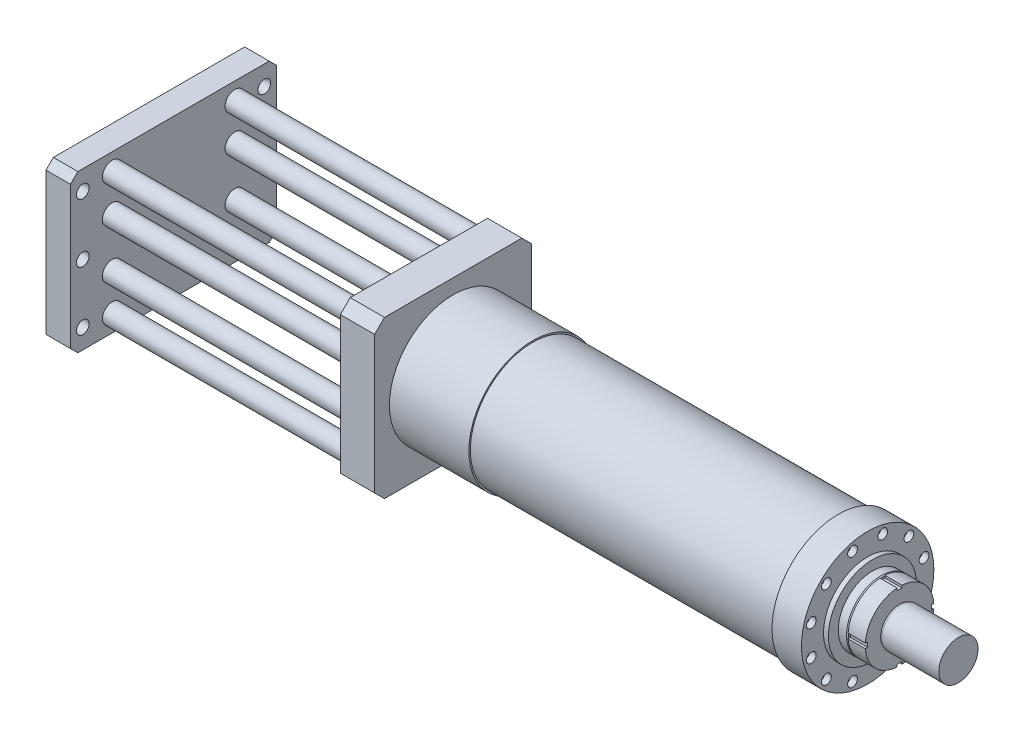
ISO-10303-21;
HEADER;
FILE_DESCRIPTION(('STEP AP214'),'2;1');
FILE_NAME('part.step','',(''),(''),'','','');
FILE_SCHEMA(('AUTOMOTIVE_DESIGN { 1 0 10303 214 1 1 1 1 }'));
ENDSEC;
DATA;
#1=APPLICATION_CONTEXT('core data for automotive mechanical design processes');
#2=APPLICATION_PROTOCOL_DEFINITION('international standard','automotive_design',2000,#1);
#3=PRODUCT_CONTEXT('',#1,'mechanical');
#4=PRODUCT('Part','Part','',(#3));
#5=PRODUCT_RELATED_PRODUCT_CATEGORY('part','',(#4));
#6=PRODUCT_DEFINITION_FORMATION('','',#4);
#7=PRODUCT_DEFINITION_CONTEXT('part definition',#1,'design');
#8=PRODUCT_DEFINITION('design','',#6,#7);
#9=PRODUCT_DEFINITION_SHAPE('','',#8);
#10=(LENGTH_UNIT() NAMED_UNIT(*) SI_UNIT(.MILLI.,.METRE.));
#11=(NAMED_UNIT(*) PLANE_ANGLE_UNIT() SI_UNIT($,.RADIAN.));
#12=(NAMED_UNIT(*) SI_UNIT($,.STERADIAN.) SOLID_ANGLE_UNIT());
#13=UNCERTAINTY_MEASURE_WITH_UNIT(LENGTH_MEASURE(1.E-05),#10,'distance_accuracy_value','');
#14=(GEOMETRIC_REPRESENTATION_CONTEXT(3) GLOBAL_UNCERTAINTY_ASSIGNED_CONTEXT((#13)) GLOBAL_UNIT_ASSIGNED_CONTEXT((#10,
#11,#12)) REPRESENTATION_CONTEXT('',''));
#15=CARTESIAN_POINT('',(0.,0.,0.));
#16=DIRECTION('',(0.,0.,1.));
#17=DIRECTION('',(1.,0.,0.));
#18=AXIS2_PLACEMENT_3D('',#15,#16,#17);
#19=CARTESIAN_POINT('',(-782.,0.,0.));
#20=DIRECTION('',(-1.,0.,0.));
#21=DIRECTION('',(0.,0.,1.));
#22=AXIS2_PLACEMENT_3D('',#19,#20,#21);
#23=PLANE('',#22);
#24=CARTESIAN_POINT('',(-782.,0.,185.));
#25=DIRECTION('',(-1.,0.,0.));
#26=DIRECTION('',(0.,0.,-1.));
#27=AXIS2_PLACEMENT_3D('',#24,#25,#26);
#28=CIRCLE('',#27,13.);
#29=CARTESIAN_POINT('',(-782.,0.,172.));
#30=VERTEX_POINT('',#29);
#31=EDGE_CURVE('E210',#30,#30,#28,.T.);
#32=ORIENTED_EDGE('',*,*,#31,.F.);
#33=EDGE_LOOP('',(#32));
#34=FACE_BOUND('',#33,.T.);
#35=CARTESIAN_POINT('',(-782.,-120.,-185.));
#36=DIRECTION('',(-1.,0.,0.));
#37=DIRECTION('',(0.,0.,1.));
#38=AXIS2_PLACEMENT_3D('',#35,#36,#37);
#39=CIRCLE('',#38,13.);
#40=CARTESIAN_POINT('',(-782.,-120.,-172.));
#41=VERTEX_POINT('',#40);
#42=EDGE_CURVE('E198',#41,#41,#39,.T.);
#43=ORIENTED_EDGE('',*,*,#42,.F.);
#44=EDGE_LOOP('',(#43));
#45=FACE_BOUND('',#44,.T.);
#46=CARTESIAN_POINT('',(-782.,120.,-185.));
#47=DIRECTION('',(-1.,0.,0.));
#48=DIRECTION('',(0.,0.,1.));
#49=AXIS2_PLACEMENT_3D('',#46,#47,#48);
#50=CIRCLE('',#49,13.);
#51=CARTESIAN_POINT('',(-782.,120.,-172.));
#52=VERTEX_POINT('',#51);
#53=EDGE_CURVE('E182',#52,#52,#50,.T.);
#54=ORIENTED_EDGE('',*,*,#53,.F.);
#55=EDGE_LOOP('',(#54));
#56=FACE_BOUND('',#55,.T.);
#57=DIRECTION('',(0.,-1.,0.));
#58=VECTOR('',#57,1.);
#59=CARTESIAN_POINT('',(-782.,160.,-210.));
#60=LINE('',#59,#58);
#61=CARTESIAN_POINT('',(-782.,145.,-210.));
#62=VERTEX_POINT('',#61);
#63=CARTESIAN_POINT('',(-782.,-145.,-210.));
#64=VERTEX_POINT('',#63);
#65=EDGE_CURVE('E186',#62,#64,#60,.T.);
#66=ORIENTED_EDGE('',*,*,#65,.T.);
#67=DIRECTION('',(0.,0.707106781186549,-0.707106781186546));
#68=VECTOR('',#67,1.);
#69=CARTESIAN_POINT('',(-782.,-177.5,-177.5));
#70=LINE('',#69,#68);
#71=CARTESIAN_POINT('',(-782.,-160.,-195.));
#72=VERTEX_POINT('',#71);
#73=EDGE_CURVE('E163',#64,#72,#70,.F.);
#74=ORIENTED_EDGE('',*,*,#73,.T.);
#75=DIRECTION('',(0.,0.,1.));
#76=VECTOR('',#75,1.);
#77=CARTESIAN_POINT('',(-782.,-160.,-210.));
#78=LINE('',#77,#76);
#79=CARTESIAN_POINT('',(-782.,-160.,195.));
#80=VERTEX_POINT('',#79);
#81=EDGE_CURVE('E134',#72,#80,#78,.T.);
#82=ORIENTED_EDGE('',*,*,#81,.T.);
#83=DIRECTION('',(0.,-0.707106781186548,-0.707106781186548));
#84=VECTOR('',#83,1.);
#85=CARTESIAN_POINT('',(-782.,-177.5,177.5));
#86=LINE('',#85,#84);
#87=CARTESIAN_POINT('',(-782.,-145.,210.));
#88=VERTEX_POINT('',#87);
#89=EDGE_CURVE('E159',#80,#88,#86,.F.);
#90=ORIENTED_EDGE('',*,*,#89,.T.);
#91=DIRECTION('',(0.,1.,0.));
#92=VECTOR('',#91,1.);
#93=CARTESIAN_POINT('',(-782.,160.,210.));
#94=LINE('',#93,#92);
#95=CARTESIAN_POINT('',(-782.,145.,210.));
#96=VERTEX_POINT('',#95);
#97=EDGE_CURVE('E142',#88,#96,#94,.T.);
#98=ORIENTED_EDGE('',*,*,#97,.T.);
#99=DIRECTION('',(0.,-0.707106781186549,0.707106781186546));
#100=VECTOR('',#99,1.);
#101=CARTESIAN_POINT('',(-782.,177.5,177.5));
#102=LINE('',#101,#100);
#103=CARTESIAN_POINT('',(-782.,160.,195.));
#104=VERTEX_POINT('',#103);
#105=EDGE_CURVE('E69',#96,#104,#102,.F.);
#106=ORIENTED_EDGE('',*,*,#105,.T.);
#107=DIRECTION('',(0.,0.,-1.));
#108=VECTOR('',#107,1.);
#109=CARTESIAN_POINT('',(-782.,160.,-210.));
#110=LINE('',#109,#108);
#111=CARTESIAN_POINT('',(-782.,160.,-195.));
#112=VERTEX_POINT('',#111);
#113=EDGE_CURVE('E145',#104,#112,#110,.T.);
#114=ORIENTED_EDGE('',*,*,#113,.T.);
#115=DIRECTION('',(0.,0.707106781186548,0.707106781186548));
#116=VECTOR('',#115,1.);
#117=CARTESIAN_POINT('',(-782.,177.5,-177.5));
#118=LINE('',#117,#116);
#119=EDGE_CURVE('E161',#112,#62,#118,.F.);
#120=ORIENTED_EDGE('',*,*,#119,.T.);
#121=EDGE_LOOP('',(#66,#74,#82,#90,#98,#106,#114,#120));
#122=FACE_BOUND('',#121,.T.);
#123=CARTESIAN_POINT('',(-782.,0.,-185.));
#124=DIRECTION('',(-1.,0.,0.));
#125=DIRECTION('',(0.,0.,1.));
#126=AXIS2_PLACEMENT_3D('',#123,#124,#125);
#127=CIRCLE('',#126,13.);
#128=CARTESIAN_POINT('',(-782.,0.,-172.));
#129=VERTEX_POINT('',#128);
#130=EDGE_CURVE('E192',#129,#129,#127,.T.);
#131=ORIENTED_EDGE('',*,*,#130,.F.);
#132=EDGE_LOOP('',(#131));
#133=FACE_BOUND('',#132,.T.);
#134=CARTESIAN_POINT('',(-782.,-120.,185.));
#135=DIRECTION('',(-1.,0.,0.));
#136=DIRECTION('',(0.,0.,-1.));
#137=AXIS2_PLACEMENT_3D('',#134,#135,#136);
#138=CIRCLE('',#137,13.);
#139=CARTESIAN_POINT('',(-782.,-120.,172.));
#140=VERTEX_POINT('',#139);
#141=EDGE_CURVE('E204',#140,#140,#138,.T.);
#142=ORIENTED_EDGE('',*,*,#141,.F.);
#143=EDGE_LOOP('',(#142));
#144=FACE_BOUND('',#143,.T.);
#145=CARTESIAN_POINT('',(-782.,120.,185.));
#146=DIRECTION('',(-1.,0.,0.));
#147=DIRECTION('',(0.,0.,-1.));
#148=AXIS2_PLACEMENT_3D('',#145,#146,#147);
#149=CIRCLE('',#148,13.);
#150=CARTESIAN_POINT('',(-782.,120.,172.));
#151=VERTEX_POINT('',#150);
#152=EDGE_CURVE('E216',#151,#151,#149,.T.);
#153=ORIENTED_EDGE('',*,*,#152,.F.);
#154=EDGE_LOOP('',(#153));
#155=FACE_BOUND('',#154,.T.);
#156=ADVANCED_FACE('F47',(#34,#45,#56,#122,#133,#144,#155),#23,.T.);
#157=CARTESIAN_POINT('',(-732.,0.,0.));
#158=DIRECTION('',(-1.,0.,0.));
#159=DIRECTION('',(0.,0.,1.));
#160=AXIS2_PLACEMENT_3D('',#157,#158,#159);
#161=PLANE('',#160);
#162=DIRECTION('',(0.,0.,1.));
#163=VECTOR('',#162,1.);
#164=CARTESIAN_POINT('',(-732.,-160.,-210.));
#165=LINE('',#164,#163);
#166=CARTESIAN_POINT('',(-732.,-160.,-195.));
#167=VERTEX_POINT('',#166);
#168=CARTESIAN_POINT('',(-732.,-160.,195.));
#169=VERTEX_POINT('',#168);
#170=EDGE_CURVE('E131',#167,#169,#165,.T.);
#171=ORIENTED_EDGE('',*,*,#170,.F.);
#172=DIRECTION('',(0.,-0.707106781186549,0.707106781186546));
#173=VECTOR('',#172,1.);
#174=CARTESIAN_POINT('',(-732.,-160.,-195.));
#175=LINE('',#174,#173);
#176=CARTESIAN_POINT('',(-732.,-145.,-210.));
#177=VERTEX_POINT('',#176);
#178=EDGE_CURVE('E114',#167,#177,#175,.F.);
#179=ORIENTED_EDGE('',*,*,#178,.T.);
#180=DIRECTION('',(0.,-1.,0.));
#181=VECTOR('',#180,1.);
#182=CARTESIAN_POINT('',(-732.,160.,-210.));
#183=LINE('',#182,#181);
#184=CARTESIAN_POINT('',(-732.,145.,-210.));
#185=VERTEX_POINT('',#184);
#186=EDGE_CURVE('E143',#185,#177,#183,.T.);
#187=ORIENTED_EDGE('',*,*,#186,.F.);
#188=DIRECTION('',(0.,-0.707106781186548,-0.707106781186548));
#189=VECTOR('',#188,1.);
#190=CARTESIAN_POINT('',(-732.,145.,-210.));
#191=LINE('',#190,#189);
#192=CARTESIAN_POINT('',(-732.,160.,-195.));
#193=VERTEX_POINT('',#192);
#194=EDGE_CURVE('E125',#185,#193,#191,.F.);
#195=ORIENTED_EDGE('',*,*,#194,.T.);
#196=DIRECTION('',(0.,0.,-1.));
#197=VECTOR('',#196,1.);
#198=CARTESIAN_POINT('',(-732.,160.,-210.));
#199=LINE('',#198,#197);
#200=CARTESIAN_POINT('',(-732.,160.,195.));
#201=VERTEX_POINT('',#200);
#202=EDGE_CURVE('E147',#201,#193,#199,.T.);
#203=ORIENTED_EDGE('',*,*,#202,.F.);
#204=DIRECTION('',(0.,0.707106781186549,-0.707106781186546));
#205=VECTOR('',#204,1.);
#206=CARTESIAN_POINT('',(-732.,160.,195.));
#207=LINE('',#206,#205);
#208=CARTESIAN_POINT('',(-732.,145.,210.));
#209=VERTEX_POINT('',#208);
#210=EDGE_CURVE('E135',#201,#209,#207,.F.);
#211=ORIENTED_EDGE('',*,*,#210,.T.);
#212=DIRECTION('',(0.,1.,0.));
#213=VECTOR('',#212,1.);
#214=CARTESIAN_POINT('',(-732.,160.,210.));
#215=LINE('',#214,#213);
#216=CARTESIAN_POINT('',(-732.,-145.,210.));
#217=VERTEX_POINT('',#216);
#218=EDGE_CURVE('E174',#217,#209,#215,.T.);
#219=ORIENTED_EDGE('',*,*,#218,.F.);
#220=DIRECTION('',(0.,0.707106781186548,0.707106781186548));
#221=VECTOR('',#220,1.);
#222=CARTESIAN_POINT('',(-732.,-145.,210.));
#223=LINE('',#222,#221);
#224=EDGE_CURVE('E141',#217,#169,#223,.F.);
#225=ORIENTED_EDGE('',*,*,#224,.T.);
#226=EDGE_LOOP('',(#171,#179,#187,#195,#203,#211,#219,#225));
#227=FACE_BOUND('',#226,.T.);
#228=CARTESIAN_POINT('',(-732.,120.,-185.));
#229=DIRECTION('',(-1.,0.,0.));
#230=DIRECTION('',(0.,0.,1.));
#231=AXIS2_PLACEMENT_3D('',#228,#229,#230);
#232=CIRCLE('',#231,13.);
#233=CARTESIAN_POINT('',(-732.,120.,-172.));
#234=VERTEX_POINT('',#233);
#235=EDGE_CURVE('E189',#234,#234,#232,.T.);
#236=ORIENTED_EDGE('',*,*,#235,.T.);
#237=EDGE_LOOP('',(#236));
#238=FACE_BOUND('',#237,.T.);
#239=CARTESIAN_POINT('',(-732.,0.,-185.));
#240=DIRECTION('',(-1.,0.,0.));
#241=DIRECTION('',(0.,0.,1.));
#242=AXIS2_PLACEMENT_3D('',#239,#240,#241);
#243=CIRCLE('',#242,13.);
#244=CARTESIAN_POINT('',(-732.,0.,-172.));
#245=VERTEX_POINT('',#244);
#246=EDGE_CURVE('E195',#245,#245,#243,.T.);
#247=ORIENTED_EDGE('',*,*,#246,.T.);
#248=EDGE_LOOP('',(#247));
#249=FACE_BOUND('',#248,.T.);
#250=CARTESIAN_POINT('',(-732.,-120.,-185.));
#251=DIRECTION('',(-1.,0.,0.));
#252=DIRECTION('',(0.,0.,1.));
#253=AXIS2_PLACEMENT_3D('',#250,#251,#252);
#254=CIRCLE('',#253,13.);
#255=CARTESIAN_POINT('',(-732.,-120.,-172.));
#256=VERTEX_POINT('',#255);
#257=EDGE_CURVE('E201',#256,#256,#254,.T.);
#258=ORIENTED_EDGE('',*,*,#257,.T.);
#259=EDGE_LOOP('',(#258));
#260=FACE_BOUND('',#259,.T.);
#261=CARTESIAN_POINT('',(-732.,-120.,185.));
#262=DIRECTION('',(-1.,0.,0.));
#263=DIRECTION('',(0.,0.,-1.));
#264=AXIS2_PLACEMENT_3D('',#261,#262,#263);
#265=CIRCLE('',#264,13.);
#266=CARTESIAN_POINT('',(-732.,-120.,172.));
#267=VERTEX_POINT('',#266);
#268=EDGE_CURVE('E207',#267,#267,#265,.T.);
#269=ORIENTED_EDGE('',*,*,#268,.T.);
#270=EDGE_LOOP('',(#269));
#271=FACE_BOUND('',#270,.T.);
#272=CARTESIAN_POINT('',(-732.,0.,185.));
#273=DIRECTION('',(-1.,0.,0.));
#274=DIRECTION('',(0.,0.,-1.));
#275=AXIS2_PLACEMENT_3D('',#272,#273,#274);
#276=CIRCLE('',#275,13.);
#277=CARTESIAN_POINT('',(-732.,0.,172.));
#278=VERTEX_POINT('',#277);
#279=EDGE_CURVE('E213',#278,#278,#276,.T.);
#280=ORIENTED_EDGE('',*,*,#279,.T.);
#281=EDGE_LOOP('',(#280));
#282=FACE_BOUND('',#281,.T.);
#283=CARTESIAN_POINT('',(-732.,120.,185.));
#284=DIRECTION('',(-1.,0.,0.));
#285=DIRECTION('',(0.,0.,-1.));
#286=AXIS2_PLACEMENT_3D('',#283,#284,#285);
#287=CIRCLE('',#286,13.);
#288=CARTESIAN_POINT('',(-732.,120.,172.));
#289=VERTEX_POINT('',#288);
#290=EDGE_CURVE('E219',#289,#289,#287,.T.);
#291=ORIENTED_EDGE('',*,*,#290,.T.);
#292=EDGE_LOOP('',(#291));
#293=FACE_BOUND('',#292,.T.);
#294=ADVANCED_FACE('F138',(#227,#238,#249,#260,#271,#282,#293),#161,.F.);
#295=CARTESIAN_POINT('',(-782.,160.,210.));
#296=DIRECTION('',(0.,0.,-1.));
#297=DIRECTION('',(0.,1.,0.));
#298=AXIS2_PLACEMENT_3D('',#295,#296,#297);
#299=PLANE('',#298);
#300=ORIENTED_EDGE('',*,*,#97,.F.);
#301=DIRECTION('',(1.,0.,0.));
#302=VECTOR('',#301,1.);
#303=CARTESIAN_POINT('',(-782.,-145.,210.));
#304=LINE('',#303,#302);
#305=EDGE_CURVE('E12',#88,#217,#304,.T.);
#306=ORIENTED_EDGE('',*,*,#305,.T.);
#307=ORIENTED_EDGE('',*,*,#218,.T.);
#308=DIRECTION('',(-1.,0.,0.));
#309=VECTOR('',#308,1.);
#310=CARTESIAN_POINT('',(-782.,145.,210.));
#311=LINE('',#310,#309);
#312=EDGE_CURVE('E55',#209,#96,#311,.T.);
#313=ORIENTED_EDGE('',*,*,#312,.T.);
#314=EDGE_LOOP('',(#300,#306,#307,#313));
#315=FACE_BOUND('',#314,.T.);
#316=ADVANCED_FACE('F172',(#315),#299,.F.);
#317=CARTESIAN_POINT('',(-782.,160.,-210.));
#318=DIRECTION('',(0.,-1.,0.));
#319=DIRECTION('',(0.,0.,-1.));
#320=AXIS2_PLACEMENT_3D('',#317,#318,#319);
#321=PLANE('',#320);
#322=ORIENTED_EDGE('',*,*,#202,.T.);
#323=DIRECTION('',(-1.,0.,0.));
#324=VECTOR('',#323,1.);
#325=CARTESIAN_POINT('',(-782.,160.,-195.));
#326=LINE('',#325,#324);
#327=EDGE_CURVE('E62',#193,#112,#326,.T.);
#328=ORIENTED_EDGE('',*,*,#327,.T.);
#329=ORIENTED_EDGE('',*,*,#113,.F.);
#330=DIRECTION('',(1.,0.,0.));
#331=VECTOR('',#330,1.);
#332=CARTESIAN_POINT('',(-782.,160.,195.));
#333=LINE('',#332,#331);
#334=EDGE_CURVE('E165',#104,#201,#333,.T.);
#335=ORIENTED_EDGE('',*,*,#334,.T.);
#336=EDGE_LOOP('',(#322,#328,#329,#335));
#337=FACE_BOUND('',#336,.T.);
#338=ADVANCED_FACE('F181',(#337),#321,.F.);
#339=CARTESIAN_POINT('',(-782.,160.,-210.));
#340=DIRECTION('',(0.,0.,1.));
#341=DIRECTION('',(0.,-1.,0.));
#342=AXIS2_PLACEMENT_3D('',#339,#340,#341);
#343=PLANE('',#342);
#344=ORIENTED_EDGE('',*,*,#186,.T.);
#345=DIRECTION('',(-1.,0.,0.));
#346=VECTOR('',#345,1.);
#347=CARTESIAN_POINT('',(-782.,-145.,-210.));
#348=LINE('',#347,#346);
#349=EDGE_CURVE('E119',#177,#64,#348,.T.);
#350=ORIENTED_EDGE('',*,*,#349,.T.);
#351=ORIENTED_EDGE('',*,*,#65,.F.);
#352=DIRECTION('',(1.,0.,0.));
#353=VECTOR('',#352,1.);
#354=CARTESIAN_POINT('',(-782.,145.,-210.));
#355=LINE('',#354,#353);
#356=EDGE_CURVE('E124',#62,#185,#355,.T.);
#357=ORIENTED_EDGE('',*,*,#356,.T.);
#358=EDGE_LOOP('',(#344,#350,#351,#357));
#359=FACE_BOUND('',#358,.T.);
#360=ADVANCED_FACE('F243',(#359),#343,.F.);
#361=CARTESIAN_POINT('',(-782.,-160.,-210.));
#362=DIRECTION('',(0.,1.,0.));
#363=DIRECTION('',(0.,0.,1.));
#364=AXIS2_PLACEMENT_3D('',#361,#362,#363);
#365=PLANE('',#364);
#366=ORIENTED_EDGE('',*,*,#81,.F.);
#367=DIRECTION('',(1.,0.,0.));
#368=VECTOR('',#367,1.);
#369=CARTESIAN_POINT('',(-782.,-160.,-195.));
#370=LINE('',#369,#368);
#371=EDGE_CURVE('E118',#72,#167,#370,.T.);
#372=ORIENTED_EDGE('',*,*,#371,.T.);
#373=ORIENTED_EDGE('',*,*,#170,.T.);
#374=DIRECTION('',(-1.,0.,0.));
#375=VECTOR('',#374,1.);
#376=CARTESIAN_POINT('',(-782.,-160.,195.));
#377=LINE('',#376,#375);
#378=EDGE_CURVE('E136',#169,#80,#377,.T.);
#379=ORIENTED_EDGE('',*,*,#378,.T.);
#380=EDGE_LOOP('',(#366,#372,#373,#379));
#381=FACE_BOUND('',#380,.T.);
#382=ADVANCED_FACE('F130',(#381),#365,.F.);
#383=CARTESIAN_POINT('',(-782.,120.,-185.));
#384=DIRECTION('',(1.,0.,0.));
#385=DIRECTION('',(0.,0.,-1.));
#386=AXIS2_PLACEMENT_3D('',#383,#384,#385);
#387=CYLINDRICAL_SURFACE('',#386,13.);
#388=ORIENTED_EDGE('',*,*,#53,.T.);
#389=EDGE_LOOP('',(#388));
#390=FACE_BOUND('',#389,.T.);
#391=ORIENTED_EDGE('',*,*,#235,.F.);
#392=EDGE_LOOP('',(#391));
#393=FACE_BOUND('',#392,.T.);
#394=ADVANCED_FACE('F238',(#390,#393),#387,.F.);
#395=CARTESIAN_POINT('',(-782.,0.,-185.));
#396=DIRECTION('',(1.,0.,0.));
#397=DIRECTION('',(0.,0.,-1.));
#398=AXIS2_PLACEMENT_3D('',#395,#396,#397);
#399=CYLINDRICAL_SURFACE('',#398,13.);
#400=ORIENTED_EDGE('',*,*,#130,.T.);
#401=EDGE_LOOP('',(#400));
#402=FACE_BOUND('',#401,.T.);
#403=ORIENTED_EDGE('',*,*,#246,.F.);
#404=EDGE_LOOP('',(#403));
#405=FACE_BOUND('',#404,.T.);
#406=ADVANCED_FACE('F357',(#402,#405),#399,.F.);
#407=CARTESIAN_POINT('',(-782.,-120.,-185.));
#408=DIRECTION('',(1.,0.,0.));
#409=DIRECTION('',(0.,0.,-1.));
#410=AXIS2_PLACEMENT_3D('',#407,#408,#409);
#411=CYLINDRICAL_SURFACE('',#410,13.);
#412=ORIENTED_EDGE('',*,*,#42,.T.);
#413=EDGE_LOOP('',(#412));
#414=FACE_BOUND('',#413,.T.);
#415=ORIENTED_EDGE('',*,*,#257,.F.);
#416=EDGE_LOOP('',(#415));
#417=FACE_BOUND('',#416,.T.);
#418=ADVANCED_FACE('F347',(#414,#417),#411,.F.);
#419=CARTESIAN_POINT('',(-782.,-120.,185.));
#420=DIRECTION('',(1.,0.,0.));
#421=DIRECTION('',(0.,0.,-1.));
#422=AXIS2_PLACEMENT_3D('',#419,#420,#421);
#423=CYLINDRICAL_SURFACE('',#422,13.);
#424=ORIENTED_EDGE('',*,*,#141,.T.);
#425=EDGE_LOOP('',(#424));
#426=FACE_BOUND('',#425,.T.);
#427=ORIENTED_EDGE('',*,*,#268,.F.);
#428=EDGE_LOOP('',(#427));
#429=FACE_BOUND('',#428,.T.);
#430=ADVANCED_FACE('F337',(#426,#429),#423,.F.);
#431=CARTESIAN_POINT('',(-782.,0.,185.));
#432=DIRECTION('',(1.,0.,0.));
#433=DIRECTION('',(0.,0.,-1.));
#434=AXIS2_PLACEMENT_3D('',#431,#432,#433);
#435=CYLINDRICAL_SURFACE('',#434,13.);
#436=ORIENTED_EDGE('',*,*,#31,.T.);
#437=EDGE_LOOP('',(#436));
#438=FACE_BOUND('',#437,.T.);
#439=ORIENTED_EDGE('',*,*,#279,.F.);
#440=EDGE_LOOP('',(#439));
#441=FACE_BOUND('',#440,.T.);
#442=ADVANCED_FACE('F328',(#438,#441),#435,.F.);
#443=CARTESIAN_POINT('',(-782.,120.,185.));
#444=DIRECTION('',(1.,0.,0.));
#445=DIRECTION('',(0.,0.,-1.));
#446=AXIS2_PLACEMENT_3D('',#443,#444,#445);
#447=CYLINDRICAL_SURFACE('',#446,13.);
#448=ORIENTED_EDGE('',*,*,#152,.T.);
#449=EDGE_LOOP('',(#448));
#450=FACE_BOUND('',#449,.T.);
#451=ORIENTED_EDGE('',*,*,#290,.F.);
#452=EDGE_LOOP('',(#451));
#453=FACE_BOUND('',#452,.T.);
#454=ADVANCED_FACE('F225',(#450,#453),#447,.F.);
#455=CARTESIAN_POINT('',(-782.,-160.,-195.));
#456=DIRECTION('',(0.,0.707106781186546,0.707106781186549));
#457=DIRECTION('',(1.,0.,0.));
#458=AXIS2_PLACEMENT_3D('',#455,#456,#457);
#459=PLANE('',#458);
#460=ORIENTED_EDGE('',*,*,#73,.F.);
#461=ORIENTED_EDGE('',*,*,#349,.F.);
#462=ORIENTED_EDGE('',*,*,#178,.F.);
#463=ORIENTED_EDGE('',*,*,#371,.F.);
#464=EDGE_LOOP('',(#460,#461,#462,#463));
#465=FACE_BOUND('',#464,.T.);
#466=ADVANCED_FACE('F117',(#465),#459,.F.);
#467=CARTESIAN_POINT('',(-782.,145.,-210.));
#468=DIRECTION('',(0.,-0.707106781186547,0.707106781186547));
#469=DIRECTION('',(1.,0.,0.));
#470=AXIS2_PLACEMENT_3D('',#467,#468,#469);
#471=PLANE('',#470);
#472=ORIENTED_EDGE('',*,*,#119,.F.);
#473=ORIENTED_EDGE('',*,*,#327,.F.);
#474=ORIENTED_EDGE('',*,*,#194,.F.);
#475=ORIENTED_EDGE('',*,*,#356,.F.);
#476=EDGE_LOOP('',(#472,#473,#474,#475));
#477=FACE_BOUND('',#476,.T.);
#478=ADVANCED_FACE('F253',(#477),#471,.F.);
#479=CARTESIAN_POINT('',(-782.,-145.,210.));
#480=DIRECTION('',(0.,0.707106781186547,-0.707106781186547));
#481=DIRECTION('',(1.,0.,0.));
#482=AXIS2_PLACEMENT_3D('',#479,#480,#481);
#483=PLANE('',#482);
#484=ORIENTED_EDGE('',*,*,#89,.F.);
#485=ORIENTED_EDGE('',*,*,#378,.F.);
#486=ORIENTED_EDGE('',*,*,#224,.F.);
#487=ORIENTED_EDGE('',*,*,#305,.F.);
#488=EDGE_LOOP('',(#484,#485,#486,#487));
#489=FACE_BOUND('',#488,.T.);
#490=ADVANCED_FACE('F255',(#489),#483,.F.);
#491=CARTESIAN_POINT('',(-782.,160.,195.));
#492=DIRECTION('',(0.,-0.707106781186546,-0.707106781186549));
#493=DIRECTION('',(1.,0.,0.));
#494=AXIS2_PLACEMENT_3D('',#491,#492,#493);
#495=PLANE('',#494);
#496=ORIENTED_EDGE('',*,*,#105,.F.);
#497=ORIENTED_EDGE('',*,*,#312,.F.);
#498=ORIENTED_EDGE('',*,*,#210,.F.);
#499=ORIENTED_EDGE('',*,*,#334,.F.);
#500=EDGE_LOOP('',(#496,#497,#498,#499));
#501=FACE_BOUND('',#500,.T.);
#502=ADVANCED_FACE('F49',(#501),#495,.F.);
#503=CLOSED_SHELL('',(#156,#294,#316,#338,#360,#382,#394,#406,#418,#430,#442,#454,#466,#478,
#490,#502));
#504=MANIFOLD_SOLID_BREP('B2',#503);
#505=CARTESIAN_POINT('',(-232.,160.,160.));
#506=DIRECTION('',(0.,0.,-1.));
#507=DIRECTION('',(0.,1.,0.));
#508=AXIS2_PLACEMENT_3D('',#505,#506,#507);
#509=PLANE('',#508);
#510=DIRECTION('',(0.,1.,0.));
#511=VECTOR('',#510,1.);
#512=CARTESIAN_POINT('',(-232.,160.,160.));
#513=LINE('',#512,#511);
#514=CARTESIAN_POINT('',(-232.,-140.,160.));
#515=VERTEX_POINT('',#514);
#516=CARTESIAN_POINT('',(-232.,140.,160.));
#517=VERTEX_POINT('',#516);
#518=EDGE_CURVE('E503',#515,#517,#513,.T.);
#519=ORIENTED_EDGE('',*,*,#518,.F.);
#520=DIRECTION('',(1.,0.,0.));
#521=VECTOR('',#520,1.);
#522=CARTESIAN_POINT('',(-232.,-140.,160.));
#523=LINE('',#522,#521);
#524=CARTESIAN_POINT('',(-162.,-140.,160.));
#525=VERTEX_POINT('',#524);
#526=EDGE_CURVE('E45',#515,#525,#523,.T.);
#527=ORIENTED_EDGE('',*,*,#526,.T.);
#528=DIRECTION('',(0.,1.,0.));
#529=VECTOR('',#528,1.);
#530=CARTESIAN_POINT('',(-162.,160.,160.));
#531=LINE('',#530,#529);
#532=CARTESIAN_POINT('',(-162.,140.,160.));
#533=VERTEX_POINT('',#532);
#534=EDGE_CURVE('E505',#525,#533,#531,.T.);
#535=ORIENTED_EDGE('',*,*,#534,.T.);
#536=DIRECTION('',(-1.,0.,0.));
#537=VECTOR('',#536,1.);
#538=CARTESIAN_POINT('',(-232.,140.,160.));
#539=LINE('',#538,#537);
#540=EDGE_CURVE('E416',#533,#517,#539,.T.);
#541=ORIENTED_EDGE('',*,*,#540,.T.);
#542=EDGE_LOOP('',(#519,#527,#535,#541));
#543=FACE_BOUND('',#542,.T.);
#544=ADVANCED_FACE('F408',(#543),#509,.F.);
#545=CARTESIAN_POINT('',(-232.,160.,-160.));
#546=DIRECTION('',(0.,-1.,0.));
#547=DIRECTION('',(0.,0.,-1.));
#548=AXIS2_PLACEMENT_3D('',#545,#546,#547);
#549=PLANE('',#548);
#550=DIRECTION('',(0.,0.,-1.));
#551=VECTOR('',#550,1.);
#552=CARTESIAN_POINT('',(-162.,160.,-160.));
#553=LINE('',#552,#551);
#554=CARTESIAN_POINT('',(-162.,160.,140.));
#555=VERTEX_POINT('',#554);
#556=CARTESIAN_POINT('',(-162.,160.,-140.));
#557=VERTEX_POINT('',#556);
#558=EDGE_CURVE('E501',#555,#557,#553,.T.);
#559=ORIENTED_EDGE('',*,*,#558,.T.);
#560=DIRECTION('',(-1.,0.,0.));
#561=VECTOR('',#560,1.);
#562=CARTESIAN_POINT('',(-232.,160.,-140.));
#563=LINE('',#562,#561);
#564=CARTESIAN_POINT('',(-232.,160.,-140.));
#565=VERTEX_POINT('',#564);
#566=EDGE_CURVE('E480',#557,#565,#563,.T.);
#567=ORIENTED_EDGE('',*,*,#566,.T.);
#568=DIRECTION('',(0.,0.,-1.));
#569=VECTOR('',#568,1.);
#570=CARTESIAN_POINT('',(-232.,160.,-160.));
#571=LINE('',#570,#569);
#572=CARTESIAN_POINT('',(-232.,160.,140.));
#573=VERTEX_POINT('',#572);
#574=EDGE_CURVE('E541',#573,#565,#571,.T.);
#575=ORIENTED_EDGE('',*,*,#574,.F.);
#576=DIRECTION('',(1.,0.,0.));
#577=VECTOR('',#576,1.);
#578=CARTESIAN_POINT('',(-232.,160.,140.));
#579=LINE('',#578,#577);
#580=EDGE_CURVE('E485',#573,#555,#579,.T.);
#581=ORIENTED_EDGE('',*,*,#580,.T.);
#582=EDGE_LOOP('',(#559,#567,#575,#581));
#583=FACE_BOUND('',#582,.T.);
#584=ADVANCED_FACE('F545',(#583),#549,.F.);
#585=CARTESIAN_POINT('',(-232.,160.,-160.));
#586=DIRECTION('',(0.,0.,1.));
#587=DIRECTION('',(0.,-1.,0.));
#588=AXIS2_PLACEMENT_3D('',#585,#586,#587);
#589=PLANE('',#588);
#590=DIRECTION('',(0.,-1.,0.));
#591=VECTOR('',#590,1.);
#592=CARTESIAN_POINT('',(-232.,160.,-160.));
#593=LINE('',#592,#591);
#594=CARTESIAN_POINT('',(-232.,140.,-160.));
#595=VERTEX_POINT('',#594);
#596=CARTESIAN_POINT('',(-232.,-140.,-160.));
#597=VERTEX_POINT('',#596);
#598=EDGE_CURVE('E494',#595,#597,#593,.T.);
#599=ORIENTED_EDGE('',*,*,#598,.F.);
#600=DIRECTION('',(1.,0.,0.));
#601=VECTOR('',#600,1.);
#602=CARTESIAN_POINT('',(-232.,140.,-160.));
#603=LINE('',#602,#601);
#604=CARTESIAN_POINT('',(-162.,140.,-160.));
#605=VERTEX_POINT('',#604);
#606=EDGE_CURVE('E479',#595,#605,#603,.T.);
#607=ORIENTED_EDGE('',*,*,#606,.T.);
#608=DIRECTION('',(0.,-1.,0.));
#609=VECTOR('',#608,1.);
#610=CARTESIAN_POINT('',(-162.,160.,-160.));
#611=LINE('',#610,#609);
#612=CARTESIAN_POINT('',(-162.,-140.,-160.));
#613=VERTEX_POINT('',#612);
#614=EDGE_CURVE('E492',#605,#613,#611,.T.);
#615=ORIENTED_EDGE('',*,*,#614,.T.);
#616=DIRECTION('',(-1.,0.,0.));
#617=VECTOR('',#616,1.);
#618=CARTESIAN_POINT('',(-232.,-140.,-160.));
#619=LINE('',#618,#617);
#620=EDGE_CURVE('E496',#613,#597,#619,.T.);
#621=ORIENTED_EDGE('',*,*,#620,.T.);
#622=EDGE_LOOP('',(#599,#607,#615,#621));
#623=FACE_BOUND('',#622,.T.);
#624=ADVANCED_FACE('F491',(#623),#589,.F.);
#625=CARTESIAN_POINT('',(-232.,-160.,-160.));
#626=DIRECTION('',(0.,1.,0.));
#627=DIRECTION('',(0.,0.,1.));
#628=AXIS2_PLACEMENT_3D('',#625,#626,#627);
#629=PLANE('',#628);
#630=DIRECTION('',(0.,0.,1.));
#631=VECTOR('',#630,1.);
#632=CARTESIAN_POINT('',(-232.,-160.,-160.));
#633=LINE('',#632,#631);
#634=CARTESIAN_POINT('',(-232.,-160.,-140.));
#635=VERTEX_POINT('',#634);
#636=CARTESIAN_POINT('',(-232.,-160.,140.));
#637=VERTEX_POINT('',#636);
#638=EDGE_CURVE('E509',#635,#637,#633,.T.);
#639=ORIENTED_EDGE('',*,*,#638,.F.);
#640=DIRECTION('',(1.,0.,0.));
#641=VECTOR('',#640,1.);
#642=CARTESIAN_POINT('',(-232.,-160.,-140.));
#643=LINE('',#642,#641);
#644=CARTESIAN_POINT('',(-162.,-160.,-140.));
#645=VERTEX_POINT('',#644);
#646=EDGE_CURVE('E526',#635,#645,#643,.T.);
#647=ORIENTED_EDGE('',*,*,#646,.T.);
#648=DIRECTION('',(0.,0.,1.));
#649=VECTOR('',#648,1.);
#650=CARTESIAN_POINT('',(-162.,-160.,-160.));
#651=LINE('',#650,#649);
#652=CARTESIAN_POINT('',(-162.,-160.,140.));
#653=VERTEX_POINT('',#652);
#654=EDGE_CURVE('E500',#645,#653,#651,.T.);
#655=ORIENTED_EDGE('',*,*,#654,.T.);
#656=DIRECTION('',(-1.,0.,0.));
#657=VECTOR('',#656,1.);
#658=CARTESIAN_POINT('',(-232.,-160.,140.));
#659=LINE('',#658,#657);
#660=EDGE_CURVE('E423',#653,#637,#659,.T.);
#661=ORIENTED_EDGE('',*,*,#660,.T.);
#662=EDGE_LOOP('',(#639,#647,#655,#661));
#663=FACE_BOUND('',#662,.T.);
#664=ADVANCED_FACE('F622',(#663),#629,.F.);
#665=CARTESIAN_POINT('',(-232.,0.,0.));
#666=DIRECTION('',(-1.,0.,0.));
#667=DIRECTION('',(0.,0.,1.));
#668=AXIS2_PLACEMENT_3D('',#665,#666,#667);
#669=PLANE('',#668);
#670=CARTESIAN_POINT('',(-232.,-50.,125.));
#671=DIRECTION('',(-1.,0.,0.));
#672=DIRECTION('',(0.,0.,1.));
#673=AXIS2_PLACEMENT_3D('',#670,#671,#672);
#674=CIRCLE('',#673,20.);
#675=CARTESIAN_POINT('',(-232.,-50.,145.));
#676=VERTEX_POINT('',#675);
#677=EDGE_CURVE('E605',#676,#676,#674,.T.);
#678=ORIENTED_EDGE('',*,*,#677,.F.);
#679=EDGE_LOOP('',(#678));
#680=FACE_BOUND('',#679,.T.);
#681=CARTESIAN_POINT('',(-232.,50.,125.));
#682=DIRECTION('',(-1.,0.,0.));
#683=DIRECTION('',(0.,0.,1.));
#684=AXIS2_PLACEMENT_3D('',#681,#682,#683);
#685=CIRCLE('',#684,20.);
#686=CARTESIAN_POINT('',(-232.,50.,145.));
#687=VERTEX_POINT('',#686);
#688=EDGE_CURVE('E599',#687,#687,#685,.T.);
#689=ORIENTED_EDGE('',*,*,#688,.F.);
#690=EDGE_LOOP('',(#689));
#691=FACE_BOUND('',#690,.T.);
#692=CARTESIAN_POINT('',(-232.,-50.,-125.));
#693=DIRECTION('',(-1.,0.,0.));
#694=DIRECTION('',(0.,0.,1.));
#695=AXIS2_PLACEMENT_3D('',#692,#693,#694);
#696=CIRCLE('',#695,20.);
#697=CARTESIAN_POINT('',(-232.,-50.,-105.));
#698=VERTEX_POINT('',#697);
#699=EDGE_CURVE('E593',#698,#698,#696,.T.);
#700=ORIENTED_EDGE('',*,*,#699,.F.);
#701=EDGE_LOOP('',(#700));
#702=FACE_BOUND('',#701,.T.);
#703=CARTESIAN_POINT('',(-232.,50.,-125.));
#704=DIRECTION('',(-1.,0.,0.));
#705=DIRECTION('',(0.,0.,1.));
#706=AXIS2_PLACEMENT_3D('',#703,#704,#705);
#707=CIRCLE('',#706,20.);
#708=CARTESIAN_POINT('',(-232.,50.,-105.));
#709=VERTEX_POINT('',#708);
#710=EDGE_CURVE('E587',#709,#709,#707,.T.);
#711=ORIENTED_EDGE('',*,*,#710,.F.);
#712=EDGE_LOOP('',(#711));
#713=FACE_BOUND('',#712,.T.);
#714=CARTESIAN_POINT('',(-232.,125.,-125.));
#715=DIRECTION('',(-1.,0.,0.));
#716=DIRECTION('',(0.,0.,-1.));
#717=AXIS2_PLACEMENT_3D('',#714,#715,#716);
#718=CIRCLE('',#717,20.);
#719=CARTESIAN_POINT('',(-232.,125.,-145.));
#720=VERTEX_POINT('',#719);
#721=EDGE_CURVE('E581',#720,#720,#718,.T.);
#722=ORIENTED_EDGE('',*,*,#721,.F.);
#723=EDGE_LOOP('',(#722));
#724=FACE_BOUND('',#723,.T.);
#725=CARTESIAN_POINT('',(-232.,-125.,-125.));
#726=DIRECTION('',(-1.,0.,0.));
#727=DIRECTION('',(0.,0.,-1.));
#728=AXIS2_PLACEMENT_3D('',#725,#726,#727);
#729=CIRCLE('',#728,20.);
#730=CARTESIAN_POINT('',(-232.,-125.,-145.));
#731=VERTEX_POINT('',#730);
#732=EDGE_CURVE('E575',#731,#731,#729,.T.);
#733=ORIENTED_EDGE('',*,*,#732,.F.);
#734=EDGE_LOOP('',(#733));
#735=FACE_BOUND('',#734,.T.);
#736=CARTESIAN_POINT('',(-232.,-125.,125.));
#737=DIRECTION('',(-1.,0.,0.));
#738=DIRECTION('',(0.,0.,1.));
#739=AXIS2_PLACEMENT_3D('',#736,#737,#738);
#740=CIRCLE('',#739,20.);
#741=CARTESIAN_POINT('',(-232.,-125.,145.));
#742=VERTEX_POINT('',#741);
#743=EDGE_CURVE('E569',#742,#742,#740,.T.);
#744=ORIENTED_EDGE('',*,*,#743,.F.);
#745=EDGE_LOOP('',(#744));
#746=FACE_BOUND('',#745,.T.);
#747=CARTESIAN_POINT('',(-232.,125.,125.));
#748=DIRECTION('',(-1.,0.,0.));
#749=DIRECTION('',(0.,0.,1.));
#750=AXIS2_PLACEMENT_3D('',#747,#748,#749);
#751=CIRCLE('',#750,20.);
#752=CARTESIAN_POINT('',(-232.,125.,145.));
#753=VERTEX_POINT('',#752);
#754=EDGE_CURVE('E563',#753,#753,#751,.T.);
#755=ORIENTED_EDGE('',*,*,#754,.F.);
#756=EDGE_LOOP('',(#755));
#757=FACE_BOUND('',#756,.T.);
#758=CARTESIAN_POINT('',(-232.,0.,0.));
#759=DIRECTION('',(-1.,0.,0.));
#760=DIRECTION('',(0.,0.,1.));
#761=AXIS2_PLACEMENT_3D('',#758,#759,#760);
#762=CIRCLE('',#761,80.);
#763=CARTESIAN_POINT('',(-232.,0.,80.));
#764=VERTEX_POINT('',#763);
#765=EDGE_CURVE('E546',#764,#764,#762,.T.);
#766=ORIENTED_EDGE('',*,*,#765,.F.);
#767=EDGE_LOOP('',(#766));
#768=FACE_BOUND('',#767,.T.);
#769=ORIENTED_EDGE('',*,*,#574,.T.);
#770=DIRECTION('',(0.,0.707106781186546,0.707106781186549));
#771=VECTOR('',#770,1.);
#772=CARTESIAN_POINT('',(-232.,150.,-150.));
#773=LINE('',#772,#771);
#774=EDGE_CURVE('E523',#565,#595,#773,.F.);
#775=ORIENTED_EDGE('',*,*,#774,.T.);
#776=ORIENTED_EDGE('',*,*,#598,.T.);
#777=DIRECTION('',(0.,0.707106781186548,-0.707106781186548));
#778=VECTOR('',#777,1.);
#779=CARTESIAN_POINT('',(-232.,-150.,-150.));
#780=LINE('',#779,#778);
#781=EDGE_CURVE('E430',#597,#635,#780,.F.);
#782=ORIENTED_EDGE('',*,*,#781,.T.);
#783=ORIENTED_EDGE('',*,*,#638,.T.);
#784=DIRECTION('',(0.,-0.707106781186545,-0.70710678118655));
#785=VECTOR('',#784,1.);
#786=CARTESIAN_POINT('',(-232.,-150.,149.999999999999));
#787=LINE('',#786,#785);
#788=EDGE_CURVE('E520',#637,#515,#787,.F.);
#789=ORIENTED_EDGE('',*,*,#788,.T.);
#790=ORIENTED_EDGE('',*,*,#518,.T.);
#791=DIRECTION('',(0.,-0.707106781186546,0.707106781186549));
#792=VECTOR('',#791,1.);
#793=CARTESIAN_POINT('',(-232.,150.,149.999999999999));
#794=LINE('',#793,#792);
#795=EDGE_CURVE('E518',#517,#573,#794,.F.);
#796=ORIENTED_EDGE('',*,*,#795,.T.);
#797=EDGE_LOOP('',(#769,#775,#776,#782,#783,#789,#790,#796));
#798=FACE_BOUND('',#797,.T.);
#799=ADVANCED_FACE('F538',(#680,#691,#702,#713,#724,#735,#746,#757,#768,#798),#669,.T.);
#800=CARTESIAN_POINT('',(-162.,0.,0.));
#801=DIRECTION('',(-1.,0.,0.));
#802=DIRECTION('',(0.,0.,1.));
#803=AXIS2_PLACEMENT_3D('',#800,#801,#802);
#804=PLANE('',#803);
#805=ORIENTED_EDGE('',*,*,#614,.F.);
#806=DIRECTION('',(0.,-0.707106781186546,-0.707106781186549));
#807=VECTOR('',#806,1.);
#808=CARTESIAN_POINT('',(-162.,140.,-160.));
#809=LINE('',#808,#807);
#810=EDGE_CURVE('E475',#605,#557,#809,.F.);
#811=ORIENTED_EDGE('',*,*,#810,.T.);
#812=ORIENTED_EDGE('',*,*,#558,.F.);
#813=DIRECTION('',(0.,0.707106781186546,-0.707106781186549));
#814=VECTOR('',#813,1.);
#815=CARTESIAN_POINT('',(-162.,160.,140.));
#816=LINE('',#815,#814);
#817=EDGE_CURVE('E495',#555,#533,#816,.F.);
#818=ORIENTED_EDGE('',*,*,#817,.T.);
#819=ORIENTED_EDGE('',*,*,#534,.F.);
#820=DIRECTION('',(0.,0.707106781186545,0.70710678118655));
#821=VECTOR('',#820,1.);
#822=CARTESIAN_POINT('',(-162.,-140.,160.));
#823=LINE('',#822,#821);
#824=EDGE_CURVE('E512',#525,#653,#823,.F.);
#825=ORIENTED_EDGE('',*,*,#824,.T.);
#826=ORIENTED_EDGE('',*,*,#654,.F.);
#827=DIRECTION('',(0.,-0.707106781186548,0.707106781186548));
#828=VECTOR('',#827,1.);
#829=CARTESIAN_POINT('',(-162.,-160.,-140.));
#830=LINE('',#829,#828);
#831=EDGE_CURVE('E486',#645,#613,#830,.F.);
#832=ORIENTED_EDGE('',*,*,#831,.T.);
#833=EDGE_LOOP('',(#805,#811,#812,#818,#819,#825,#826,#832));
#834=FACE_BOUND('',#833,.T.);
#835=ADVANCED_FACE('F498',(#834),#804,.F.);
#836=CARTESIAN_POINT('',(-206.,0.,0.));
#837=DIRECTION('',(-1.,0.,0.));
#838=DIRECTION('',(0.,0.,1.));
#839=AXIS2_PLACEMENT_3D('',#836,#837,#838);
#840=CYLINDRICAL_SURFACE('',#839,80.);
#841=CARTESIAN_POINT('',(-206.,0.,0.));
#842=DIRECTION('',(-1.,0.,0.));
#843=DIRECTION('',(0.,0.,1.));
#844=AXIS2_PLACEMENT_3D('',#841,#842,#843);
#845=CIRCLE('',#844,80.);
#846=CARTESIAN_POINT('',(-206.,0.,80.));
#847=VERTEX_POINT('',#846);
#848=EDGE_CURVE('E548',#847,#847,#845,.T.);
#849=CARTESIAN_POINT('',(-206.,0.,80.));
#850=CARTESIAN_POINT('',(-206.270833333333,0.,80.));
#851=CARTESIAN_POINT('',(-206.541666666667,0.,80.));
#852=CARTESIAN_POINT('',(-207.083333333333,0.,80.));
#853=CARTESIAN_POINT('',(-207.354166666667,0.,80.));
#854=CARTESIAN_POINT('',(-207.895833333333,0.,80.));
#855=CARTESIAN_POINT('',(-208.166666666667,0.,80.));
#856=CARTESIAN_POINT('',(-208.708333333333,0.,80.));
#857=CARTESIAN_POINT('',(-208.979166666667,0.,80.));
#858=CARTESIAN_POINT('',(-209.520833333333,0.,80.));
#859=CARTESIAN_POINT('',(-209.791666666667,0.,80.));
#860=CARTESIAN_POINT('',(-210.333333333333,0.,80.));
#861=CARTESIAN_POINT('',(-210.604166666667,0.,80.));
#862=CARTESIAN_POINT('',(-211.145833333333,0.,80.));
#863=CARTESIAN_POINT('',(-211.416666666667,0.,80.));
#864=CARTESIAN_POINT('',(-211.958333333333,0.,80.));
#865=CARTESIAN_POINT('',(-212.229166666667,0.,80.));
#866=CARTESIAN_POINT('',(-212.770833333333,0.,80.));
#867=CARTESIAN_POINT('',(-213.041666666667,0.,80.));
#868=CARTESIAN_POINT('',(-213.583333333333,0.,80.));
#869=CARTESIAN_POINT('',(-213.854166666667,0.,80.));
#870=CARTESIAN_POINT('',(-214.395833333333,0.,80.));
#871=CARTESIAN_POINT('',(-214.666666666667,0.,80.));
#872=CARTESIAN_POINT('',(-215.208333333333,0.,80.));
#873=CARTESIAN_POINT('',(-215.479166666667,0.,80.));
#874=CARTESIAN_POINT('',(-216.020833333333,0.,80.));
#875=CARTESIAN_POINT('',(-216.291666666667,0.,80.));
#876=CARTESIAN_POINT('',(-216.833333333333,0.,80.));
#877=CARTESIAN_POINT('',(-217.104166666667,0.,80.));
#878=CARTESIAN_POINT('',(-217.645833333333,0.,80.));
#879=CARTESIAN_POINT('',(-217.916666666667,0.,80.));
#880=CARTESIAN_POINT('',(-218.458333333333,0.,80.));
#881=CARTESIAN_POINT('',(-218.729166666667,0.,80.));
#882=CARTESIAN_POINT('',(-219.270833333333,0.,80.));
#883=CARTESIAN_POINT('',(-219.541666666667,0.,80.));
#884=CARTESIAN_POINT('',(-220.083333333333,0.,80.));
#885=CARTESIAN_POINT('',(-220.354166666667,0.,80.));
#886=CARTESIAN_POINT('',(-220.895833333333,0.,80.));
#887=CARTESIAN_POINT('',(-221.166666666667,0.,80.));
#888=CARTESIAN_POINT('',(-221.708333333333,0.,80.));
#889=CARTESIAN_POINT('',(-221.979166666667,0.,80.));
#890=CARTESIAN_POINT('',(-222.520833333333,0.,80.));
#891=CARTESIAN_POINT('',(-222.791666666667,0.,80.));
#892=CARTESIAN_POINT('',(-223.333333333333,0.,80.));
#893=CARTESIAN_POINT('',(-223.604166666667,0.,80.));
#894=CARTESIAN_POINT('',(-224.145833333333,0.,80.));
#895=CARTESIAN_POINT('',(-224.416666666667,0.,80.));
#896=CARTESIAN_POINT('',(-224.958333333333,0.,80.));
#897=CARTESIAN_POINT('',(-225.229166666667,0.,80.));
#898=CARTESIAN_POINT('',(-225.770833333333,0.,80.));
#899=CARTESIAN_POINT('',(-226.041666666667,0.,80.));
#900=CARTESIAN_POINT('',(-226.583333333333,0.,80.));
#901=CARTESIAN_POINT('',(-226.854166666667,0.,80.));
#902=CARTESIAN_POINT('',(-227.395833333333,0.,80.));
#903=CARTESIAN_POINT('',(-227.666666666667,0.,80.));
#904=CARTESIAN_POINT('',(-228.208333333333,0.,80.));
#905=CARTESIAN_POINT('',(-228.479166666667,0.,80.));
#906=CARTESIAN_POINT('',(-229.020833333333,0.,80.));
#907=CARTESIAN_POINT('',(-229.291666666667,0.,80.));
#908=CARTESIAN_POINT('',(-229.833333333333,0.,80.));
#909=CARTESIAN_POINT('',(-230.104166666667,0.,80.));
#910=CARTESIAN_POINT('',(-230.645833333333,0.,80.));
#911=CARTESIAN_POINT('',(-230.916666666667,0.,80.));
#912=CARTESIAN_POINT('',(-231.458333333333,0.,80.));
#913=CARTESIAN_POINT('',(-231.729166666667,0.,80.));
#914=CARTESIAN_POINT('',(-232.,0.,80.));
#915=B_SPLINE_CURVE_WITH_KNOTS('',3,(#849,#850,#851,#852,#853,#854,#855,#856,#857,#858,#859,
#860,#861,#862,#863,#864,#865,#866,#867,#868,#869,#870,#871,#872,#873,#874,#875,#876,#877,#878,
#879,#880,#881,#882,#883,#884,#885,#886,#887,#888,#889,#890,#891,#892,#893,#894,#895,#896,#897,
#898,#899,#900,#901,#902,#903,#904,#905,#906,#907,#908,#909,#910,#911,#912,#913,#914),
.UNSPECIFIED.,.F.,.F.,(4,2,2,2,2,2,2,2,2,2,2,2,2,2,2,2,2,2,2,2,2,2,2,2,2,2,2,2,2,2,2,2,4),(0.,
0.812499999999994,1.62499999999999,2.43749999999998,3.24999999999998,4.0625,4.87499999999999,
5.68749999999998,6.49999999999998,7.3125,8.12499999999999,8.93749999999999,9.74999999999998,
10.5625,11.375,12.1875,13.,13.8125,14.625,15.4375,16.25,17.0625,17.875,18.6875,19.5,20.3125,
21.125,21.9375,22.75,23.5625,24.375,25.1875,26.),.UNSPECIFIED.);
#916=EDGE_CURVE('BSEAM640',#847,#764,#915,.T.);
#917=ORIENTED_EDGE('',*,*,#848,.F.);
#918=ORIENTED_EDGE('',*,*,#765,.T.);
#919=ORIENTED_EDGE('',*,*,#916,.T.);
#920=ORIENTED_EDGE('',*,*,#916,.F.);
#921=EDGE_LOOP('',(#917,#919,#918,#920));
#922=FACE_BOUND('',#921,.T.);
#923=ADVANCED_FACE('F640',(#922),#840,.F.);
#924=CARTESIAN_POINT('',(-168.,0.,0.));
#925=DIRECTION('',(-1.,0.,0.));
#926=DIRECTION('',(0.,0.,1.));
#927=AXIS2_PLACEMENT_3D('',#924,#925,#926);
#928=CYLINDRICAL_SURFACE('',#927,81.5);
#929=CARTESIAN_POINT('',(-168.,0.,0.));
#930=DIRECTION('',(-1.,0.,0.));
#931=DIRECTION('',(0.,0.,1.));
#932=AXIS2_PLACEMENT_3D('',#929,#930,#931);
#933=CIRCLE('',#932,81.5);
#934=CARTESIAN_POINT('',(-168.,0.,81.5));
#935=VERTEX_POINT('',#934);
#936=EDGE_CURVE('E556',#935,#935,#933,.T.);
#937=ORIENTED_EDGE('',*,*,#936,.F.);
#938=EDGE_LOOP('',(#937));
#939=FACE_BOUND('',#938,.T.);
#940=CARTESIAN_POINT('',(-206.,0.,0.));
#941=DIRECTION('',(-1.,0.,0.));
#942=DIRECTION('',(0.,0.,1.));
#943=AXIS2_PLACEMENT_3D('',#940,#941,#942);
#944=CIRCLE('',#943,81.5);
#945=CARTESIAN_POINT('',(-206.,0.,81.5));
#946=VERTEX_POINT('',#945);
#947=EDGE_CURVE('E557',#946,#946,#944,.T.);
#948=ORIENTED_EDGE('',*,*,#947,.T.);
#949=EDGE_LOOP('',(#948));
#950=FACE_BOUND('',#949,.T.);
#951=ADVANCED_FACE('F642',(#939,#950),#928,.F.);
#952=CARTESIAN_POINT('',(-168.,0.,0.));
#953=DIRECTION('',(-1.,0.,0.));
#954=DIRECTION('',(0.,0.,1.));
#955=AXIS2_PLACEMENT_3D('',#952,#953,#954);
#956=PLANE('',#955);
#957=ORIENTED_EDGE('',*,*,#936,.T.);
#958=EDGE_LOOP('',(#957));
#959=FACE_BOUND('',#958,.T.);
#960=ADVANCED_FACE('F649',(#959),#956,.T.);
#961=CARTESIAN_POINT('',(-206.,0.,0.));
#962=DIRECTION('',(-1.,0.,0.));
#963=DIRECTION('',(0.,0.,1.));
#964=AXIS2_PLACEMENT_3D('',#961,#962,#963);
#965=PLANE('',#964);
#966=ORIENTED_EDGE('',*,*,#848,.T.);
#967=EDGE_LOOP('',(#966));
#968=FACE_BOUND('',#967,.T.);
#969=ORIENTED_EDGE('',*,*,#947,.F.);
#970=EDGE_LOOP('',(#969));
#971=FACE_BOUND('',#970,.T.);
#972=ADVANCED_FACE('F882',(#968,#971),#965,.F.);
#973=CARTESIAN_POINT('',(-732.,125.,125.));
#974=DIRECTION('',(1.,0.,0.));
#975=DIRECTION('',(0.,0.,-1.));
#976=AXIS2_PLACEMENT_3D('',#973,#974,#975);
#977=CYLINDRICAL_SURFACE('',#976,20.);
#978=CARTESIAN_POINT('',(-732.,125.,125.));
#979=DIRECTION('',(-1.,0.,0.));
#980=DIRECTION('',(0.,0.,1.));
#981=AXIS2_PLACEMENT_3D('',#978,#979,#980);
#982=CIRCLE('',#981,20.);
#983=CARTESIAN_POINT('',(-732.,125.,145.));
#984=VERTEX_POINT('',#983);
#985=EDGE_CURVE('E560',#984,#984,#982,.T.);
#986=ORIENTED_EDGE('',*,*,#985,.F.);
#987=EDGE_LOOP('',(#986));
#988=FACE_BOUND('',#987,.T.);
#989=ORIENTED_EDGE('',*,*,#754,.T.);
#990=EDGE_LOOP('',(#989));
#991=FACE_BOUND('',#990,.T.);
#992=ADVANCED_FACE('F872',(#988,#991),#977,.T.);
#993=CARTESIAN_POINT('',(-732.,125.,125.));
#994=DIRECTION('',(-1.,0.,0.));
#995=DIRECTION('',(0.,0.,1.));
#996=AXIS2_PLACEMENT_3D('',#993,#994,#995);
#997=PLANE('',#996);
#998=ORIENTED_EDGE('',*,*,#985,.T.);
#999=EDGE_LOOP('',(#998));
#1000=FACE_BOUND('',#999,.T.);
#1001=ADVANCED_FACE('F862',(#1000),#997,.T.);
#1002=CARTESIAN_POINT('',(-732.,-125.,125.));
#1003=DIRECTION('',(1.,0.,0.));
#1004=DIRECTION('',(0.,0.,-1.));
#1005=AXIS2_PLACEMENT_3D('',#1002,#1003,#1004);
#1006=CYLINDRICAL_SURFACE('',#1005,20.);
#1007=CARTESIAN_POINT('',(-732.,-125.,125.));
#1008=DIRECTION('',(-1.,0.,0.));
#1009=DIRECTION('',(0.,0.,1.));
#1010=AXIS2_PLACEMENT_3D('',#1007,#1008,#1009);
#1011=CIRCLE('',#1010,20.);
#1012=CARTESIAN_POINT('',(-732.,-125.,145.));
#1013=VERTEX_POINT('',#1012);
#1014=EDGE_CURVE('E566',#1013,#1013,#1011,.T.);
#1015=ORIENTED_EDGE('',*,*,#1014,.F.);
#1016=EDGE_LOOP('',(#1015));
#1017=FACE_BOUND('',#1016,.T.);
#1018=ORIENTED_EDGE('',*,*,#743,.T.);
#1019=EDGE_LOOP('',(#1018));
#1020=FACE_BOUND('',#1019,.T.);
#1021=ADVANCED_FACE('F852',(#1017,#1020),#1006,.T.);
#1022=CARTESIAN_POINT('',(-732.,-125.,125.));
#1023=DIRECTION('',(-1.,0.,0.));
#1024=DIRECTION('',(0.,0.,1.));
#1025=AXIS2_PLACEMENT_3D('',#1022,#1023,#1024);
#1026=PLANE('',#1025);
#1027=ORIENTED_EDGE('',*,*,#1014,.T.);
#1028=EDGE_LOOP('',(#1027));
#1029=FACE_BOUND('',#1028,.T.);
#1030=ADVANCED_FACE('F842',(#1029),#1026,.T.);
#1031=CARTESIAN_POINT('',(-732.,-125.,-125.));
#1032=DIRECTION('',(1.,0.,0.));
#1033=DIRECTION('',(0.,0.,-1.));
#1034=AXIS2_PLACEMENT_3D('',#1031,#1032,#1033);
#1035=CYLINDRICAL_SURFACE('',#1034,20.);
#1036=CARTESIAN_POINT('',(-732.,-125.,-125.));
#1037=DIRECTION('',(-1.,0.,0.));
#1038=DIRECTION('',(0.,0.,-1.));
#1039=AXIS2_PLACEMENT_3D('',#1036,#1037,#1038);
#1040=CIRCLE('',#1039,20.);
#1041=CARTESIAN_POINT('',(-732.,-125.,-145.));
#1042=VERTEX_POINT('',#1041);
#1043=EDGE_CURVE('E572',#1042,#1042,#1040,.T.);
#1044=ORIENTED_EDGE('',*,*,#1043,.F.);
#1045=EDGE_LOOP('',(#1044));
#1046=FACE_BOUND('',#1045,.T.);
#1047=ORIENTED_EDGE('',*,*,#732,.T.);
#1048=EDGE_LOOP('',(#1047));
#1049=FACE_BOUND('',#1048,.T.);
#1050=ADVANCED_FACE('F832',(#1046,#1049),#1035,.T.);
#1051=CARTESIAN_POINT('',(-732.,-125.,-125.));
#1052=DIRECTION('',(1.,0.,0.));
#1053=DIRECTION('',(0.,0.,-1.));
#1054=AXIS2_PLACEMENT_3D('',#1051,#1052,#1053);
#1055=PLANE('',#1054);
#1056=ORIENTED_EDGE('',*,*,#1043,.T.);
#1057=EDGE_LOOP('',(#1056));
#1058=FACE_BOUND('',#1057,.T.);
#1059=ADVANCED_FACE('F822',(#1058),#1055,.F.);
#1060=CARTESIAN_POINT('',(-732.,125.,-125.));
#1061=DIRECTION('',(1.,0.,0.));
#1062=DIRECTION('',(0.,0.,-1.));
#1063=AXIS2_PLACEMENT_3D('',#1060,#1061,#1062);
#1064=CYLINDRICAL_SURFACE('',#1063,20.);
#1065=CARTESIAN_POINT('',(-732.,125.,-125.));
#1066=DIRECTION('',(-1.,0.,0.));
#1067=DIRECTION('',(0.,0.,-1.));
#1068=AXIS2_PLACEMENT_3D('',#1065,#1066,#1067);
#1069=CIRCLE('',#1068,20.);
#1070=CARTESIAN_POINT('',(-732.,125.,-145.));
#1071=VERTEX_POINT('',#1070);
#1072=EDGE_CURVE('E578',#1071,#1071,#1069,.T.);
#1073=ORIENTED_EDGE('',*,*,#1072,.F.);
#1074=EDGE_LOOP('',(#1073));
#1075=FACE_BOUND('',#1074,.T.);
#1076=ORIENTED_EDGE('',*,*,#721,.T.);
#1077=EDGE_LOOP('',(#1076));
#1078=FACE_BOUND('',#1077,.T.);
#1079=ADVANCED_FACE('F812',(#1075,#1078),#1064,.T.);
#1080=CARTESIAN_POINT('',(-732.,125.,-125.));
#1081=DIRECTION('',(1.,0.,0.));
#1082=DIRECTION('',(0.,0.,-1.));
#1083=AXIS2_PLACEMENT_3D('',#1080,#1081,#1082);
#1084=PLANE('',#1083);
#1085=ORIENTED_EDGE('',*,*,#1072,.T.);
#1086=EDGE_LOOP('',(#1085));
#1087=FACE_BOUND('',#1086,.T.);
#1088=ADVANCED_FACE('F802',(#1087),#1084,.F.);
#1089=CARTESIAN_POINT('',(-732.,50.,-125.));
#1090=DIRECTION('',(1.,0.,0.));
#1091=DIRECTION('',(0.,0.,-1.));
#1092=AXIS2_PLACEMENT_3D('',#1089,#1090,#1091);
#1093=CYLINDRICAL_SURFACE('',#1092,20.);
#1094=CARTESIAN_POINT('',(-732.,50.,-125.));
#1095=DIRECTION('',(-1.,0.,0.));
#1096=DIRECTION('',(0.,0.,1.));
#1097=AXIS2_PLACEMENT_3D('',#1094,#1095,#1096);
#1098=CIRCLE('',#1097,20.);
#1099=CARTESIAN_POINT('',(-732.,50.,-105.));
#1100=VERTEX_POINT('',#1099);
#1101=EDGE_CURVE('E584',#1100,#1100,#1098,.T.);
#1102=ORIENTED_EDGE('',*,*,#1101,.F.);
#1103=EDGE_LOOP('',(#1102));
#1104=FACE_BOUND('',#1103,.T.);
#1105=ORIENTED_EDGE('',*,*,#710,.T.);
#1106=EDGE_LOOP('',(#1105));
#1107=FACE_BOUND('',#1106,.T.);
#1108=ADVANCED_FACE('F792',(#1104,#1107),#1093,.T.);
#1109=CARTESIAN_POINT('',(-732.,50.,-125.));
#1110=DIRECTION('',(-1.,0.,0.));
#1111=DIRECTION('',(0.,0.,1.));
#1112=AXIS2_PLACEMENT_3D('',#1109,#1110,#1111);
#1113=PLANE('',#1112);
#1114=ORIENTED_EDGE('',*,*,#1101,.T.);
#1115=EDGE_LOOP('',(#1114));
#1116=FACE_BOUND('',#1115,.T.);
#1117=ADVANCED_FACE('F782',(#1116),#1113,.T.);
#1118=CARTESIAN_POINT('',(-732.,-50.,-125.));
#1119=DIRECTION('',(1.,0.,0.));
#1120=DIRECTION('',(0.,0.,-1.));
#1121=AXIS2_PLACEMENT_3D('',#1118,#1119,#1120);
#1122=CYLINDRICAL_SURFACE('',#1121,20.);
#1123=CARTESIAN_POINT('',(-732.,-50.,-125.));
#1124=DIRECTION('',(-1.,0.,0.));
#1125=DIRECTION('',(0.,0.,1.));
#1126=AXIS2_PLACEMENT_3D('',#1123,#1124,#1125);
#1127=CIRCLE('',#1126,20.);
#1128=CARTESIAN_POINT('',(-732.,-50.,-105.));
#1129=VERTEX_POINT('',#1128);
#1130=EDGE_CURVE('E590',#1129,#1129,#1127,.T.);
#1131=ORIENTED_EDGE('',*,*,#1130,.F.);
#1132=EDGE_LOOP('',(#1131));
#1133=FACE_BOUND('',#1132,.T.);
#1134=ORIENTED_EDGE('',*,*,#699,.T.);
#1135=EDGE_LOOP('',(#1134));
#1136=FACE_BOUND('',#1135,.T.);
#1137=ADVANCED_FACE('F772',(#1133,#1136),#1122,.T.);
#1138=CARTESIAN_POINT('',(-732.,-50.,-125.));
#1139=DIRECTION('',(-1.,0.,0.));
#1140=DIRECTION('',(0.,0.,1.));
#1141=AXIS2_PLACEMENT_3D('',#1138,#1139,#1140);
#1142=PLANE('',#1141);
#1143=ORIENTED_EDGE('',*,*,#1130,.T.);
#1144=EDGE_LOOP('',(#1143));
#1145=FACE_BOUND('',#1144,.T.);
#1146=ADVANCED_FACE('F762',(#1145),#1142,.T.);
#1147=CARTESIAN_POINT('',(-732.,50.,125.));
#1148=DIRECTION('',(1.,0.,0.));
#1149=DIRECTION('',(0.,0.,-1.));
#1150=AXIS2_PLACEMENT_3D('',#1147,#1148,#1149);
#1151=CYLINDRICAL_SURFACE('',#1150,20.);
#1152=CARTESIAN_POINT('',(-732.,50.,125.));
#1153=DIRECTION('',(-1.,0.,0.));
#1154=DIRECTION('',(0.,0.,1.));
#1155=AXIS2_PLACEMENT_3D('',#1152,#1153,#1154);
#1156=CIRCLE('',#1155,20.);
#1157=CARTESIAN_POINT('',(-732.,50.,145.));
#1158=VERTEX_POINT('',#1157);
#1159=EDGE_CURVE('E596',#1158,#1158,#1156,.T.);
#1160=ORIENTED_EDGE('',*,*,#1159,.F.);
#1161=EDGE_LOOP('',(#1160));
#1162=FACE_BOUND('',#1161,.T.);
#1163=ORIENTED_EDGE('',*,*,#688,.T.);
#1164=EDGE_LOOP('',(#1163));
#1165=FACE_BOUND('',#1164,.T.);
#1166=ADVANCED_FACE('F752',(#1162,#1165),#1151,.T.);
#1167=CARTESIAN_POINT('',(-732.,50.,125.));
#1168=DIRECTION('',(-1.,0.,0.));
#1169=DIRECTION('',(0.,0.,1.));
#1170=AXIS2_PLACEMENT_3D('',#1167,#1168,#1169);
#1171=PLANE('',#1170);
#1172=ORIENTED_EDGE('',*,*,#1159,.T.);
#1173=EDGE_LOOP('',(#1172));
#1174=FACE_BOUND('',#1173,.T.);
#1175=ADVANCED_FACE('F616',(#1174),#1171,.T.);
#1176=CARTESIAN_POINT('',(-732.,-50.,125.));
#1177=DIRECTION('',(1.,0.,0.));
#1178=DIRECTION('',(0.,0.,-1.));
#1179=AXIS2_PLACEMENT_3D('',#1176,#1177,#1178);
#1180=CYLINDRICAL_SURFACE('',#1179,20.);
#1181=CARTESIAN_POINT('',(-732.,-50.,125.));
#1182=DIRECTION('',(-1.,0.,0.));
#1183=DIRECTION('',(0.,0.,1.));
#1184=AXIS2_PLACEMENT_3D('',#1181,#1182,#1183);
#1185=CIRCLE('',#1184,20.);
#1186=CARTESIAN_POINT('',(-732.,-50.,145.));
#1187=VERTEX_POINT('',#1186);
#1188=EDGE_CURVE('E602',#1187,#1187,#1185,.T.);
#1189=ORIENTED_EDGE('',*,*,#1188,.F.);
#1190=EDGE_LOOP('',(#1189));
#1191=FACE_BOUND('',#1190,.T.);
#1192=ORIENTED_EDGE('',*,*,#677,.T.);
#1193=EDGE_LOOP('',(#1192));
#1194=FACE_BOUND('',#1193,.T.);
#1195=ADVANCED_FACE('F613',(#1191,#1194),#1180,.T.);
#1196=CARTESIAN_POINT('',(-732.,-50.,125.));
#1197=DIRECTION('',(-1.,0.,0.));
#1198=DIRECTION('',(0.,0.,1.));
#1199=AXIS2_PLACEMENT_3D('',#1196,#1197,#1198);
#1200=PLANE('',#1199);
#1201=ORIENTED_EDGE('',*,*,#1188,.T.);
#1202=EDGE_LOOP('',(#1201));
#1203=FACE_BOUND('',#1202,.T.);
#1204=ADVANCED_FACE('F611',(#1203),#1200,.T.);
#1205=CARTESIAN_POINT('',(-232.,140.,-160.));
#1206=DIRECTION('',(0.,-0.707106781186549,0.707106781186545));
#1207=DIRECTION('',(1.,0.,0.));
#1208=AXIS2_PLACEMENT_3D('',#1205,#1206,#1207);
#1209=PLANE('',#1208);
#1210=ORIENTED_EDGE('',*,*,#774,.F.);
#1211=ORIENTED_EDGE('',*,*,#566,.F.);
#1212=ORIENTED_EDGE('',*,*,#810,.F.);
#1213=ORIENTED_EDGE('',*,*,#606,.F.);
#1214=EDGE_LOOP('',(#1210,#1211,#1212,#1213));
#1215=FACE_BOUND('',#1214,.T.);
#1216=ADVANCED_FACE('F478',(#1215),#1209,.F.);
#1217=CARTESIAN_POINT('',(-232.,-160.,-140.));
#1218=DIRECTION('',(0.,0.707106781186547,0.707106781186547));
#1219=DIRECTION('',(1.,0.,0.));
#1220=AXIS2_PLACEMENT_3D('',#1217,#1218,#1219);
#1221=PLANE('',#1220);
#1222=ORIENTED_EDGE('',*,*,#781,.F.);
#1223=ORIENTED_EDGE('',*,*,#620,.F.);
#1224=ORIENTED_EDGE('',*,*,#831,.F.);
#1225=ORIENTED_EDGE('',*,*,#646,.F.);
#1226=EDGE_LOOP('',(#1222,#1223,#1224,#1225));
#1227=FACE_BOUND('',#1226,.T.);
#1228=ADVANCED_FACE('F664',(#1227),#1221,.F.);
#1229=CARTESIAN_POINT('',(-232.,-140.,160.));
#1230=DIRECTION('',(0.,0.70710678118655,-0.707106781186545));
#1231=DIRECTION('',(1.,0.,0.));
#1232=AXIS2_PLACEMENT_3D('',#1229,#1230,#1231);
#1233=PLANE('',#1232);
#1234=ORIENTED_EDGE('',*,*,#788,.F.);
#1235=ORIENTED_EDGE('',*,*,#660,.F.);
#1236=ORIENTED_EDGE('',*,*,#824,.F.);
#1237=ORIENTED_EDGE('',*,*,#526,.F.);
#1238=EDGE_LOOP('',(#1234,#1235,#1236,#1237));
#1239=FACE_BOUND('',#1238,.T.);
#1240=ADVANCED_FACE('F666',(#1239),#1233,.F.);
#1241=CARTESIAN_POINT('',(-232.,160.,140.));
#1242=DIRECTION('',(0.,-0.707106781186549,-0.707106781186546));
#1243=DIRECTION('',(1.,0.,0.));
#1244=AXIS2_PLACEMENT_3D('',#1241,#1242,#1243);
#1245=PLANE('',#1244);
#1246=ORIENTED_EDGE('',*,*,#795,.F.);
#1247=ORIENTED_EDGE('',*,*,#540,.F.);
#1248=ORIENTED_EDGE('',*,*,#817,.F.);
#1249=ORIENTED_EDGE('',*,*,#580,.F.);
#1250=EDGE_LOOP('',(#1246,#1247,#1248,#1249));
#1251=FACE_BOUND('',#1250,.T.);
#1252=ADVANCED_FACE('F410',(#1251),#1245,.F.);
#1253=CLOSED_SHELL('',(#544,#584,#624,#664,#799,#835,#923,#951,#960,#972,#992,#1001,#1021,#1030,
#1050,#1059,#1079,#1088,#1108,#1117,#1137,#1146,#1166,#1175,#1195,#1204,#1216,#1228,#1240,#1252));
#1254=MANIFOLD_SOLID_BREP('B6',#1253);
#1255=CARTESIAN_POINT('',(-162.,0.,0.));
#1256=DIRECTION('',(1.,0.,0.));
#1257=DIRECTION('',(0.,0.,-1.));
#1258=AXIS2_PLACEMENT_3D('',#1255,#1256,#1257);
#1259=CYLINDRICAL_SURFACE('',#1258,130.);
#1260=CARTESIAN_POINT('',(-162.,0.,0.));
#1261=DIRECTION('',(-1.,0.,0.));
#1262=DIRECTION('',(0.,0.,1.));
#1263=AXIS2_PLACEMENT_3D('',#1260,#1261,#1262);
#1264=CIRCLE('',#1263,130.);
#1265=CARTESIAN_POINT('',(-162.,0.,130.));
#1266=VERTEX_POINT('',#1265);
#1267=EDGE_CURVE('E407',#1266,#1266,#1264,.T.);
#1268=ORIENTED_EDGE('',*,*,#1267,.F.);
#1269=EDGE_LOOP('',(#1268));
#1270=FACE_BOUND('',#1269,.T.);
#1271=CARTESIAN_POINT('',(0.,0.,0.));
#1272=DIRECTION('',(-1.,0.,0.));
#1273=DIRECTION('',(0.,0.,1.));
#1274=AXIS2_PLACEMENT_3D('',#1271,#1272,#1273);
#1275=CIRCLE('',#1274,130.);
#1276=CARTESIAN_POINT('',(0.,0.,130.));
#1277=VERTEX_POINT('',#1276);
#1278=EDGE_CURVE('E948',#1277,#1277,#1275,.T.);
#1279=ORIENTED_EDGE('',*,*,#1278,.T.);
#1280=EDGE_LOOP('',(#1279));
#1281=FACE_BOUND('',#1280,.T.);
#1282=ADVANCED_FACE('F945',(#1270,#1281),#1259,.T.);
#1283=CARTESIAN_POINT('',(-162.,0.,0.));
#1284=DIRECTION('',(-1.,0.,0.));
#1285=DIRECTION('',(0.,0.,1.));
#1286=AXIS2_PLACEMENT_3D('',#1283,#1284,#1285);
#1287=PLANE('',#1286);
#1288=ORIENTED_EDGE('',*,*,#1267,.T.);
#1289=EDGE_LOOP('',(#1288));
#1290=FACE_BOUND('',#1289,.T.);
#1291=ADVANCED_FACE('F960',(#1290),#1287,.T.);
#1292=CARTESIAN_POINT('',(0.,0.,0.));
#1293=DIRECTION('',(-1.,0.,0.));
#1294=DIRECTION('',(0.,0.,1.));
#1295=AXIS2_PLACEMENT_3D('',#1292,#1293,#1294);
#1296=PLANE('',#1295);
#1297=ORIENTED_EDGE('',*,*,#1278,.F.);
#1298=EDGE_LOOP('',(#1297));
#1299=FACE_BOUND('',#1298,.T.);
#1300=ADVANCED_FACE('F958',(#1299),#1296,.F.);
#1301=CLOSED_SHELL('',(#1282,#1291,#1300));
#1302=MANIFOLD_SOLID_BREP('B39',#1301);
#1303=CARTESIAN_POINT('',(748.,0.,0.));
#1304=DIRECTION('',(-1.,0.,0.));
#1305=DIRECTION('',(0.,0.,1.));
#1306=AXIS2_PLACEMENT_3D('',#1303,#1304,#1305);
#1307=CYLINDRICAL_SURFACE('',#1306,70.);
#1308=DIRECTION('',(-1.,0.,0.));
#1309=VECTOR('',#1308,1.);
#1310=CARTESIAN_POINT('',(748.,69.8212002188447,5.));
#1311=LINE('',#1310,#1309);
#1312=CARTESIAN_POINT('',(713.,69.8212002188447,5.));
#1313=VERTEX_POINT('',#1312);
#1314=CARTESIAN_POINT('',(748.,69.8212002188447,5.));
#1315=VERTEX_POINT('',#1314);
#1316=EDGE_CURVE('E1236',#1313,#1315,#1311,.F.);
#1317=ORIENTED_EDGE('',*,*,#1316,.F.);
#1318=CARTESIAN_POINT('',(713.,0.,0.));
#1319=DIRECTION('',(1.,0.,0.));
#1320=DIRECTION('',(0.,0.,-1.));
#1321=AXIS2_PLACEMENT_3D('',#1318,#1319,#1320);
#1322=CIRCLE('',#1321,70.);
#1323=CARTESIAN_POINT('',(713.,5.,69.8212002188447));
#1324=VERTEX_POINT('',#1323);
#1325=EDGE_CURVE('E1262',#1313,#1324,#1322,.T.);
#1326=ORIENTED_EDGE('',*,*,#1325,.T.);
#1327=DIRECTION('',(-1.,0.,0.));
#1328=VECTOR('',#1327,1.);
#1329=CARTESIAN_POINT('',(748.,5.,69.8212002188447));
#1330=LINE('',#1329,#1328);
#1331=CARTESIAN_POINT('',(748.,5.,69.8212002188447));
#1332=VERTEX_POINT('',#1331);
#1333=EDGE_CURVE('E1225',#1332,#1324,#1330,.T.);
#1334=ORIENTED_EDGE('',*,*,#1333,.F.);
#1335=CARTESIAN_POINT('',(748.,0.,0.));
#1336=DIRECTION('',(1.,0.,0.));
#1337=DIRECTION('',(0.,0.,-1.));
#1338=AXIS2_PLACEMENT_3D('',#1335,#1336,#1337);
#1339=CIRCLE('',#1338,70.);
#1340=EDGE_CURVE('E1257',#1315,#1332,#1339,.T.);
#1341=ORIENTED_EDGE('',*,*,#1340,.F.);
#1342=EDGE_LOOP('',(#1317,#1326,#1334,#1341));
#1343=FACE_BOUND('',#1342,.T.);
#1344=ADVANCED_FACE('F992',(#1343),#1307,.T.);
#1345=CARTESIAN_POINT('',(713.,5.,-69.8212002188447));
#1346=VERTEX_POINT('',#1345);
#1347=CARTESIAN_POINT('',(713.,69.8212002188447,-5.));
#1348=VERTEX_POINT('',#1347);
#1349=EDGE_CURVE('E1259',#1346,#1348,#1322,.T.);
#1350=ORIENTED_EDGE('',*,*,#1349,.T.);
#1351=DIRECTION('',(-1.,0.,0.));
#1352=VECTOR('',#1351,1.);
#1353=CARTESIAN_POINT('',(748.,69.8212002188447,-5.));
#1354=LINE('',#1353,#1352);
#1355=CARTESIAN_POINT('',(748.,69.8212002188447,-5.));
#1356=VERTEX_POINT('',#1355);
#1357=EDGE_CURVE('E1017',#1348,#1356,#1354,.F.);
#1358=ORIENTED_EDGE('',*,*,#1357,.T.);
#1359=CARTESIAN_POINT('',(748.,5.,-69.8212002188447));
#1360=VERTEX_POINT('',#1359);
#1361=EDGE_CURVE('E1253',#1360,#1356,#1339,.T.);
#1362=ORIENTED_EDGE('',*,*,#1361,.F.);
#1363=DIRECTION('',(-1.,0.,0.));
#1364=VECTOR('',#1363,1.);
#1365=CARTESIAN_POINT('',(748.,5.,-69.8212002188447));
#1366=LINE('',#1365,#1364);
#1367=EDGE_CURVE('E1233',#1346,#1360,#1366,.F.);
#1368=ORIENTED_EDGE('',*,*,#1367,.F.);
#1369=EDGE_LOOP('',(#1350,#1358,#1362,#1368));
#1370=FACE_BOUND('',#1369,.T.);
#1371=ADVANCED_FACE('F1484',(#1370),#1307,.T.);
#1372=DIRECTION('',(-1.,0.,0.));
#1373=VECTOR('',#1372,1.);
#1374=CARTESIAN_POINT('',(748.,-4.99999999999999,-69.8212002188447));
#1375=LINE('',#1374,#1373);
#1376=CARTESIAN_POINT('',(748.,-4.99999999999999,-69.8212002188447));
#1377=VERTEX_POINT('',#1376);
#1378=CARTESIAN_POINT('',(713.,-4.99999999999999,-69.8212002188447));
#1379=VERTEX_POINT('',#1378);
#1380=EDGE_CURVE('E1009',#1377,#1379,#1375,.T.);
#1381=ORIENTED_EDGE('',*,*,#1380,.F.);
#1382=CARTESIAN_POINT('',(748.,-69.8212002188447,-5.));
#1383=VERTEX_POINT('',#1382);
#1384=EDGE_CURVE('E1258',#1383,#1377,#1339,.T.);
#1385=ORIENTED_EDGE('',*,*,#1384,.F.);
#1386=DIRECTION('',(-1.,0.,0.));
#1387=VECTOR('',#1386,1.);
#1388=CARTESIAN_POINT('',(748.,-69.8212002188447,-5.));
#1389=LINE('',#1388,#1387);
#1390=CARTESIAN_POINT('',(713.,-69.8212002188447,-5.));
#1391=VERTEX_POINT('',#1390);
#1392=EDGE_CURVE('E1227',#1383,#1391,#1389,.T.);
#1393=ORIENTED_EDGE('',*,*,#1392,.T.);
#1394=EDGE_CURVE('E1247',#1391,#1379,#1322,.T.);
#1395=ORIENTED_EDGE('',*,*,#1394,.T.);
#1396=EDGE_LOOP('',(#1381,#1385,#1393,#1395));
#1397=FACE_BOUND('',#1396,.T.);
#1398=ADVANCED_FACE('F1498',(#1397),#1307,.T.);
#1399=DIRECTION('',(-1.,0.,0.));
#1400=VECTOR('',#1399,1.);
#1401=CARTESIAN_POINT('',(748.,-69.8212002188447,5.));
#1402=LINE('',#1401,#1400);
#1403=CARTESIAN_POINT('',(748.,-69.8212002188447,5.));
#1404=VERTEX_POINT('',#1403);
#1405=CARTESIAN_POINT('',(713.,-69.8212002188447,5.));
#1406=VERTEX_POINT('',#1405);
#1407=EDGE_CURVE('E1230',#1404,#1406,#1402,.T.);
#1408=ORIENTED_EDGE('',*,*,#1407,.F.);
#1409=CARTESIAN_POINT('',(748.,-5.00000000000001,69.8212002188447));
#1410=VERTEX_POINT('',#1409);
#1411=EDGE_CURVE('E1510',#1410,#1404,#1339,.T.);
#1412=ORIENTED_EDGE('',*,*,#1411,.F.);
#1413=DIRECTION('',(-1.,0.,0.));
#1414=VECTOR('',#1413,1.);
#1415=CARTESIAN_POINT('',(748.,-5.00000000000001,69.8212002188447));
#1416=LINE('',#1415,#1414);
#1417=CARTESIAN_POINT('',(713.,-5.00000000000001,69.8212002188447));
#1418=VERTEX_POINT('',#1417);
#1419=EDGE_CURVE('E1139',#1418,#1410,#1416,.F.);
#1420=ORIENTED_EDGE('',*,*,#1419,.F.);
#1421=EDGE_CURVE('E1500',#1418,#1406,#1322,.T.);
#1422=ORIENTED_EDGE('',*,*,#1421,.T.);
#1423=EDGE_LOOP('',(#1408,#1412,#1420,#1422));
#1424=FACE_BOUND('',#1423,.T.);
#1425=ADVANCED_FACE('F1530',(#1424),#1307,.T.);
#1426=CARTESIAN_POINT('',(748.,0.,0.));
#1427=DIRECTION('',(1.,0.,0.));
#1428=DIRECTION('',(0.,0.,-1.));
#1429=AXIS2_PLACEMENT_3D('',#1426,#1427,#1428);
#1430=PLANE('',#1429);
#1431=CARTESIAN_POINT('',(748.,0.,0.));
#1432=DIRECTION('',(1.,0.,0.));
#1433=DIRECTION('',(0.,0.,-1.));
#1434=AXIS2_PLACEMENT_3D('',#1431,#1432,#1433);
#1435=CIRCLE('',#1434,38.5);
#1436=CARTESIAN_POINT('',(748.,0.,-38.5));
#1437=VERTEX_POINT('',#1436);
#1438=EDGE_CURVE('E1248',#1437,#1437,#1435,.T.);
#1439=ORIENTED_EDGE('',*,*,#1438,.F.);
#1440=EDGE_LOOP('',(#1439));
#1441=FACE_BOUND('',#1440,.T.);
#1442=DIRECTION('',(0.,0.,-1.));
#1443=VECTOR('',#1442,1.);
#1444=CARTESIAN_POINT('',(748.,65.,5.));
#1445=LINE('',#1444,#1443);
#1446=CARTESIAN_POINT('',(748.,65.,5.));
#1447=VERTEX_POINT('',#1446);
#1448=CARTESIAN_POINT('',(748.,65.,-5.));
#1449=VERTEX_POINT('',#1448);
#1450=EDGE_CURVE('E1137',#1447,#1449,#1445,.T.);
#1451=ORIENTED_EDGE('',*,*,#1450,.F.);
#1452=DIRECTION('',(0.,1.,0.));
#1453=VECTOR('',#1452,1.);
#1454=CARTESIAN_POINT('',(748.,65.,5.));
#1455=LINE('',#1454,#1453);
#1456=EDGE_CURVE('E1156',#1447,#1315,#1455,.T.);
#1457=ORIENTED_EDGE('',*,*,#1456,.T.);
#1458=ORIENTED_EDGE('',*,*,#1340,.T.);
#1459=DIRECTION('',(0.,0.,-1.));
#1460=VECTOR('',#1459,1.);
#1461=CARTESIAN_POINT('',(748.,5.,76.4659316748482));
#1462=LINE('',#1461,#1460);
#1463=CARTESIAN_POINT('',(748.,5.,65.));
#1464=VERTEX_POINT('',#1463);
#1465=EDGE_CURVE('E1190',#1332,#1464,#1462,.T.);
#1466=ORIENTED_EDGE('',*,*,#1465,.T.);
#1467=DIRECTION('',(0.,-1.,0.));
#1468=VECTOR('',#1467,1.);
#1469=CARTESIAN_POINT('',(748.,5.,65.));
#1470=LINE('',#1469,#1468);
#1471=CARTESIAN_POINT('',(748.,-5.00000000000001,65.));
#1472=VERTEX_POINT('',#1471);
#1473=EDGE_CURVE('E1214',#1464,#1472,#1470,.T.);
#1474=ORIENTED_EDGE('',*,*,#1473,.T.);
#1475=DIRECTION('',(0.,0.,1.));
#1476=VECTOR('',#1475,1.);
#1477=CARTESIAN_POINT('',(748.,-5.00000000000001,65.));
#1478=LINE('',#1477,#1476);
#1479=EDGE_CURVE('E1211',#1472,#1410,#1478,.T.);
#1480=ORIENTED_EDGE('',*,*,#1479,.T.);
#1481=ORIENTED_EDGE('',*,*,#1411,.T.);
#1482=DIRECTION('',(0.,1.,0.));
#1483=VECTOR('',#1482,1.);
#1484=CARTESIAN_POINT('',(748.,-77.2193180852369,5.));
#1485=LINE('',#1484,#1483);
#1486=CARTESIAN_POINT('',(748.,-65.,5.));
#1487=VERTEX_POINT('',#1486);
#1488=EDGE_CURVE('E1191',#1404,#1487,#1485,.T.);
#1489=ORIENTED_EDGE('',*,*,#1488,.T.);
#1490=DIRECTION('',(0.,0.,-1.));
#1491=VECTOR('',#1490,1.);
#1492=CARTESIAN_POINT('',(748.,-65.,5.));
#1493=LINE('',#1492,#1491);
#1494=CARTESIAN_POINT('',(748.,-65.,-5.));
#1495=VERTEX_POINT('',#1494);
#1496=EDGE_CURVE('E1194',#1487,#1495,#1493,.T.);
#1497=ORIENTED_EDGE('',*,*,#1496,.T.);
#1498=DIRECTION('',(0.,1.,0.));
#1499=VECTOR('',#1498,1.);
#1500=CARTESIAN_POINT('',(748.,-77.2193180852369,-5.));
#1501=LINE('',#1500,#1499);
#1502=EDGE_CURVE('E1168',#1383,#1495,#1501,.T.);
#1503=ORIENTED_EDGE('',*,*,#1502,.F.);
#1504=ORIENTED_EDGE('',*,*,#1384,.T.);
#1505=DIRECTION('',(0.,0.,1.));
#1506=VECTOR('',#1505,1.);
#1507=CARTESIAN_POINT('',(748.,-4.99999999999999,-98.9652028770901));
#1508=LINE('',#1507,#1506);
#1509=CARTESIAN_POINT('',(748.,-4.99999999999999,-65.));
#1510=VERTEX_POINT('',#1509);
#1511=EDGE_CURVE('E1172',#1377,#1510,#1508,.T.);
#1512=ORIENTED_EDGE('',*,*,#1511,.T.);
#1513=DIRECTION('',(0.,-1.,0.));
#1514=VECTOR('',#1513,1.);
#1515=CARTESIAN_POINT('',(748.,5.,-65.));
#1516=LINE('',#1515,#1514);
#1517=CARTESIAN_POINT('',(748.,5.,-65.));
#1518=VERTEX_POINT('',#1517);
#1519=EDGE_CURVE('E1160',#1518,#1510,#1516,.T.);
#1520=ORIENTED_EDGE('',*,*,#1519,.F.);
#1521=DIRECTION('',(0.,0.,-1.));
#1522=VECTOR('',#1521,1.);
#1523=CARTESIAN_POINT('',(748.,5.,-65.));
#1524=LINE('',#1523,#1522);
#1525=EDGE_CURVE('E1169',#1518,#1360,#1524,.T.);
#1526=ORIENTED_EDGE('',*,*,#1525,.T.);
#1527=ORIENTED_EDGE('',*,*,#1361,.T.);
#1528=DIRECTION('',(0.,1.,0.));
#1529=VECTOR('',#1528,1.);
#1530=CARTESIAN_POINT('',(748.,65.,-5.));
#1531=LINE('',#1530,#1529);
#1532=EDGE_CURVE('E1159',#1449,#1356,#1531,.T.);
#1533=ORIENTED_EDGE('',*,*,#1532,.F.);
#1534=EDGE_LOOP('',(#1451,#1457,#1458,#1466,#1474,#1480,#1481,#1489,#1497,#1503,#1504,#1512,
#1520,#1526,#1527,#1533));
#1535=FACE_BOUND('',#1534,.T.);
#1536=ADVANCED_FACE('F1488',(#1441,#1535),#1430,.T.);
#1537=CARTESIAN_POINT('',(713.,0.,0.));
#1538=DIRECTION('',(1.,0.,0.));
#1539=DIRECTION('',(0.,0.,-1.));
#1540=AXIS2_PLACEMENT_3D('',#1537,#1538,#1539);
#1541=PLANE('',#1540);
#1542=DIRECTION('',(0.,1.,0.));
#1543=VECTOR('',#1542,1.);
#1544=CARTESIAN_POINT('',(713.,0.,5.));
#1545=LINE('',#1544,#1543);
#1546=CARTESIAN_POINT('',(713.,68.7264488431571,5.));
#1547=VERTEX_POINT('',#1546);
#1548=EDGE_CURVE('E943',#1547,#1313,#1545,.T.);
#1549=ORIENTED_EDGE('',*,*,#1548,.F.);
#1550=CARTESIAN_POINT('',(713.,0.,0.));
#1551=DIRECTION('',(1.,0.,0.));
#1552=DIRECTION('',(0.,0.,-1.));
#1553=AXIS2_PLACEMENT_3D('',#1550,#1551,#1552);
#1554=CIRCLE('',#1553,68.9080892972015);
#1555=CARTESIAN_POINT('',(713.,5.,68.7264488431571));
#1556=VERTEX_POINT('',#1555);
#1557=EDGE_CURVE('E1447',#1547,#1556,#1554,.T.);
#1558=ORIENTED_EDGE('',*,*,#1557,.T.);
#1559=DIRECTION('',(0.,0.,-1.));
#1560=VECTOR('',#1559,1.);
#1561=CARTESIAN_POINT('',(713.,5.,0.));
#1562=LINE('',#1561,#1560);
#1563=EDGE_CURVE('E1321',#1324,#1556,#1562,.T.);
#1564=ORIENTED_EDGE('',*,*,#1563,.F.);
#1565=ORIENTED_EDGE('',*,*,#1325,.F.);
#1566=EDGE_LOOP('',(#1549,#1558,#1564,#1565));
#1567=FACE_BOUND('',#1566,.T.);
#1568=ADVANCED_FACE('F1445',(#1567),#1541,.F.);
#1569=CARTESIAN_POINT('',(713.,5.,-68.7264488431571));
#1570=VERTEX_POINT('',#1569);
#1571=CARTESIAN_POINT('',(713.,68.7264488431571,-5.));
#1572=VERTEX_POINT('',#1571);
#1573=EDGE_CURVE('E1314',#1570,#1572,#1554,.T.);
#1574=ORIENTED_EDGE('',*,*,#1573,.T.);
#1575=DIRECTION('',(0.,1.,0.));
#1576=VECTOR('',#1575,1.);
#1577=CARTESIAN_POINT('',(713.,0.,-5.));
#1578=LINE('',#1577,#1576);
#1579=EDGE_CURVE('E1001',#1572,#1348,#1578,.T.);
#1580=ORIENTED_EDGE('',*,*,#1579,.T.);
#1581=ORIENTED_EDGE('',*,*,#1349,.F.);
#1582=DIRECTION('',(0.,0.,-1.));
#1583=VECTOR('',#1582,1.);
#1584=CARTESIAN_POINT('',(713.,5.,0.));
#1585=LINE('',#1584,#1583);
#1586=EDGE_CURVE('E1332',#1570,#1346,#1585,.T.);
#1587=ORIENTED_EDGE('',*,*,#1586,.F.);
#1588=EDGE_LOOP('',(#1574,#1580,#1581,#1587));
#1589=FACE_BOUND('',#1588,.T.);
#1590=ADVANCED_FACE('F1482',(#1589),#1541,.F.);
#1591=DIRECTION('',(0.,0.,1.));
#1592=VECTOR('',#1591,1.);
#1593=CARTESIAN_POINT('',(713.,-5.,0.));
#1594=LINE('',#1593,#1592);
#1595=CARTESIAN_POINT('',(713.,-4.99999999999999,-68.7264488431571));
#1596=VERTEX_POINT('',#1595);
#1597=EDGE_CURVE('E1330',#1379,#1596,#1594,.T.);
#1598=ORIENTED_EDGE('',*,*,#1597,.F.);
#1599=ORIENTED_EDGE('',*,*,#1394,.F.);
#1600=DIRECTION('',(0.,1.,0.));
#1601=VECTOR('',#1600,1.);
#1602=CARTESIAN_POINT('',(713.,0.,-5.));
#1603=LINE('',#1602,#1601);
#1604=CARTESIAN_POINT('',(713.,-68.7264488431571,-5.));
#1605=VERTEX_POINT('',#1604);
#1606=EDGE_CURVE('E1324',#1391,#1605,#1603,.T.);
#1607=ORIENTED_EDGE('',*,*,#1606,.T.);
#1608=EDGE_CURVE('E1464',#1605,#1596,#1554,.T.);
#1609=ORIENTED_EDGE('',*,*,#1608,.T.);
#1610=EDGE_LOOP('',(#1598,#1599,#1607,#1609));
#1611=FACE_BOUND('',#1610,.T.);
#1612=ADVANCED_FACE('F1496',(#1611),#1541,.F.);
#1613=DIRECTION('',(0.,1.,0.));
#1614=VECTOR('',#1613,1.);
#1615=CARTESIAN_POINT('',(713.,0.,5.));
#1616=LINE('',#1615,#1614);
#1617=CARTESIAN_POINT('',(713.,-68.7264488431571,5.));
#1618=VERTEX_POINT('',#1617);
#1619=EDGE_CURVE('E1327',#1406,#1618,#1616,.T.);
#1620=ORIENTED_EDGE('',*,*,#1619,.F.);
#1621=ORIENTED_EDGE('',*,*,#1421,.F.);
#1622=DIRECTION('',(0.,0.,1.));
#1623=VECTOR('',#1622,1.);
#1624=CARTESIAN_POINT('',(713.,-5.00000000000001,0.));
#1625=LINE('',#1624,#1623);
#1626=CARTESIAN_POINT('',(713.,-5.00000000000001,68.7264488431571));
#1627=VERTEX_POINT('',#1626);
#1628=EDGE_CURVE('E1251',#1627,#1418,#1625,.T.);
#1629=ORIENTED_EDGE('',*,*,#1628,.F.);
#1630=EDGE_CURVE('E1455',#1627,#1618,#1554,.T.);
#1631=ORIENTED_EDGE('',*,*,#1630,.T.);
#1632=EDGE_LOOP('',(#1620,#1621,#1629,#1631));
#1633=FACE_BOUND('',#1632,.T.);
#1634=ADVANCED_FACE('F1525',(#1633),#1541,.F.);
#1635=CARTESIAN_POINT('',(683.,0.,0.));
#1636=DIRECTION('',(1.,0.,0.));
#1637=DIRECTION('',(0.,0.,-1.));
#1638=AXIS2_PLACEMENT_3D('',#1635,#1636,#1637);
#1639=PLANE('',#1638);
#1640=CARTESIAN_POINT('',(683.,84.1457069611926,84.1457069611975));
#1641=DIRECTION('',(1.,0.,0.));
#1642=DIRECTION('',(0.,0.,-1.));
#1643=AXIS2_PLACEMENT_3D('',#1640,#1641,#1642);
#1644=CIRCLE('',#1643,10.);
#1645=CARTESIAN_POINT('',(683.,84.1457069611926,74.1457069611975));
#1646=VERTEX_POINT('',#1645);
#1647=EDGE_CURVE('E2258',#1646,#1646,#1644,.T.);
#1648=ORIENTED_EDGE('',*,*,#1647,.F.);
#1649=EDGE_LOOP('',(#1648));
#1650=FACE_BOUND('',#1649,.T.);
#1651=CARTESIAN_POINT('',(683.,114.945173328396,30.7994663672));
#1652=DIRECTION('',(1.,0.,0.));
#1653=DIRECTION('',(0.,0.,-1.));
#1654=AXIS2_PLACEMENT_3D('',#1651,#1652,#1653);
#1655=CIRCLE('',#1654,10.);
#1656=CARTESIAN_POINT('',(683.,114.945173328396,20.7994663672));
#1657=VERTEX_POINT('',#1656);
#1658=EDGE_CURVE('E1391',#1657,#1657,#1655,.T.);
#1659=ORIENTED_EDGE('',*,*,#1658,.F.);
#1660=EDGE_LOOP('',(#1659));
#1661=FACE_BOUND('',#1660,.T.);
#1662=CARTESIAN_POINT('',(683.,114.945173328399,-30.7994663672));
#1663=DIRECTION('',(1.,0.,0.));
#1664=DIRECTION('',(0.,0.,-1.));
#1665=AXIS2_PLACEMENT_3D('',#1662,#1663,#1664);
#1666=CIRCLE('',#1665,10.);
#1667=CARTESIAN_POINT('',(683.,114.945173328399,-40.7994663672));
#1668=VERTEX_POINT('',#1667);
#1669=EDGE_CURVE('E1384',#1668,#1668,#1666,.T.);
#1670=ORIENTED_EDGE('',*,*,#1669,.F.);
#1671=EDGE_LOOP('',(#1670));
#1672=FACE_BOUND('',#1671,.T.);
#1673=CARTESIAN_POINT('',(683.,84.1457069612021,-84.145706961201));
#1674=DIRECTION('',(1.,0.,0.));
#1675=DIRECTION('',(0.,0.,-1.));
#1676=AXIS2_PLACEMENT_3D('',#1673,#1674,#1675);
#1677=CIRCLE('',#1676,10.);
#1678=CARTESIAN_POINT('',(683.,84.1457069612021,-94.145706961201));
#1679=VERTEX_POINT('',#1678);
#1680=EDGE_CURVE('E1380',#1679,#1679,#1677,.T.);
#1681=ORIENTED_EDGE('',*,*,#1680,.F.);
#1682=EDGE_LOOP('',(#1681));
#1683=FACE_BOUND('',#1682,.T.);
#1684=CARTESIAN_POINT('',(683.,30.7994663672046,-114.945173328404));
#1685=DIRECTION('',(1.,0.,0.));
#1686=DIRECTION('',(0.,0.,-1.));
#1687=AXIS2_PLACEMENT_3D('',#1684,#1685,#1686);
#1688=CIRCLE('',#1687,10.);
#1689=CARTESIAN_POINT('',(683.,30.7994663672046,-124.945173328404));
#1690=VERTEX_POINT('',#1689);
#1691=EDGE_CURVE('E1376',#1690,#1690,#1688,.T.);
#1692=ORIENTED_EDGE('',*,*,#1691,.F.);
#1693=EDGE_LOOP('',(#1692));
#1694=FACE_BOUND('',#1693,.T.);
#1695=CARTESIAN_POINT('',(683.,-30.7994663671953,-114.945173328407));
#1696=DIRECTION('',(1.,0.,0.));
#1697=DIRECTION('',(0.,0.,-1.));
#1698=AXIS2_PLACEMENT_3D('',#1695,#1696,#1697);
#1699=CIRCLE('',#1698,10.);
#1700=CARTESIAN_POINT('',(683.,-30.7994663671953,-124.945173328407));
#1701=VERTEX_POINT('',#1700);
#1702=EDGE_CURVE('E1371',#1701,#1701,#1699,.T.);
#1703=ORIENTED_EDGE('',*,*,#1702,.F.);
#1704=EDGE_LOOP('',(#1703));
#1705=FACE_BOUND('',#1704,.T.);
#1706=CARTESIAN_POINT('',(683.,-84.1457069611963,-84.1457069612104));
#1707=DIRECTION('',(1.,0.,0.));
#1708=DIRECTION('',(0.,0.,-1.));
#1709=AXIS2_PLACEMENT_3D('',#1706,#1707,#1708);
#1710=CIRCLE('',#1709,10.);
#1711=CARTESIAN_POINT('',(683.,-84.1457069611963,-94.1457069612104));
#1712=VERTEX_POINT('',#1711);
#1713=EDGE_CURVE('E1366',#1712,#1712,#1710,.T.);
#1714=ORIENTED_EDGE('',*,*,#1713,.F.);
#1715=EDGE_LOOP('',(#1714));
#1716=FACE_BOUND('',#1715,.T.);
#1717=CARTESIAN_POINT('',(683.,-114.945173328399,-30.799466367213));
#1718=DIRECTION('',(1.,0.,0.));
#1719=DIRECTION('',(0.,0.,-1.));
#1720=AXIS2_PLACEMENT_3D('',#1717,#1718,#1719);
#1721=CIRCLE('',#1720,10.);
#1722=CARTESIAN_POINT('',(683.,-114.945173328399,-40.799466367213));
#1723=VERTEX_POINT('',#1722);
#1724=EDGE_CURVE('E1361',#1723,#1723,#1721,.T.);
#1725=ORIENTED_EDGE('',*,*,#1724,.F.);
#1726=EDGE_LOOP('',(#1725));
#1727=FACE_BOUND('',#1726,.T.);
#1728=CARTESIAN_POINT('',(683.,-114.945173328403,30.799466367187));
#1729=DIRECTION('',(1.,0.,0.));
#1730=DIRECTION('',(0.,0.,-1.));
#1731=AXIS2_PLACEMENT_3D('',#1728,#1729,#1730);
#1732=CIRCLE('',#1731,10.);
#1733=CARTESIAN_POINT('',(683.,-114.945173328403,20.799466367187));
#1734=VERTEX_POINT('',#1733);
#1735=EDGE_CURVE('E1356',#1734,#1734,#1732,.T.);
#1736=ORIENTED_EDGE('',*,*,#1735,.F.);
#1737=EDGE_LOOP('',(#1736));
#1738=FACE_BOUND('',#1737,.T.);
#1739=CARTESIAN_POINT('',(683.,-84.1457069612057,84.145706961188));
#1740=DIRECTION('',(1.,0.,0.));
#1741=DIRECTION('',(0.,0.,-1.));
#1742=AXIS2_PLACEMENT_3D('',#1739,#1740,#1741);
#1743=CIRCLE('',#1742,10.);
#1744=CARTESIAN_POINT('',(683.,-84.1457069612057,74.1457069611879));
#1745=VERTEX_POINT('',#1744);
#1746=EDGE_CURVE('E1351',#1745,#1745,#1743,.T.);
#1747=ORIENTED_EDGE('',*,*,#1746,.F.);
#1748=EDGE_LOOP('',(#1747));
#1749=FACE_BOUND('',#1748,.T.);
#1750=CARTESIAN_POINT('',(683.,-30.7994663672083,114.945173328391));
#1751=DIRECTION('',(1.,0.,0.));
#1752=DIRECTION('',(0.,0.,-1.));
#1753=AXIS2_PLACEMENT_3D('',#1750,#1751,#1752);
#1754=CIRCLE('',#1753,10.);
#1755=CARTESIAN_POINT('',(683.,-30.7994663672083,104.945173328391));
#1756=VERTEX_POINT('',#1755);
#1757=EDGE_CURVE('E1346',#1756,#1756,#1754,.T.);
#1758=ORIENTED_EDGE('',*,*,#1757,.F.);
#1759=EDGE_LOOP('',(#1758));
#1760=FACE_BOUND('',#1759,.T.);
#1761=CARTESIAN_POINT('',(683.,30.7994663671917,114.945173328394));
#1762=DIRECTION('',(1.,0.,0.));
#1763=DIRECTION('',(0.,0.,-1.));
#1764=AXIS2_PLACEMENT_3D('',#1761,#1762,#1763);
#1765=CIRCLE('',#1764,10.);
#1766=CARTESIAN_POINT('',(683.,30.7994663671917,104.945173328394));
#1767=VERTEX_POINT('',#1766);
#1768=EDGE_CURVE('E1341',#1767,#1767,#1765,.T.);
#1769=ORIENTED_EDGE('',*,*,#1768,.F.);
#1770=EDGE_LOOP('',(#1769));
#1771=FACE_BOUND('',#1770,.T.);
#1772=CARTESIAN_POINT('',(683.,0.,0.));
#1773=DIRECTION('',(1.,0.,0.));
#1774=DIRECTION('',(0.,0.,-1.));
#1775=AXIS2_PLACEMENT_3D('',#1772,#1773,#1774);
#1776=CIRCLE('',#1775,90.);
#1777=CARTESIAN_POINT('',(683.,0.,-90.));
#1778=VERTEX_POINT('',#1777);
#1779=EDGE_CURVE('E1256',#1778,#1778,#1776,.T.);
#1780=ORIENTED_EDGE('',*,*,#1779,.F.);
#1781=EDGE_LOOP('',(#1780));
#1782=FACE_BOUND('',#1781,.T.);
#1783=CARTESIAN_POINT('',(683.,0.,0.));
#1784=DIRECTION('',(1.,0.,0.));
#1785=DIRECTION('',(0.,0.,-1.));
#1786=AXIS2_PLACEMENT_3D('',#1783,#1784,#1785);
#1787=CIRCLE('',#1786,135.);
#1788=CARTESIAN_POINT('',(683.,0.,-135.));
#1789=VERTEX_POINT('',#1788);
#1790=EDGE_CURVE('E1267',#1789,#1789,#1787,.T.);
#1791=ORIENTED_EDGE('',*,*,#1790,.T.);
#1792=EDGE_LOOP('',(#1791));
#1793=FACE_BOUND('',#1792,.T.);
#1794=ADVANCED_FACE('F1591',(#1650,#1661,#1672,#1683,#1694,#1705,#1716,#1727,#1738,#1749,#1760,
#1771,#1782,#1793),#1639,.T.);
#1795=CARTESIAN_POINT('',(623.,0.,0.));
#1796=DIRECTION('',(1.,0.,0.));
#1797=DIRECTION('',(0.,0.,-1.));
#1798=AXIS2_PLACEMENT_3D('',#1795,#1796,#1797);
#1799=PLANE('',#1798);
#1800=CARTESIAN_POINT('',(623.,0.,0.));
#1801=DIRECTION('',(1.,0.,0.));
#1802=DIRECTION('',(0.,0.,-1.));
#1803=AXIS2_PLACEMENT_3D('',#1800,#1801,#1802);
#1804=CIRCLE('',#1803,135.);
#1805=CARTESIAN_POINT('',(623.,0.,-135.));
#1806=VERTEX_POINT('',#1805);
#1807=EDGE_CURVE('E1309',#1806,#1806,#1804,.T.);
#1808=ORIENTED_EDGE('',*,*,#1807,.F.);
#1809=EDGE_LOOP('',(#1808));
#1810=FACE_BOUND('',#1809,.T.);
#1811=CARTESIAN_POINT('',(623.,114.945173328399,-30.7994663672));
#1812=DIRECTION('',(1.,0.,0.));
#1813=DIRECTION('',(0.,0.,-1.));
#1814=AXIS2_PLACEMENT_3D('',#1811,#1812,#1813);
#1815=CIRCLE('',#1814,6.5);
#1816=CARTESIAN_POINT('',(623.,114.945173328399,-37.2994663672));
#1817=VERTEX_POINT('',#1816);
#1818=EDGE_CURVE('E1306',#1817,#1817,#1815,.T.);
#1819=ORIENTED_EDGE('',*,*,#1818,.T.);
#1820=EDGE_LOOP('',(#1819));
#1821=FACE_BOUND('',#1820,.T.);
#1822=CARTESIAN_POINT('',(623.,84.1457069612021,-84.145706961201));
#1823=DIRECTION('',(1.,0.,0.));
#1824=DIRECTION('',(0.,0.,-1.));
#1825=AXIS2_PLACEMENT_3D('',#1822,#1823,#1824);
#1826=CIRCLE('',#1825,6.49999999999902);
#1827=CARTESIAN_POINT('',(623.,84.1457069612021,-90.6457069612));
#1828=VERTEX_POINT('',#1827);
#1829=EDGE_CURVE('E1303',#1828,#1828,#1826,.T.);
#1830=ORIENTED_EDGE('',*,*,#1829,.T.);
#1831=EDGE_LOOP('',(#1830));
#1832=FACE_BOUND('',#1831,.T.);
#1833=CARTESIAN_POINT('',(623.,30.7994663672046,-114.945173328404));
#1834=DIRECTION('',(1.,0.,0.));
#1835=DIRECTION('',(0.,0.,-1.));
#1836=AXIS2_PLACEMENT_3D('',#1833,#1834,#1835);
#1837=CIRCLE('',#1836,6.49999999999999);
#1838=CARTESIAN_POINT('',(623.,30.7994663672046,-121.445173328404));
#1839=VERTEX_POINT('',#1838);
#1840=EDGE_CURVE('E1300',#1839,#1839,#1837,.T.);
#1841=ORIENTED_EDGE('',*,*,#1840,.T.);
#1842=EDGE_LOOP('',(#1841));
#1843=FACE_BOUND('',#1842,.T.);
#1844=CARTESIAN_POINT('',(623.,-30.7994663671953,-114.945173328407));
#1845=DIRECTION('',(1.,0.,0.));
#1846=DIRECTION('',(0.,0.,-1.));
#1847=AXIS2_PLACEMENT_3D('',#1844,#1845,#1846);
#1848=CIRCLE('',#1847,6.50000000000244);
#1849=CARTESIAN_POINT('',(623.,-30.7994663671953,-121.44517332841));
#1850=VERTEX_POINT('',#1849);
#1851=EDGE_CURVE('E1297',#1850,#1850,#1848,.T.);
#1852=ORIENTED_EDGE('',*,*,#1851,.T.);
#1853=EDGE_LOOP('',(#1852));
#1854=FACE_BOUND('',#1853,.T.);
#1855=CARTESIAN_POINT('',(623.,-84.1457069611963,-84.1457069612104));
#1856=DIRECTION('',(1.,0.,0.));
#1857=DIRECTION('',(0.,0.,-1.));
#1858=AXIS2_PLACEMENT_3D('',#1855,#1856,#1857);
#1859=CIRCLE('',#1858,6.5000000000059);
#1860=CARTESIAN_POINT('',(623.,-84.1457069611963,-90.6457069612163));
#1861=VERTEX_POINT('',#1860);
#1862=EDGE_CURVE('E1294',#1861,#1861,#1859,.T.);
#1863=ORIENTED_EDGE('',*,*,#1862,.T.);
#1864=EDGE_LOOP('',(#1863));
#1865=FACE_BOUND('',#1864,.T.);
#1866=CARTESIAN_POINT('',(623.,-114.945173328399,-30.799466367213));
#1867=DIRECTION('',(1.,0.,0.));
#1868=DIRECTION('',(0.,0.,-1.));
#1869=AXIS2_PLACEMENT_3D('',#1866,#1867,#1868);
#1870=CIRCLE('',#1869,6.50000000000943);
#1871=CARTESIAN_POINT('',(623.,-114.945173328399,-37.2994663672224));
#1872=VERTEX_POINT('',#1871);
#1873=EDGE_CURVE('E1291',#1872,#1872,#1870,.T.);
#1874=ORIENTED_EDGE('',*,*,#1873,.T.);
#1875=EDGE_LOOP('',(#1874));
#1876=FACE_BOUND('',#1875,.T.);
#1877=CARTESIAN_POINT('',(623.,-114.945173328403,30.799466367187));
#1878=DIRECTION('',(1.,0.,0.));
#1879=DIRECTION('',(0.,0.,-1.));
#1880=AXIS2_PLACEMENT_3D('',#1877,#1878,#1879);
#1881=CIRCLE('',#1880,6.50000000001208);
#1882=CARTESIAN_POINT('',(623.,-114.945173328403,24.299466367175));
#1883=VERTEX_POINT('',#1882);
#1884=EDGE_CURVE('E1288',#1883,#1883,#1881,.T.);
#1885=ORIENTED_EDGE('',*,*,#1884,.T.);
#1886=EDGE_LOOP('',(#1885));
#1887=FACE_BOUND('',#1886,.T.);
#1888=CARTESIAN_POINT('',(623.,-84.1457069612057,84.145706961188));
#1889=DIRECTION('',(1.,0.,0.));
#1890=DIRECTION('',(0.,0.,-1.));
#1891=AXIS2_PLACEMENT_3D('',#1888,#1889,#1890);
#1892=CIRCLE('',#1891,6.5000000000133);
#1893=CARTESIAN_POINT('',(623.,-84.1457069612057,77.6457069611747));
#1894=VERTEX_POINT('',#1893);
#1895=EDGE_CURVE('E1285',#1894,#1894,#1892,.T.);
#1896=ORIENTED_EDGE('',*,*,#1895,.T.);
#1897=EDGE_LOOP('',(#1896));
#1898=FACE_BOUND('',#1897,.T.);
#1899=CARTESIAN_POINT('',(623.,-30.7994663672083,114.945173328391));
#1900=DIRECTION('',(1.,0.,0.));
#1901=DIRECTION('',(0.,0.,-1.));
#1902=AXIS2_PLACEMENT_3D('',#1899,#1900,#1901);
#1903=CIRCLE('',#1902,6.50000000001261);
#1904=CARTESIAN_POINT('',(623.,-30.7994663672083,108.445173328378));
#1905=VERTEX_POINT('',#1904);
#1906=EDGE_CURVE('E1282',#1905,#1905,#1903,.T.);
#1907=ORIENTED_EDGE('',*,*,#1906,.T.);
#1908=EDGE_LOOP('',(#1907));
#1909=FACE_BOUND('',#1908,.T.);
#1910=CARTESIAN_POINT('',(623.,30.7994663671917,114.945173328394));
#1911=DIRECTION('',(1.,0.,0.));
#1912=DIRECTION('',(0.,0.,-1.));
#1913=AXIS2_PLACEMENT_3D('',#1910,#1911,#1912);
#1914=CIRCLE('',#1913,6.50000000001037);
#1915=CARTESIAN_POINT('',(623.,30.7994663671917,108.445173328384));
#1916=VERTEX_POINT('',#1915);
#1917=EDGE_CURVE('E1279',#1916,#1916,#1914,.T.);
#1918=ORIENTED_EDGE('',*,*,#1917,.T.);
#1919=EDGE_LOOP('',(#1918));
#1920=FACE_BOUND('',#1919,.T.);
#1921=CARTESIAN_POINT('',(623.,84.1457069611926,84.1457069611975));
#1922=DIRECTION('',(1.,0.,0.));
#1923=DIRECTION('',(0.,0.,-1.));
#1924=AXIS2_PLACEMENT_3D('',#1921,#1922,#1923);
#1925=CIRCLE('',#1924,6.5000000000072);
#1926=CARTESIAN_POINT('',(623.,84.1457069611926,77.6457069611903));
#1927=VERTEX_POINT('',#1926);
#1928=EDGE_CURVE('E1276',#1927,#1927,#1925,.T.);
#1929=ORIENTED_EDGE('',*,*,#1928,.T.);
#1930=EDGE_LOOP('',(#1929));
#1931=FACE_BOUND('',#1930,.T.);
#1932=CARTESIAN_POINT('',(623.,114.945173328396,30.7994663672));
#1933=DIRECTION('',(1.,0.,0.));
#1934=DIRECTION('',(0.,0.,-1.));
#1935=AXIS2_PLACEMENT_3D('',#1932,#1933,#1934);
#1936=CIRCLE('',#1935,6.5000000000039);
#1937=CARTESIAN_POINT('',(623.,114.945173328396,24.2994663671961));
#1938=VERTEX_POINT('',#1937);
#1939=EDGE_CURVE('E1271',#1938,#1938,#1936,.T.);
#1940=ORIENTED_EDGE('',*,*,#1939,.T.);
#1941=EDGE_LOOP('',(#1940));
#1942=FACE_BOUND('',#1941,.T.);
#1943=ADVANCED_FACE('F1753',(#1810,#1821,#1832,#1843,#1854,#1865,#1876,#1887,#1898,#1909,#1920,
#1931,#1942),#1799,.F.);
#1944=CARTESIAN_POINT('',(683.,0.,0.));
#1945=DIRECTION('',(-1.,0.,0.));
#1946=DIRECTION('',(0.,0.,1.));
#1947=AXIS2_PLACEMENT_3D('',#1944,#1945,#1946);
#1948=CYLINDRICAL_SURFACE('',#1947,135.);
#1949=ORIENTED_EDGE('',*,*,#1790,.F.);
#1950=EDGE_LOOP('',(#1949));
#1951=FACE_BOUND('',#1950,.T.);
#1952=ORIENTED_EDGE('',*,*,#1807,.T.);
#1953=EDGE_LOOP('',(#1952));
#1954=FACE_BOUND('',#1953,.T.);
#1955=ADVANCED_FACE('F1767',(#1951,#1954),#1948,.T.);
#1956=CARTESIAN_POINT('',(683.,114.945173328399,-30.7994663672));
#1957=DIRECTION('',(-1.,0.,0.));
#1958=DIRECTION('',(0.,0.,1.));
#1959=AXIS2_PLACEMENT_3D('',#1956,#1957,#1958);
#1960=CYLINDRICAL_SURFACE('',#1959,6.5);
#1961=CARTESIAN_POINT('',(670.,114.945173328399,-30.7994663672));
#1962=DIRECTION('',(-1.,0.,0.));
#1963=DIRECTION('',(0.,0.,1.));
#1964=AXIS2_PLACEMENT_3D('',#1961,#1962,#1963);
#1965=CIRCLE('',#1964,6.5);
#1966=CARTESIAN_POINT('',(670.,114.945173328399,-24.2994663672));
#1967=VERTEX_POINT('',#1966);
#1968=EDGE_CURVE('E1378',#1967,#1967,#1965,.T.);
#1969=ORIENTED_EDGE('',*,*,#1968,.F.);
#1970=EDGE_LOOP('',(#1969));
#1971=FACE_BOUND('',#1970,.T.);
#1972=ORIENTED_EDGE('',*,*,#1818,.F.);
#1973=EDGE_LOOP('',(#1972));
#1974=FACE_BOUND('',#1973,.T.);
#1975=ADVANCED_FACE('F1761',(#1971,#1974),#1960,.F.);
#1976=CARTESIAN_POINT('',(683.,84.1457069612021,-84.145706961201));
#1977=DIRECTION('',(-1.,0.,0.));
#1978=DIRECTION('',(0.,0.,1.));
#1979=AXIS2_PLACEMENT_3D('',#1976,#1977,#1978);
#1980=CYLINDRICAL_SURFACE('',#1979,6.49999999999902);
#1981=CARTESIAN_POINT('',(670.,84.1457069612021,-84.145706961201));
#1982=DIRECTION('',(-1.,0.,0.));
#1983=DIRECTION('',(0.,0.,1.));
#1984=AXIS2_PLACEMENT_3D('',#1981,#1982,#1983);
#1985=CIRCLE('',#1984,6.49999999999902);
#1986=CARTESIAN_POINT('',(670.,84.1457069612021,-77.645706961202));
#1987=VERTEX_POINT('',#1986);
#1988=EDGE_CURVE('E1373',#1987,#1987,#1985,.T.);
#1989=ORIENTED_EDGE('',*,*,#1988,.F.);
#1990=EDGE_LOOP('',(#1989));
#1991=FACE_BOUND('',#1990,.T.);
#1992=ORIENTED_EDGE('',*,*,#1829,.F.);
#1993=EDGE_LOOP('',(#1992));
#1994=FACE_BOUND('',#1993,.T.);
#1995=ADVANCED_FACE('F1766',(#1991,#1994),#1980,.F.);
#1996=CARTESIAN_POINT('',(683.,30.7994663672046,-114.945173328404));
#1997=DIRECTION('',(-1.,0.,0.));
#1998=DIRECTION('',(0.,0.,1.));
#1999=AXIS2_PLACEMENT_3D('',#1996,#1997,#1998);
#2000=CYLINDRICAL_SURFACE('',#1999,6.49999999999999);
#2001=CARTESIAN_POINT('',(670.,30.7994663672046,-114.945173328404));
#2002=DIRECTION('',(-1.,0.,0.));
#2003=DIRECTION('',(0.,0.,1.));
#2004=AXIS2_PLACEMENT_3D('',#2001,#2002,#2003);
#2005=CIRCLE('',#2004,6.49999999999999);
#2006=CARTESIAN_POINT('',(670.,30.7994663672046,-108.445173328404));
#2007=VERTEX_POINT('',#2006);
#2008=EDGE_CURVE('E1368',#2007,#2007,#2005,.T.);
#2009=ORIENTED_EDGE('',*,*,#2008,.F.);
#2010=EDGE_LOOP('',(#2009));
#2011=FACE_BOUND('',#2010,.T.);
#2012=ORIENTED_EDGE('',*,*,#1840,.F.);
#2013=EDGE_LOOP('',(#2012));
#2014=FACE_BOUND('',#2013,.T.);
#2015=ADVANCED_FACE('F1779',(#2011,#2014),#2000,.F.);
#2016=CARTESIAN_POINT('',(683.,-30.7994663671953,-114.945173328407));
#2017=DIRECTION('',(-1.,0.,0.));
#2018=DIRECTION('',(0.,0.,1.));
#2019=AXIS2_PLACEMENT_3D('',#2016,#2017,#2018);
#2020=CYLINDRICAL_SURFACE('',#2019,6.50000000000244);
#2021=CARTESIAN_POINT('',(670.,-30.7994663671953,-114.945173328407));
#2022=DIRECTION('',(-1.,0.,0.));
#2023=DIRECTION('',(0.,0.,1.));
#2024=AXIS2_PLACEMENT_3D('',#2021,#2022,#2023);
#2025=CIRCLE('',#2024,6.50000000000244);
#2026=CARTESIAN_POINT('',(670.,-30.7994663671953,-108.445173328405));
#2027=VERTEX_POINT('',#2026);
#2028=EDGE_CURVE('E1363',#2027,#2027,#2025,.T.);
#2029=ORIENTED_EDGE('',*,*,#2028,.F.);
#2030=EDGE_LOOP('',(#2029));
#2031=FACE_BOUND('',#2030,.T.);
#2032=ORIENTED_EDGE('',*,*,#1851,.F.);
#2033=EDGE_LOOP('',(#2032));
#2034=FACE_BOUND('',#2033,.T.);
#2035=ADVANCED_FACE('F1789',(#2031,#2034),#2020,.F.);
#2036=CARTESIAN_POINT('',(683.,-84.1457069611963,-84.1457069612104));
#2037=DIRECTION('',(-1.,0.,0.));
#2038=DIRECTION('',(0.,0.,1.));
#2039=AXIS2_PLACEMENT_3D('',#2036,#2037,#2038);
#2040=CYLINDRICAL_SURFACE('',#2039,6.5000000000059);
#2041=CARTESIAN_POINT('',(670.,-84.1457069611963,-84.1457069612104));
#2042=DIRECTION('',(-1.,0.,0.));
#2043=DIRECTION('',(0.,0.,1.));
#2044=AXIS2_PLACEMENT_3D('',#2041,#2042,#2043);
#2045=CIRCLE('',#2044,6.5000000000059);
#2046=CARTESIAN_POINT('',(670.,-84.1457069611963,-77.6457069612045));
#2047=VERTEX_POINT('',#2046);
#2048=EDGE_CURVE('E1358',#2047,#2047,#2045,.T.);
#2049=ORIENTED_EDGE('',*,*,#2048,.F.);
#2050=EDGE_LOOP('',(#2049));
#2051=FACE_BOUND('',#2050,.T.);
#2052=ORIENTED_EDGE('',*,*,#1862,.F.);
#2053=EDGE_LOOP('',(#2052));
#2054=FACE_BOUND('',#2053,.T.);
#2055=ADVANCED_FACE('F1799',(#2051,#2054),#2040,.F.);
#2056=CARTESIAN_POINT('',(683.,-114.945173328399,-30.799466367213));
#2057=DIRECTION('',(-1.,0.,0.));
#2058=DIRECTION('',(0.,0.,1.));
#2059=AXIS2_PLACEMENT_3D('',#2056,#2057,#2058);
#2060=CYLINDRICAL_SURFACE('',#2059,6.50000000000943);
#2061=CARTESIAN_POINT('',(670.,-114.945173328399,-30.799466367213));
#2062=DIRECTION('',(-1.,0.,0.));
#2063=DIRECTION('',(0.,0.,1.));
#2064=AXIS2_PLACEMENT_3D('',#2061,#2062,#2063);
#2065=CIRCLE('',#2064,6.50000000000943);
#2066=CARTESIAN_POINT('',(670.,-114.945173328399,-24.2994663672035));
#2067=VERTEX_POINT('',#2066);
#2068=EDGE_CURVE('E1353',#2067,#2067,#2065,.T.);
#2069=ORIENTED_EDGE('',*,*,#2068,.F.);
#2070=EDGE_LOOP('',(#2069));
#2071=FACE_BOUND('',#2070,.T.);
#2072=ORIENTED_EDGE('',*,*,#1873,.F.);
#2073=EDGE_LOOP('',(#2072));
#2074=FACE_BOUND('',#2073,.T.);
#2075=ADVANCED_FACE('F1809',(#2071,#2074),#2060,.F.);
#2076=CARTESIAN_POINT('',(683.,-114.945173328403,30.799466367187));
#2077=DIRECTION('',(-1.,0.,0.));
#2078=DIRECTION('',(0.,0.,1.));
#2079=AXIS2_PLACEMENT_3D('',#2076,#2077,#2078);
#2080=CYLINDRICAL_SURFACE('',#2079,6.50000000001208);
#2081=CARTESIAN_POINT('',(670.,-114.945173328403,30.799466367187));
#2082=DIRECTION('',(-1.,0.,0.));
#2083=DIRECTION('',(0.,0.,1.));
#2084=AXIS2_PLACEMENT_3D('',#2081,#2082,#2083);
#2085=CIRCLE('',#2084,6.50000000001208);
#2086=CARTESIAN_POINT('',(670.,-114.945173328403,37.2994663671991));
#2087=VERTEX_POINT('',#2086);
#2088=EDGE_CURVE('E1348',#2087,#2087,#2085,.T.);
#2089=ORIENTED_EDGE('',*,*,#2088,.F.);
#2090=EDGE_LOOP('',(#2089));
#2091=FACE_BOUND('',#2090,.T.);
#2092=ORIENTED_EDGE('',*,*,#1884,.F.);
#2093=EDGE_LOOP('',(#2092));
#2094=FACE_BOUND('',#2093,.T.);
#2095=ADVANCED_FACE('F1819',(#2091,#2094),#2080,.F.);
#2096=CARTESIAN_POINT('',(683.,-84.1457069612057,84.145706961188));
#2097=DIRECTION('',(-1.,0.,0.));
#2098=DIRECTION('',(0.,0.,1.));
#2099=AXIS2_PLACEMENT_3D('',#2096,#2097,#2098);
#2100=CYLINDRICAL_SURFACE('',#2099,6.5000000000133);
#2101=CARTESIAN_POINT('',(670.,-84.1457069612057,84.145706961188));
#2102=DIRECTION('',(-1.,0.,0.));
#2103=DIRECTION('',(0.,0.,1.));
#2104=AXIS2_PLACEMENT_3D('',#2101,#2102,#2103);
#2105=CIRCLE('',#2104,6.5000000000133);
#2106=CARTESIAN_POINT('',(670.,-84.1457069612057,90.6457069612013));
#2107=VERTEX_POINT('',#2106);
#2108=EDGE_CURVE('E1343',#2107,#2107,#2105,.T.);
#2109=ORIENTED_EDGE('',*,*,#2108,.F.);
#2110=EDGE_LOOP('',(#2109));
#2111=FACE_BOUND('',#2110,.T.);
#2112=ORIENTED_EDGE('',*,*,#1895,.F.);
#2113=EDGE_LOOP('',(#2112));
#2114=FACE_BOUND('',#2113,.T.);
#2115=ADVANCED_FACE('F1829',(#2111,#2114),#2100,.F.);
#2116=CARTESIAN_POINT('',(683.,-30.7994663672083,114.945173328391));
#2117=DIRECTION('',(-1.,0.,0.));
#2118=DIRECTION('',(0.,0.,1.));
#2119=AXIS2_PLACEMENT_3D('',#2116,#2117,#2118);
#2120=CYLINDRICAL_SURFACE('',#2119,6.50000000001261);
#2121=CARTESIAN_POINT('',(670.,-30.7994663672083,114.945173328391));
#2122=DIRECTION('',(-1.,0.,0.));
#2123=DIRECTION('',(0.,0.,1.));
#2124=AXIS2_PLACEMENT_3D('',#2121,#2122,#2123);
#2125=CIRCLE('',#2124,6.50000000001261);
#2126=CARTESIAN_POINT('',(670.,-30.7994663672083,121.445173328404));
#2127=VERTEX_POINT('',#2126);
#2128=EDGE_CURVE('E1338',#2127,#2127,#2125,.T.);
#2129=ORIENTED_EDGE('',*,*,#2128,.F.);
#2130=EDGE_LOOP('',(#2129));
#2131=FACE_BOUND('',#2130,.T.);
#2132=ORIENTED_EDGE('',*,*,#1906,.F.);
#2133=EDGE_LOOP('',(#2132));
#2134=FACE_BOUND('',#2133,.T.);
#2135=ADVANCED_FACE('F1839',(#2131,#2134),#2120,.F.);
#2136=CARTESIAN_POINT('',(683.,30.7994663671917,114.945173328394));
#2137=DIRECTION('',(-1.,0.,0.));
#2138=DIRECTION('',(0.,0.,1.));
#2139=AXIS2_PLACEMENT_3D('',#2136,#2137,#2138);
#2140=CYLINDRICAL_SURFACE('',#2139,6.50000000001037);
#2141=CARTESIAN_POINT('',(670.,30.7994663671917,114.945173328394));
#2142=DIRECTION('',(-1.,0.,0.));
#2143=DIRECTION('',(0.,0.,1.));
#2144=AXIS2_PLACEMENT_3D('',#2141,#2142,#2143);
#2145=CIRCLE('',#2144,6.50000000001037);
#2146=CARTESIAN_POINT('',(670.,30.7994663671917,121.445173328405));
#2147=VERTEX_POINT('',#2146);
#2148=EDGE_CURVE('E1208',#2147,#2147,#2145,.T.);
#2149=ORIENTED_EDGE('',*,*,#2148,.F.);
#2150=EDGE_LOOP('',(#2149));
#2151=FACE_BOUND('',#2150,.T.);
#2152=ORIENTED_EDGE('',*,*,#1917,.F.);
#2153=EDGE_LOOP('',(#2152));
#2154=FACE_BOUND('',#2153,.T.);
#2155=ADVANCED_FACE('F1849',(#2151,#2154),#2140,.F.);
#2156=CARTESIAN_POINT('',(683.,84.1457069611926,84.1457069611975));
#2157=DIRECTION('',(-1.,0.,0.));
#2158=DIRECTION('',(0.,0.,1.));
#2159=AXIS2_PLACEMENT_3D('',#2156,#2157,#2158);
#2160=CYLINDRICAL_SURFACE('',#2159,6.5000000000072);
#2161=CARTESIAN_POINT('',(670.,84.1457069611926,84.1457069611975));
#2162=DIRECTION('',(-1.,0.,0.));
#2163=DIRECTION('',(0.,0.,1.));
#2164=AXIS2_PLACEMENT_3D('',#2161,#2162,#2163);
#2165=CIRCLE('',#2164,6.5000000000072);
#2166=CARTESIAN_POINT('',(670.,84.1457069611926,90.6457069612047));
#2167=VERTEX_POINT('',#2166);
#2168=EDGE_CURVE('E996',#2167,#2167,#2165,.T.);
#2169=ORIENTED_EDGE('',*,*,#2168,.F.);
#2170=EDGE_LOOP('',(#2169));
#2171=FACE_BOUND('',#2170,.T.);
#2172=ORIENTED_EDGE('',*,*,#1928,.F.);
#2173=EDGE_LOOP('',(#2172));
#2174=FACE_BOUND('',#2173,.T.);
#2175=ADVANCED_FACE('F1859',(#2171,#2174),#2160,.F.);
#2176=CARTESIAN_POINT('',(683.,114.945173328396,30.7994663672));
#2177=DIRECTION('',(-1.,0.,0.));
#2178=DIRECTION('',(0.,0.,1.));
#2179=AXIS2_PLACEMENT_3D('',#2176,#2177,#2178);
#2180=CYLINDRICAL_SURFACE('',#2179,6.5000000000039);
#2181=CARTESIAN_POINT('',(670.,114.945173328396,30.7994663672));
#2182=DIRECTION('',(-1.,0.,0.));
#2183=DIRECTION('',(0.,0.,1.));
#2184=AXIS2_PLACEMENT_3D('',#2181,#2182,#2183);
#2185=CIRCLE('',#2184,6.5000000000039);
#2186=CARTESIAN_POINT('',(670.,114.945173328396,37.2994663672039));
#2187=VERTEX_POINT('',#2186);
#2188=EDGE_CURVE('E1382',#2187,#2187,#2185,.T.);
#2189=ORIENTED_EDGE('',*,*,#2188,.F.);
#2190=EDGE_LOOP('',(#2189));
#2191=FACE_BOUND('',#2190,.T.);
#2192=ORIENTED_EDGE('',*,*,#1939,.F.);
#2193=EDGE_LOOP('',(#2192));
#2194=FACE_BOUND('',#2193,.T.);
#2195=ADVANCED_FACE('F1869',(#2191,#2194),#2180,.F.);
#2196=CARTESIAN_POINT('',(693.,0.,0.));
#2197=DIRECTION('',(-1.,0.,0.));
#2198=DIRECTION('',(0.,0.,1.));
#2199=AXIS2_PLACEMENT_3D('',#2196,#2197,#2198);
#2200=CYLINDRICAL_SURFACE('',#2199,90.);
#2201=CARTESIAN_POINT('',(693.,0.,0.));
#2202=DIRECTION('',(1.,0.,0.));
#2203=DIRECTION('',(0.,0.,-1.));
#2204=AXIS2_PLACEMENT_3D('',#2201,#2202,#2203);
#2205=CIRCLE('',#2204,90.);
#2206=CARTESIAN_POINT('',(693.,0.,-90.));
#2207=VERTEX_POINT('',#2206);
#2208=EDGE_CURVE('E1268',#2207,#2207,#2205,.T.);
#2209=ORIENTED_EDGE('',*,*,#2208,.F.);
#2210=EDGE_LOOP('',(#2209));
#2211=FACE_BOUND('',#2210,.T.);
#2212=ORIENTED_EDGE('',*,*,#1779,.T.);
#2213=EDGE_LOOP('',(#2212));
#2214=FACE_BOUND('',#2213,.T.);
#2215=ADVANCED_FACE('F1879',(#2211,#2214),#2200,.T.);
#2216=CARTESIAN_POINT('',(693.,0.,0.));
#2217=DIRECTION('',(1.,0.,0.));
#2218=DIRECTION('',(0.,0.,-1.));
#2219=AXIS2_PLACEMENT_3D('',#2216,#2217,#2218);
#2220=PLANE('',#2219);
#2221=CARTESIAN_POINT('',(693.,0.,0.));
#2222=DIRECTION('',(1.,0.,0.));
#2223=DIRECTION('',(0.,0.,-1.));
#2224=AXIS2_PLACEMENT_3D('',#2221,#2222,#2223);
#2225=CIRCLE('',#2224,70.);
#2226=CARTESIAN_POINT('',(693.,0.,-70.));
#2227=VERTEX_POINT('',#2226);
#2228=EDGE_CURVE('E1263',#2227,#2227,#2225,.T.);
#2229=ORIENTED_EDGE('',*,*,#2228,.F.);
#2230=EDGE_LOOP('',(#2229));
#2231=FACE_BOUND('',#2230,.T.);
#2232=ORIENTED_EDGE('',*,*,#2208,.T.);
#2233=EDGE_LOOP('',(#2232));
#2234=FACE_BOUND('',#2233,.T.);
#2235=ADVANCED_FACE('F2172',(#2231,#2234),#2220,.T.);
#2236=CARTESIAN_POINT('',(713.,0.,0.));
#2237=DIRECTION('',(-1.,0.,0.));
#2238=DIRECTION('',(0.,0.,1.));
#2239=AXIS2_PLACEMENT_3D('',#2236,#2237,#2238);
#2240=CYLINDRICAL_SURFACE('',#2239,70.);
#2241=CARTESIAN_POINT('',(710.,0.,0.));
#2242=DIRECTION('',(1.,0.,0.));
#2243=DIRECTION('',(0.,0.,-1.));
#2244=AXIS2_PLACEMENT_3D('',#2241,#2242,#2243);
#2245=CIRCLE('',#2244,70.);
#2246=CARTESIAN_POINT('',(710.,0.,-70.));
#2247=VERTEX_POINT('',#2246);
#2248=EDGE_CURVE('E1252',#2247,#2247,#2245,.F.);
#2249=ORIENTED_EDGE('',*,*,#2248,.T.);
#2250=EDGE_LOOP('',(#2249));
#2251=FACE_BOUND('',#2250,.T.);
#2252=ORIENTED_EDGE('',*,*,#2228,.T.);
#2253=EDGE_LOOP('',(#2252));
#2254=FACE_BOUND('',#2253,.T.);
#2255=ADVANCED_FACE('F1602',(#2251,#2254),#2240,.T.);
#2256=CARTESIAN_POINT('',(713.,0.,0.));
#2257=DIRECTION('',(-1.,0.,0.));
#2258=DIRECTION('',(0.,0.,1.));
#2259=AXIS2_PLACEMENT_3D('',#2256,#2257,#2258);
#2260=CONICAL_SURFACE('',#2259,68.9080892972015,0.349065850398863);
#2261=ORIENTED_EDGE('',*,*,#2248,.F.);
#2262=EDGE_LOOP('',(#2261));
#2263=FACE_BOUND('',#2262,.T.);
#2264=ORIENTED_EDGE('',*,*,#1573,.F.);
#2265=EDGE_CURVE('E1266',#1596,#1570,#1554,.T.);
#2266=ORIENTED_EDGE('',*,*,#2265,.F.);
#2267=ORIENTED_EDGE('',*,*,#1608,.F.);
#2268=EDGE_CURVE('E1460',#1618,#1605,#1554,.T.);
#2269=ORIENTED_EDGE('',*,*,#2268,.F.);
#2270=ORIENTED_EDGE('',*,*,#1630,.F.);
#2271=EDGE_CURVE('E1454',#1556,#1627,#1554,.T.);
#2272=ORIENTED_EDGE('',*,*,#2271,.F.);
#2273=ORIENTED_EDGE('',*,*,#1557,.F.);
#2274=EDGE_CURVE('E1317',#1572,#1547,#1554,.T.);
#2275=ORIENTED_EDGE('',*,*,#2274,.F.);
#2276=EDGE_LOOP('',(#2264,#2266,#2267,#2269,#2270,#2272,#2273,#2275));
#2277=FACE_BOUND('',#2276,.T.);
#2278=ADVANCED_FACE('F994',(#2263,#2277),#2260,.T.);
#2279=CARTESIAN_POINT('',(752.,0.,0.));
#2280=DIRECTION('',(-1.,0.,0.));
#2281=DIRECTION('',(0.,0.,1.));
#2282=AXIS2_PLACEMENT_3D('',#2279,#2280,#2281);
#2283=CYLINDRICAL_SURFACE('',#2282,38.5);
#2284=CARTESIAN_POINT('',(752.,0.,0.));
#2285=DIRECTION('',(1.,0.,0.));
#2286=DIRECTION('',(0.,0.,-1.));
#2287=AXIS2_PLACEMENT_3D('',#2284,#2285,#2286);
#2288=CIRCLE('',#2287,38.5);
#2289=CARTESIAN_POINT('',(752.,0.,-38.5));
#2290=VERTEX_POINT('',#2289);
#2291=EDGE_CURVE('E1242',#2290,#2290,#2288,.T.);
#2292=ORIENTED_EDGE('',*,*,#2291,.F.);
#2293=EDGE_LOOP('',(#2292));
#2294=FACE_BOUND('',#2293,.T.);
#2295=ORIENTED_EDGE('',*,*,#1438,.T.);
#2296=EDGE_LOOP('',(#2295));
#2297=FACE_BOUND('',#2296,.T.);
#2298=ADVANCED_FACE('F1601',(#2294,#2297),#2283,.T.);
#2299=CARTESIAN_POINT('',(868.,0.,0.));
#2300=DIRECTION('',(-1.,0.,0.));
#2301=DIRECTION('',(0.,0.,1.));
#2302=AXIS2_PLACEMENT_3D('',#2299,#2300,#2301);
#2303=CYLINDRICAL_SURFACE('',#2302,40.);
#2304=CARTESIAN_POINT('',(868.,0.,0.));
#2305=DIRECTION('',(1.,0.,0.));
#2306=DIRECTION('',(0.,0.,-1.));
#2307=AXIS2_PLACEMENT_3D('',#2304,#2305,#2306);
#2308=CIRCLE('',#2307,40.);
#2309=CARTESIAN_POINT('',(868.,0.,40.));
#2310=VERTEX_POINT('',#2309);
#2311=EDGE_CURVE('E1239',#2310,#2310,#2308,.T.);
#2312=CARTESIAN_POINT('',(752.,0.,0.));
#2313=DIRECTION('',(1.,0.,0.));
#2314=DIRECTION('',(0.,0.,-1.));
#2315=AXIS2_PLACEMENT_3D('',#2312,#2313,#2314);
#2316=CIRCLE('',#2315,40.);
#2317=CARTESIAN_POINT('',(752.,0.,40.));
#2318=VERTEX_POINT('',#2317);
#2319=EDGE_CURVE('E1238',#2318,#2318,#2316,.T.);
#2320=CARTESIAN_POINT('',(868.,0.,40.));
#2321=CARTESIAN_POINT('',(866.791666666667,0.,40.));
#2322=CARTESIAN_POINT('',(865.583333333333,0.,40.));
#2323=CARTESIAN_POINT('',(863.166666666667,0.,40.));
#2324=CARTESIAN_POINT('',(861.958333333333,0.,40.));
#2325=CARTESIAN_POINT('',(859.541666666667,0.,40.));
#2326=CARTESIAN_POINT('',(858.333333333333,0.,40.));
#2327=CARTESIAN_POINT('',(855.916666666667,0.,40.));
#2328=CARTESIAN_POINT('',(854.708333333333,0.,40.));
#2329=CARTESIAN_POINT('',(852.291666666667,0.,40.));
#2330=CARTESIAN_POINT('',(851.083333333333,0.,40.));
#2331=CARTESIAN_POINT('',(848.666666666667,0.,40.));
#2332=CARTESIAN_POINT('',(847.458333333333,0.,40.));
#2333=CARTESIAN_POINT('',(845.041666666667,0.,40.));
#2334=CARTESIAN_POINT('',(843.833333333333,0.,40.));
#2335=CARTESIAN_POINT('',(841.416666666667,0.,40.));
#2336=CARTESIAN_POINT('',(840.208333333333,0.,40.));
#2337=CARTESIAN_POINT('',(837.791666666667,0.,40.));
#2338=CARTESIAN_POINT('',(836.583333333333,0.,40.));
#2339=CARTESIAN_POINT('',(834.166666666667,0.,40.));
#2340=CARTESIAN_POINT('',(832.958333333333,0.,40.));
#2341=CARTESIAN_POINT('',(830.541666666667,0.,40.));
#2342=CARTESIAN_POINT('',(829.333333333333,0.,40.));
#2343=CARTESIAN_POINT('',(826.916666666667,0.,40.));
#2344=CARTESIAN_POINT('',(825.708333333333,0.,40.));
#2345=CARTESIAN_POINT('',(823.291666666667,0.,40.));
#2346=CARTESIAN_POINT('',(822.083333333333,0.,40.));
#2347=CARTESIAN_POINT('',(819.666666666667,0.,40.));
#2348=CARTESIAN_POINT('',(818.458333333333,0.,40.));
#2349=CARTESIAN_POINT('',(816.041666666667,0.,40.));
#2350=CARTESIAN_POINT('',(814.833333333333,0.,40.));
#2351=CARTESIAN_POINT('',(812.416666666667,0.,40.));
#2352=CARTESIAN_POINT('',(811.208333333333,0.,40.));
#2353=CARTESIAN_POINT('',(808.791666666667,0.,40.));
#2354=CARTESIAN_POINT('',(807.583333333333,0.,40.));
#2355=CARTESIAN_POINT('',(805.166666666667,0.,40.));
#2356=CARTESIAN_POINT('',(803.958333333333,0.,40.));
#2357=CARTESIAN_POINT('',(801.541666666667,0.,40.));
#2358=CARTESIAN_POINT('',(800.333333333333,0.,40.));
#2359=CARTESIAN_POINT('',(797.916666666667,0.,40.));
#2360=CARTESIAN_POINT('',(796.708333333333,0.,40.));
#2361=CARTESIAN_POINT('',(794.291666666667,0.,40.));
#2362=CARTESIAN_POINT('',(793.083333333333,0.,40.));
#2363=CARTESIAN_POINT('',(790.666666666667,0.,40.));
#2364=CARTESIAN_POINT('',(789.458333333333,0.,40.));
#2365=CARTESIAN_POINT('',(787.041666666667,0.,40.));
#2366=CARTESIAN_POINT('',(785.833333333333,0.,40.));
#2367=CARTESIAN_POINT('',(783.416666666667,0.,40.));
#2368=CARTESIAN_POINT('',(782.208333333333,0.,40.));
#2369=CARTESIAN_POINT('',(779.791666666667,0.,40.));
#2370=CARTESIAN_POINT('',(778.583333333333,0.,40.));
#2371=CARTESIAN_POINT('',(776.166666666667,0.,40.));
#2372=CARTESIAN_POINT('',(774.958333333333,0.,40.));
#2373=CARTESIAN_POINT('',(772.541666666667,0.,40.));
#2374=CARTESIAN_POINT('',(771.333333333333,0.,40.));
#2375=CARTESIAN_POINT('',(768.916666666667,0.,40.));
#2376=CARTESIAN_POINT('',(767.708333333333,0.,40.));
#2377=CARTESIAN_POINT('',(765.291666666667,0.,40.));
#2378=CARTESIAN_POINT('',(764.083333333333,0.,40.));
#2379=CARTESIAN_POINT('',(761.666666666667,0.,40.));
#2380=CARTESIAN_POINT('',(760.458333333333,0.,40.));
#2381=CARTESIAN_POINT('',(758.041666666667,0.,40.));
#2382=CARTESIAN_POINT('',(756.833333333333,0.,40.));
#2383=CARTESIAN_POINT('',(754.416666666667,0.,40.));
#2384=CARTESIAN_POINT('',(753.208333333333,0.,40.));
#2385=CARTESIAN_POINT('',(752.,0.,40.));
#2386=B_SPLINE_CURVE_WITH_KNOTS('',3,(#2320,#2321,#2322,#2323,#2324,#2325,#2326,#2327,#2328,
#2329,#2330,#2331,#2332,#2333,#2334,#2335,#2336,#2337,#2338,#2339,#2340,#2341,#2342,#2343,#2344,
#2345,#2346,#2347,#2348,#2349,#2350,#2351,#2352,#2353,#2354,#2355,#2356,#2357,#2358,#2359,#2360,
#2361,#2362,#2363,#2364,#2365,#2366,#2367,#2368,#2369,#2370,#2371,#2372,#2373,#2374,#2375,#2376,
#2377,#2378,#2379,#2380,#2381,#2382,#2383,#2384,#2385),.UNSPECIFIED.,.F.,.F.,(4,2,2,2,2,2,2,2,2,
2,2,2,2,2,2,2,2,2,2,2,2,2,2,2,2,2,2,2,2,2,2,2,4),(0.,3.6250000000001,7.25000000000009,
10.8750000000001,14.5000000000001,18.1250000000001,21.75,25.375,29.,32.625,36.25,39.875,
43.5000000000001,47.1250000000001,50.7500000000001,54.3750000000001,58.,61.625,65.25,68.875,
72.5,76.125,79.75,83.375,87.0000000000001,90.6250000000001,94.2500000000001,97.875,101.5,
105.125,108.75,112.375,116.),.UNSPECIFIED.);
#2387=EDGE_CURVE('BSEAM2128',#2310,#2318,#2386,.T.);
#2388=ORIENTED_EDGE('',*,*,#2311,.F.);
#2389=ORIENTED_EDGE('',*,*,#2319,.T.);
#2390=ORIENTED_EDGE('',*,*,#2387,.T.);
#2391=ORIENTED_EDGE('',*,*,#2387,.F.);
#2392=EDGE_LOOP('',(#2388,#2390,#2389,#2391));
#2393=FACE_BOUND('',#2392,.T.);
#2394=ADVANCED_FACE('F2128',(#2393),#2303,.T.);
#2395=CARTESIAN_POINT('',(868.,0.,0.));
#2396=DIRECTION('',(1.,0.,0.));
#2397=DIRECTION('',(0.,0.,-1.));
#2398=AXIS2_PLACEMENT_3D('',#2395,#2396,#2397);
#2399=PLANE('',#2398);
#2400=ORIENTED_EDGE('',*,*,#2311,.T.);
#2401=EDGE_LOOP('',(#2400));
#2402=FACE_BOUND('',#2401,.T.);
#2403=ADVANCED_FACE('F2125',(#2402),#2399,.T.);
#2404=CARTESIAN_POINT('',(752.,0.,0.));
#2405=DIRECTION('',(1.,0.,0.));
#2406=DIRECTION('',(0.,0.,-1.));
#2407=AXIS2_PLACEMENT_3D('',#2404,#2405,#2406);
#2408=PLANE('',#2407);
#2409=ORIENTED_EDGE('',*,*,#2291,.T.);
#2410=EDGE_LOOP('',(#2409));
#2411=FACE_BOUND('',#2410,.T.);
#2412=ORIENTED_EDGE('',*,*,#2319,.F.);
#2413=EDGE_LOOP('',(#2412));
#2414=FACE_BOUND('',#2413,.T.);
#2415=ADVANCED_FACE('F1617',(#2411,#2414),#2408,.F.);
#2416=CARTESIAN_POINT('',(713.,0.,0.));
#2417=DIRECTION('',(-1.,0.,0.));
#2418=DIRECTION('',(0.,0.,1.));
#2419=AXIS2_PLACEMENT_3D('',#2416,#2417,#2418);
#2420=PLANE('',#2419);
#2421=ORIENTED_EDGE('',*,*,#2271,.T.);
#2422=DIRECTION('',(0.,0.,1.));
#2423=VECTOR('',#2422,1.);
#2424=CARTESIAN_POINT('',(713.,-5.00000000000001,65.));
#2425=LINE('',#2424,#2423);
#2426=CARTESIAN_POINT('',(713.,-5.00000000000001,65.));
#2427=VERTEX_POINT('',#2426);
#2428=EDGE_CURVE('E1210',#2427,#1627,#2425,.T.);
#2429=ORIENTED_EDGE('',*,*,#2428,.F.);
#2430=DIRECTION('',(0.,-1.,0.));
#2431=VECTOR('',#2430,1.);
#2432=CARTESIAN_POINT('',(713.,5.,65.));
#2433=LINE('',#2432,#2431);
#2434=CARTESIAN_POINT('',(713.,5.,65.));
#2435=VERTEX_POINT('',#2434);
#2436=EDGE_CURVE('E1221',#2435,#2427,#2433,.T.);
#2437=ORIENTED_EDGE('',*,*,#2436,.F.);
#2438=DIRECTION('',(0.,0.,-1.));
#2439=VECTOR('',#2438,1.);
#2440=CARTESIAN_POINT('',(713.,5.,76.4659316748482));
#2441=LINE('',#2440,#2439);
#2442=EDGE_CURVE('E1215',#1556,#2435,#2441,.T.);
#2443=ORIENTED_EDGE('',*,*,#2442,.F.);
#2444=EDGE_LOOP('',(#2421,#2429,#2437,#2443));
#2445=FACE_BOUND('',#2444,.T.);
#2446=ADVANCED_FACE('F1611',(#2445),#2420,.F.);
#2447=CARTESIAN_POINT('',(713.,5.,76.4659316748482));
#2448=DIRECTION('',(0.,-1.,0.));
#2449=DIRECTION('',(0.,0.,-1.));
#2450=AXIS2_PLACEMENT_3D('',#2447,#2448,#2449);
#2451=PLANE('',#2450);
#2452=ORIENTED_EDGE('',*,*,#1333,.T.);
#2453=ORIENTED_EDGE('',*,*,#1563,.T.);
#2454=ORIENTED_EDGE('',*,*,#2442,.T.);
#2455=DIRECTION('',(1.,0.,0.));
#2456=VECTOR('',#2455,1.);
#2457=CARTESIAN_POINT('',(713.,5.,65.));
#2458=LINE('',#2457,#2456);
#2459=EDGE_CURVE('E1204',#2435,#1464,#2458,.T.);
#2460=ORIENTED_EDGE('',*,*,#2459,.T.);
#2461=ORIENTED_EDGE('',*,*,#1465,.F.);
#2462=EDGE_LOOP('',(#2452,#2453,#2454,#2460,#2461));
#2463=FACE_BOUND('',#2462,.T.);
#2464=ADVANCED_FACE('F1616',(#2463),#2451,.T.);
#2465=CARTESIAN_POINT('',(713.,-5.00000000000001,65.));
#2466=DIRECTION('',(0.,1.,0.));
#2467=DIRECTION('',(0.,0.,1.));
#2468=AXIS2_PLACEMENT_3D('',#2465,#2466,#2467);
#2469=PLANE('',#2468);
#2470=ORIENTED_EDGE('',*,*,#1419,.T.);
#2471=ORIENTED_EDGE('',*,*,#1479,.F.);
#2472=DIRECTION('',(1.,0.,0.));
#2473=VECTOR('',#2472,1.);
#2474=CARTESIAN_POINT('',(713.,-5.00000000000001,65.));
#2475=LINE('',#2474,#2473);
#2476=EDGE_CURVE('E1207',#2427,#1472,#2475,.T.);
#2477=ORIENTED_EDGE('',*,*,#2476,.F.);
#2478=ORIENTED_EDGE('',*,*,#2428,.T.);
#2479=ORIENTED_EDGE('',*,*,#1628,.T.);
#2480=EDGE_LOOP('',(#2470,#2471,#2477,#2478,#2479));
#2481=FACE_BOUND('',#2480,.T.);
#2482=ADVANCED_FACE('F1527',(#2481),#2469,.T.);
#2483=CARTESIAN_POINT('',(713.,5.,65.));
#2484=DIRECTION('',(0.,0.,1.));
#2485=DIRECTION('',(1.,0.,0.));
#2486=AXIS2_PLACEMENT_3D('',#2483,#2484,#2485);
#2487=PLANE('',#2486);
#2488=ORIENTED_EDGE('',*,*,#1473,.F.);
#2489=ORIENTED_EDGE('',*,*,#2459,.F.);
#2490=ORIENTED_EDGE('',*,*,#2436,.T.);
#2491=ORIENTED_EDGE('',*,*,#2476,.T.);
#2492=EDGE_LOOP('',(#2488,#2489,#2490,#2491));
#2493=FACE_BOUND('',#2492,.T.);
#2494=ADVANCED_FACE('F1637',(#2493),#2487,.T.);
#2495=CARTESIAN_POINT('',(713.,0.,0.));
#2496=DIRECTION('',(1.,0.,0.));
#2497=DIRECTION('',(0.,0.,-1.));
#2498=AXIS2_PLACEMENT_3D('',#2495,#2496,#2497);
#2499=PLANE('',#2498);
#2500=DIRECTION('',(0.,1.,0.));
#2501=VECTOR('',#2500,1.);
#2502=CARTESIAN_POINT('',(713.,-77.2193180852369,-5.));
#2503=LINE('',#2502,#2501);
#2504=CARTESIAN_POINT('',(713.,-65.,-5.));
#2505=VERTEX_POINT('',#2504);
#2506=EDGE_CURVE('E1195',#1605,#2505,#2503,.T.);
#2507=ORIENTED_EDGE('',*,*,#2506,.T.);
#2508=DIRECTION('',(0.,0.,-1.));
#2509=VECTOR('',#2508,1.);
#2510=CARTESIAN_POINT('',(713.,-65.,5.));
#2511=LINE('',#2510,#2509);
#2512=CARTESIAN_POINT('',(713.,-65.,5.));
#2513=VERTEX_POINT('',#2512);
#2514=EDGE_CURVE('E1200',#2513,#2505,#2511,.T.);
#2515=ORIENTED_EDGE('',*,*,#2514,.F.);
#2516=DIRECTION('',(0.,1.,0.));
#2517=VECTOR('',#2516,1.);
#2518=CARTESIAN_POINT('',(713.,-77.2193180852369,5.));
#2519=LINE('',#2518,#2517);
#2520=EDGE_CURVE('E1187',#1618,#2513,#2519,.T.);
#2521=ORIENTED_EDGE('',*,*,#2520,.F.);
#2522=ORIENTED_EDGE('',*,*,#2268,.T.);
#2523=EDGE_LOOP('',(#2507,#2515,#2521,#2522));
#2524=FACE_BOUND('',#2523,.T.);
#2525=ADVANCED_FACE('F1522',(#2524),#2499,.T.);
#2526=CARTESIAN_POINT('',(713.,-77.2193180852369,5.));
#2527=DIRECTION('',(0.,0.,-1.));
#2528=DIRECTION('',(-1.,0.,0.));
#2529=AXIS2_PLACEMENT_3D('',#2526,#2527,#2528);
#2530=PLANE('',#2529);
#2531=ORIENTED_EDGE('',*,*,#1407,.T.);
#2532=ORIENTED_EDGE('',*,*,#1619,.T.);
#2533=ORIENTED_EDGE('',*,*,#2520,.T.);
#2534=DIRECTION('',(1.,0.,0.));
#2535=VECTOR('',#2534,1.);
#2536=CARTESIAN_POINT('',(713.,-65.,5.));
#2537=LINE('',#2536,#2535);
#2538=EDGE_CURVE('E1188',#2513,#1487,#2537,.T.);
#2539=ORIENTED_EDGE('',*,*,#2538,.T.);
#2540=ORIENTED_EDGE('',*,*,#1488,.F.);
#2541=EDGE_LOOP('',(#2531,#2532,#2533,#2539,#2540));
#2542=FACE_BOUND('',#2541,.T.);
#2543=ADVANCED_FACE('F1524',(#2542),#2530,.T.);
#2544=CARTESIAN_POINT('',(713.,-77.2193180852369,-5.));
#2545=DIRECTION('',(0.,0.,-1.));
#2546=DIRECTION('',(-1.,0.,0.));
#2547=AXIS2_PLACEMENT_3D('',#2544,#2545,#2546);
#2548=PLANE('',#2547);
#2549=ORIENTED_EDGE('',*,*,#1502,.T.);
#2550=DIRECTION('',(1.,0.,0.));
#2551=VECTOR('',#2550,1.);
#2552=CARTESIAN_POINT('',(713.,-65.,-5.));
#2553=LINE('',#2552,#2551);
#2554=EDGE_CURVE('E1184',#2505,#1495,#2553,.T.);
#2555=ORIENTED_EDGE('',*,*,#2554,.F.);
#2556=ORIENTED_EDGE('',*,*,#2506,.F.);
#2557=ORIENTED_EDGE('',*,*,#1606,.F.);
#2558=ORIENTED_EDGE('',*,*,#1392,.F.);
#2559=EDGE_LOOP('',(#2549,#2555,#2556,#2557,#2558));
#2560=FACE_BOUND('',#2559,.T.);
#2561=ADVANCED_FACE('F1517',(#2560),#2548,.F.);
#2562=CARTESIAN_POINT('',(713.,-65.,5.));
#2563=DIRECTION('',(0.,-1.,0.));
#2564=DIRECTION('',(0.,0.,-1.));
#2565=AXIS2_PLACEMENT_3D('',#2562,#2563,#2564);
#2566=PLANE('',#2565);
#2567=ORIENTED_EDGE('',*,*,#1496,.F.);
#2568=ORIENTED_EDGE('',*,*,#2538,.F.);
#2569=ORIENTED_EDGE('',*,*,#2514,.T.);
#2570=ORIENTED_EDGE('',*,*,#2554,.T.);
#2571=EDGE_LOOP('',(#2567,#2568,#2569,#2570));
#2572=FACE_BOUND('',#2571,.T.);
#2573=ADVANCED_FACE('F1519',(#2572),#2566,.T.);
#2574=CARTESIAN_POINT('',(713.,0.,0.));
#2575=DIRECTION('',(-1.,0.,0.));
#2576=DIRECTION('',(0.,0.,1.));
#2577=AXIS2_PLACEMENT_3D('',#2574,#2575,#2576);
#2578=PLANE('',#2577);
#2579=ORIENTED_EDGE('',*,*,#2265,.T.);
#2580=DIRECTION('',(0.,0.,-1.));
#2581=VECTOR('',#2580,1.);
#2582=CARTESIAN_POINT('',(713.,5.,-65.));
#2583=LINE('',#2582,#2581);
#2584=CARTESIAN_POINT('',(713.,5.,-65.));
#2585=VERTEX_POINT('',#2584);
#2586=EDGE_CURVE('E1165',#2585,#1570,#2583,.T.);
#2587=ORIENTED_EDGE('',*,*,#2586,.F.);
#2588=DIRECTION('',(0.,-1.,0.));
#2589=VECTOR('',#2588,1.);
#2590=CARTESIAN_POINT('',(713.,5.,-65.));
#2591=LINE('',#2590,#2589);
#2592=CARTESIAN_POINT('',(713.,-4.99999999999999,-65.));
#2593=VERTEX_POINT('',#2592);
#2594=EDGE_CURVE('E1173',#2585,#2593,#2591,.T.);
#2595=ORIENTED_EDGE('',*,*,#2594,.T.);
#2596=DIRECTION('',(0.,0.,1.));
#2597=VECTOR('',#2596,1.);
#2598=CARTESIAN_POINT('',(713.,-4.99999999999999,-98.9652028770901));
#2599=LINE('',#2598,#2597);
#2600=EDGE_CURVE('E1180',#1596,#2593,#2599,.T.);
#2601=ORIENTED_EDGE('',*,*,#2600,.F.);
#2602=EDGE_LOOP('',(#2579,#2587,#2595,#2601));
#2603=FACE_BOUND('',#2602,.T.);
#2604=ADVANCED_FACE('F1473',(#2603),#2578,.F.);
#2605=CARTESIAN_POINT('',(713.,5.,-65.));
#2606=DIRECTION('',(0.,-1.,0.));
#2607=DIRECTION('',(0.,0.,-1.));
#2608=AXIS2_PLACEMENT_3D('',#2605,#2606,#2607);
#2609=PLANE('',#2608);
#2610=ORIENTED_EDGE('',*,*,#1367,.T.);
#2611=ORIENTED_EDGE('',*,*,#1525,.F.);
#2612=DIRECTION('',(1.,0.,0.));
#2613=VECTOR('',#2612,1.);
#2614=CARTESIAN_POINT('',(713.,5.,-65.));
#2615=LINE('',#2614,#2613);
#2616=EDGE_CURVE('E1166',#2585,#1518,#2615,.T.);
#2617=ORIENTED_EDGE('',*,*,#2616,.F.);
#2618=ORIENTED_EDGE('',*,*,#2586,.T.);
#2619=ORIENTED_EDGE('',*,*,#1586,.T.);
#2620=EDGE_LOOP('',(#2610,#2611,#2617,#2618,#2619));
#2621=FACE_BOUND('',#2620,.T.);
#2622=ADVANCED_FACE('F1477',(#2621),#2609,.T.);
#2623=CARTESIAN_POINT('',(713.,-4.99999999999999,-98.9652028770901));
#2624=DIRECTION('',(0.,1.,0.));
#2625=DIRECTION('',(0.,0.,1.));
#2626=AXIS2_PLACEMENT_3D('',#2623,#2624,#2625);
#2627=PLANE('',#2626);
#2628=ORIENTED_EDGE('',*,*,#1380,.T.);
#2629=ORIENTED_EDGE('',*,*,#1597,.T.);
#2630=ORIENTED_EDGE('',*,*,#2600,.T.);
#2631=DIRECTION('',(1.,0.,0.));
#2632=VECTOR('',#2631,1.);
#2633=CARTESIAN_POINT('',(713.,-4.99999999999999,-65.));
#2634=LINE('',#2633,#2632);
#2635=EDGE_CURVE('E1163',#2593,#1510,#2634,.T.);
#2636=ORIENTED_EDGE('',*,*,#2635,.T.);
#2637=ORIENTED_EDGE('',*,*,#1511,.F.);
#2638=EDGE_LOOP('',(#2628,#2629,#2630,#2636,#2637));
#2639=FACE_BOUND('',#2638,.T.);
#2640=ADVANCED_FACE('F1493',(#2639),#2627,.T.);
#2641=CARTESIAN_POINT('',(713.,5.,-65.));
#2642=DIRECTION('',(0.,0.,1.));
#2643=DIRECTION('',(1.,0.,0.));
#2644=AXIS2_PLACEMENT_3D('',#2641,#2642,#2643);
#2645=PLANE('',#2644);
#2646=ORIENTED_EDGE('',*,*,#1519,.T.);
#2647=ORIENTED_EDGE('',*,*,#2635,.F.);
#2648=ORIENTED_EDGE('',*,*,#2594,.F.);
#2649=ORIENTED_EDGE('',*,*,#2616,.T.);
#2650=EDGE_LOOP('',(#2646,#2647,#2648,#2649));
#2651=FACE_BOUND('',#2650,.T.);
#2652=ADVANCED_FACE('F1492',(#2651),#2645,.F.);
#2653=CARTESIAN_POINT('',(713.,0.,0.));
#2654=DIRECTION('',(-1.,0.,0.));
#2655=DIRECTION('',(0.,0.,1.));
#2656=AXIS2_PLACEMENT_3D('',#2653,#2654,#2655);
#2657=PLANE('',#2656);
#2658=ORIENTED_EDGE('',*,*,#2274,.T.);
#2659=DIRECTION('',(0.,1.,0.));
#2660=VECTOR('',#2659,1.);
#2661=CARTESIAN_POINT('',(713.,65.,5.));
#2662=LINE('',#2661,#2660);
#2663=CARTESIAN_POINT('',(713.,65.,5.));
#2664=VERTEX_POINT('',#2663);
#2665=EDGE_CURVE('E1147',#2664,#1547,#2662,.T.);
#2666=ORIENTED_EDGE('',*,*,#2665,.F.);
#2667=DIRECTION('',(0.,0.,-1.));
#2668=VECTOR('',#2667,1.);
#2669=CARTESIAN_POINT('',(713.,65.,5.));
#2670=LINE('',#2669,#2668);
#2671=CARTESIAN_POINT('',(713.,65.,-5.));
#2672=VERTEX_POINT('',#2671);
#2673=EDGE_CURVE('E1135',#2664,#2672,#2670,.T.);
#2674=ORIENTED_EDGE('',*,*,#2673,.T.);
#2675=DIRECTION('',(0.,1.,0.));
#2676=VECTOR('',#2675,1.);
#2677=CARTESIAN_POINT('',(713.,65.,-5.));
#2678=LINE('',#2677,#2676);
#2679=EDGE_CURVE('E1143',#2672,#1572,#2678,.T.);
#2680=ORIENTED_EDGE('',*,*,#2679,.T.);
#2681=EDGE_LOOP('',(#2658,#2666,#2674,#2680));
#2682=FACE_BOUND('',#2681,.T.);
#2683=ADVANCED_FACE('F1150',(#2682),#2657,.F.);
#2684=CARTESIAN_POINT('',(713.,65.,5.));
#2685=DIRECTION('',(0.,0.,-1.));
#2686=DIRECTION('',(-1.,0.,0.));
#2687=AXIS2_PLACEMENT_3D('',#2684,#2685,#2686);
#2688=PLANE('',#2687);
#2689=ORIENTED_EDGE('',*,*,#1316,.T.);
#2690=ORIENTED_EDGE('',*,*,#1456,.F.);
#2691=DIRECTION('',(1.,0.,0.));
#2692=VECTOR('',#2691,1.);
#2693=CARTESIAN_POINT('',(713.,65.,5.));
#2694=LINE('',#2693,#2692);
#2695=EDGE_CURVE('E1140',#2664,#1447,#2694,.T.);
#2696=ORIENTED_EDGE('',*,*,#2695,.F.);
#2697=ORIENTED_EDGE('',*,*,#2665,.T.);
#2698=ORIENTED_EDGE('',*,*,#1548,.T.);
#2699=EDGE_LOOP('',(#2689,#2690,#2696,#2697,#2698));
#2700=FACE_BOUND('',#2699,.T.);
#2701=ADVANCED_FACE('F1438',(#2700),#2688,.T.);
#2702=CARTESIAN_POINT('',(713.,65.,-5.));
#2703=DIRECTION('',(0.,0.,-1.));
#2704=DIRECTION('',(-1.,0.,0.));
#2705=AXIS2_PLACEMENT_3D('',#2702,#2703,#2704);
#2706=PLANE('',#2705);
#2707=ORIENTED_EDGE('',*,*,#1579,.F.);
#2708=ORIENTED_EDGE('',*,*,#2679,.F.);
#2709=DIRECTION('',(1.,0.,0.));
#2710=VECTOR('',#2709,1.);
#2711=CARTESIAN_POINT('',(713.,65.,-5.));
#2712=LINE('',#2711,#2710);
#2713=EDGE_CURVE('E1131',#2672,#1449,#2712,.T.);
#2714=ORIENTED_EDGE('',*,*,#2713,.T.);
#2715=ORIENTED_EDGE('',*,*,#1532,.T.);
#2716=ORIENTED_EDGE('',*,*,#1357,.F.);
#2717=EDGE_LOOP('',(#2707,#2708,#2714,#2715,#2716));
#2718=FACE_BOUND('',#2717,.T.);
#2719=ADVANCED_FACE('F1144',(#2718),#2706,.F.);
#2720=CARTESIAN_POINT('',(713.,65.,5.));
#2721=DIRECTION('',(0.,-1.,0.));
#2722=DIRECTION('',(0.,0.,-1.));
#2723=AXIS2_PLACEMENT_3D('',#2720,#2721,#2722);
#2724=PLANE('',#2723);
#2725=ORIENTED_EDGE('',*,*,#1450,.T.);
#2726=ORIENTED_EDGE('',*,*,#2713,.F.);
#2727=ORIENTED_EDGE('',*,*,#2673,.F.);
#2728=ORIENTED_EDGE('',*,*,#2695,.T.);
#2729=EDGE_LOOP('',(#2725,#2726,#2727,#2728));
#2730=FACE_BOUND('',#2729,.T.);
#2731=ADVANCED_FACE('F1133',(#2730),#2724,.F.);
#2732=CARTESIAN_POINT('',(670.,30.7994663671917,114.945173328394));
#2733=DIRECTION('',(-1.,0.,0.));
#2734=DIRECTION('',(0.,0.,1.));
#2735=AXIS2_PLACEMENT_3D('',#2732,#2733,#2734);
#2736=PLANE('',#2735);
#2737=ORIENTED_EDGE('',*,*,#2148,.T.);
#2738=EDGE_LOOP('',(#2737));
#2739=FACE_BOUND('',#2738,.T.);
#2740=CARTESIAN_POINT('',(670.,30.7994663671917,114.945173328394));
#2741=DIRECTION('',(1.,0.,0.));
#2742=DIRECTION('',(0.,0.,-1.));
#2743=AXIS2_PLACEMENT_3D('',#2740,#2741,#2742);
#2744=CIRCLE('',#2743,10.);
#2745=CARTESIAN_POINT('',(670.,30.7994663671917,104.945173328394));
#2746=VERTEX_POINT('',#2745);
#2747=EDGE_CURVE('E1337',#2746,#2746,#2744,.T.);
#2748=ORIENTED_EDGE('',*,*,#2747,.T.);
#2749=EDGE_LOOP('',(#2748));
#2750=FACE_BOUND('',#2749,.T.);
#2751=ADVANCED_FACE('F1743',(#2739,#2750),#2736,.F.);
#2752=CARTESIAN_POINT('',(683.,30.7994663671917,114.945173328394));
#2753=DIRECTION('',(1.,0.,0.));
#2754=DIRECTION('',(0.,0.,-1.));
#2755=AXIS2_PLACEMENT_3D('',#2752,#2753,#2754);
#2756=CYLINDRICAL_SURFACE('',#2755,10.);
#2757=ORIENTED_EDGE('',*,*,#2747,.F.);
#2758=EDGE_LOOP('',(#2757));
#2759=FACE_BOUND('',#2758,.T.);
#2760=ORIENTED_EDGE('',*,*,#1768,.T.);
#2761=EDGE_LOOP('',(#2760));
#2762=FACE_BOUND('',#2761,.T.);
#2763=ADVANCED_FACE('F1889',(#2759,#2762),#2756,.F.);
#2764=CARTESIAN_POINT('',(670.,-30.7994663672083,114.945173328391));
#2765=DIRECTION('',(-1.,0.,0.));
#2766=DIRECTION('',(0.,0.,1.));
#2767=AXIS2_PLACEMENT_3D('',#2764,#2765,#2766);
#2768=PLANE('',#2767);
#2769=ORIENTED_EDGE('',*,*,#2128,.T.);
#2770=EDGE_LOOP('',(#2769));
#2771=FACE_BOUND('',#2770,.T.);
#2772=CARTESIAN_POINT('',(670.,-30.7994663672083,114.945173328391));
#2773=DIRECTION('',(1.,0.,0.));
#2774=DIRECTION('',(0.,0.,-1.));
#2775=AXIS2_PLACEMENT_3D('',#2772,#2773,#2774);
#2776=CIRCLE('',#2775,10.);
#2777=CARTESIAN_POINT('',(670.,-30.7994663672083,104.945173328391));
#2778=VERTEX_POINT('',#2777);
#2779=EDGE_CURVE('E1342',#2778,#2778,#2776,.T.);
#2780=ORIENTED_EDGE('',*,*,#2779,.T.);
#2781=EDGE_LOOP('',(#2780));
#2782=FACE_BOUND('',#2781,.T.);
#2783=ADVANCED_FACE('F1899',(#2771,#2782),#2768,.F.);
#2784=CARTESIAN_POINT('',(683.,-30.7994663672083,114.945173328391));
#2785=DIRECTION('',(1.,0.,0.));
#2786=DIRECTION('',(0.,0.,-1.));
#2787=AXIS2_PLACEMENT_3D('',#2784,#2785,#2786);
#2788=CYLINDRICAL_SURFACE('',#2787,10.);
#2789=ORIENTED_EDGE('',*,*,#2779,.F.);
#2790=EDGE_LOOP('',(#2789));
#2791=FACE_BOUND('',#2790,.T.);
#2792=ORIENTED_EDGE('',*,*,#1757,.T.);
#2793=EDGE_LOOP('',(#2792));
#2794=FACE_BOUND('',#2793,.T.);
#2795=ADVANCED_FACE('F1909',(#2791,#2794),#2788,.F.);
#2796=CARTESIAN_POINT('',(670.,-84.1457069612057,84.145706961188));
#2797=DIRECTION('',(-1.,0.,0.));
#2798=DIRECTION('',(0.,0.,1.));
#2799=AXIS2_PLACEMENT_3D('',#2796,#2797,#2798);
#2800=PLANE('',#2799);
#2801=ORIENTED_EDGE('',*,*,#2108,.T.);
#2802=EDGE_LOOP('',(#2801));
#2803=FACE_BOUND('',#2802,.T.);
#2804=CARTESIAN_POINT('',(670.,-84.1457069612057,84.145706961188));
#2805=DIRECTION('',(1.,0.,0.));
#2806=DIRECTION('',(0.,0.,-1.));
#2807=AXIS2_PLACEMENT_3D('',#2804,#2805,#2806);
#2808=CIRCLE('',#2807,10.);
#2809=CARTESIAN_POINT('',(670.,-84.1457069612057,74.1457069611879));
#2810=VERTEX_POINT('',#2809);
#2811=EDGE_CURVE('E1347',#2810,#2810,#2808,.T.);
#2812=ORIENTED_EDGE('',*,*,#2811,.T.);
#2813=EDGE_LOOP('',(#2812));
#2814=FACE_BOUND('',#2813,.T.);
#2815=ADVANCED_FACE('F1919',(#2803,#2814),#2800,.F.);
#2816=CARTESIAN_POINT('',(683.,-84.1457069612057,84.145706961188));
#2817=DIRECTION('',(1.,0.,0.));
#2818=DIRECTION('',(0.,0.,-1.));
#2819=AXIS2_PLACEMENT_3D('',#2816,#2817,#2818);
#2820=CYLINDRICAL_SURFACE('',#2819,10.);
#2821=ORIENTED_EDGE('',*,*,#2811,.F.);
#2822=EDGE_LOOP('',(#2821));
#2823=FACE_BOUND('',#2822,.T.);
#2824=ORIENTED_EDGE('',*,*,#1746,.T.);
#2825=EDGE_LOOP('',(#2824));
#2826=FACE_BOUND('',#2825,.T.);
#2827=ADVANCED_FACE('F1929',(#2823,#2826),#2820,.F.);
#2828=CARTESIAN_POINT('',(670.,-114.945173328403,30.799466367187));
#2829=DIRECTION('',(-1.,0.,0.));
#2830=DIRECTION('',(0.,0.,1.));
#2831=AXIS2_PLACEMENT_3D('',#2828,#2829,#2830);
#2832=PLANE('',#2831);
#2833=ORIENTED_EDGE('',*,*,#2088,.T.);
#2834=EDGE_LOOP('',(#2833));
#2835=FACE_BOUND('',#2834,.T.);
#2836=CARTESIAN_POINT('',(670.,-114.945173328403,30.799466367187));
#2837=DIRECTION('',(1.,0.,0.));
#2838=DIRECTION('',(0.,0.,-1.));
#2839=AXIS2_PLACEMENT_3D('',#2836,#2837,#2838);
#2840=CIRCLE('',#2839,10.);
#2841=CARTESIAN_POINT('',(670.,-114.945173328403,20.799466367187));
#2842=VERTEX_POINT('',#2841);
#2843=EDGE_CURVE('E1352',#2842,#2842,#2840,.T.);
#2844=ORIENTED_EDGE('',*,*,#2843,.T.);
#2845=EDGE_LOOP('',(#2844));
#2846=FACE_BOUND('',#2845,.T.);
#2847=ADVANCED_FACE('F1939',(#2835,#2846),#2832,.F.);
#2848=CARTESIAN_POINT('',(683.,-114.945173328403,30.799466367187));
#2849=DIRECTION('',(1.,0.,0.));
#2850=DIRECTION('',(0.,0.,-1.));
#2851=AXIS2_PLACEMENT_3D('',#2848,#2849,#2850);
#2852=CYLINDRICAL_SURFACE('',#2851,10.);
#2853=ORIENTED_EDGE('',*,*,#2843,.F.);
#2854=EDGE_LOOP('',(#2853));
#2855=FACE_BOUND('',#2854,.T.);
#2856=ORIENTED_EDGE('',*,*,#1735,.T.);
#2857=EDGE_LOOP('',(#2856));
#2858=FACE_BOUND('',#2857,.T.);
#2859=ADVANCED_FACE('F1949',(#2855,#2858),#2852,.F.);
#2860=CARTESIAN_POINT('',(670.,-114.945173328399,-30.799466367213));
#2861=DIRECTION('',(-1.,0.,0.));
#2862=DIRECTION('',(0.,0.,1.));
#2863=AXIS2_PLACEMENT_3D('',#2860,#2861,#2862);
#2864=PLANE('',#2863);
#2865=ORIENTED_EDGE('',*,*,#2068,.T.);
#2866=EDGE_LOOP('',(#2865));
#2867=FACE_BOUND('',#2866,.T.);
#2868=CARTESIAN_POINT('',(670.,-114.945173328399,-30.799466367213));
#2869=DIRECTION('',(1.,0.,0.));
#2870=DIRECTION('',(0.,0.,-1.));
#2871=AXIS2_PLACEMENT_3D('',#2868,#2869,#2870);
#2872=CIRCLE('',#2871,10.);
#2873=CARTESIAN_POINT('',(670.,-114.945173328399,-40.799466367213));
#2874=VERTEX_POINT('',#2873);
#2875=EDGE_CURVE('E1357',#2874,#2874,#2872,.T.);
#2876=ORIENTED_EDGE('',*,*,#2875,.T.);
#2877=EDGE_LOOP('',(#2876));
#2878=FACE_BOUND('',#2877,.T.);
#2879=ADVANCED_FACE('F1959',(#2867,#2878),#2864,.F.);
#2880=CARTESIAN_POINT('',(683.,-114.945173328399,-30.799466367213));
#2881=DIRECTION('',(1.,0.,0.));
#2882=DIRECTION('',(0.,0.,-1.));
#2883=AXIS2_PLACEMENT_3D('',#2880,#2881,#2882);
#2884=CYLINDRICAL_SURFACE('',#2883,10.);
#2885=ORIENTED_EDGE('',*,*,#2875,.F.);
#2886=EDGE_LOOP('',(#2885));
#2887=FACE_BOUND('',#2886,.T.);
#2888=ORIENTED_EDGE('',*,*,#1724,.T.);
#2889=EDGE_LOOP('',(#2888));
#2890=FACE_BOUND('',#2889,.T.);
#2891=ADVANCED_FACE('F1969',(#2887,#2890),#2884,.F.);
#2892=CARTESIAN_POINT('',(670.,-84.1457069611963,-84.1457069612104));
#2893=DIRECTION('',(-1.,0.,0.));
#2894=DIRECTION('',(0.,0.,1.));
#2895=AXIS2_PLACEMENT_3D('',#2892,#2893,#2894);
#2896=PLANE('',#2895);
#2897=ORIENTED_EDGE('',*,*,#2048,.T.);
#2898=EDGE_LOOP('',(#2897));
#2899=FACE_BOUND('',#2898,.T.);
#2900=CARTESIAN_POINT('',(670.,-84.1457069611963,-84.1457069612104));
#2901=DIRECTION('',(1.,0.,0.));
#2902=DIRECTION('',(0.,0.,-1.));
#2903=AXIS2_PLACEMENT_3D('',#2900,#2901,#2902);
#2904=CIRCLE('',#2903,10.);
#2905=CARTESIAN_POINT('',(670.,-84.1457069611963,-94.1457069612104));
#2906=VERTEX_POINT('',#2905);
#2907=EDGE_CURVE('E1362',#2906,#2906,#2904,.T.);
#2908=ORIENTED_EDGE('',*,*,#2907,.T.);
#2909=EDGE_LOOP('',(#2908));
#2910=FACE_BOUND('',#2909,.T.);
#2911=ADVANCED_FACE('F1979',(#2899,#2910),#2896,.F.);
#2912=CARTESIAN_POINT('',(683.,-84.1457069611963,-84.1457069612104));
#2913=DIRECTION('',(1.,0.,0.));
#2914=DIRECTION('',(0.,0.,-1.));
#2915=AXIS2_PLACEMENT_3D('',#2912,#2913,#2914);
#2916=CYLINDRICAL_SURFACE('',#2915,10.);
#2917=ORIENTED_EDGE('',*,*,#2907,.F.);
#2918=EDGE_LOOP('',(#2917));
#2919=FACE_BOUND('',#2918,.T.);
#2920=ORIENTED_EDGE('',*,*,#1713,.T.);
#2921=EDGE_LOOP('',(#2920));
#2922=FACE_BOUND('',#2921,.T.);
#2923=ADVANCED_FACE('F1989',(#2919,#2922),#2916,.F.);
#2924=CARTESIAN_POINT('',(670.,-30.7994663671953,-114.945173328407));
#2925=DIRECTION('',(-1.,0.,0.));
#2926=DIRECTION('',(0.,0.,1.));
#2927=AXIS2_PLACEMENT_3D('',#2924,#2925,#2926);
#2928=PLANE('',#2927);
#2929=ORIENTED_EDGE('',*,*,#2028,.T.);
#2930=EDGE_LOOP('',(#2929));
#2931=FACE_BOUND('',#2930,.T.);
#2932=CARTESIAN_POINT('',(670.,-30.7994663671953,-114.945173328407));
#2933=DIRECTION('',(1.,0.,0.));
#2934=DIRECTION('',(0.,0.,-1.));
#2935=AXIS2_PLACEMENT_3D('',#2932,#2933,#2934);
#2936=CIRCLE('',#2935,10.);
#2937=CARTESIAN_POINT('',(670.,-30.7994663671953,-124.945173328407));
#2938=VERTEX_POINT('',#2937);
#2939=EDGE_CURVE('E1367',#2938,#2938,#2936,.T.);
#2940=ORIENTED_EDGE('',*,*,#2939,.T.);
#2941=EDGE_LOOP('',(#2940));
#2942=FACE_BOUND('',#2941,.T.);
#2943=ADVANCED_FACE('F1999',(#2931,#2942),#2928,.F.);
#2944=CARTESIAN_POINT('',(683.,-30.7994663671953,-114.945173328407));
#2945=DIRECTION('',(1.,0.,0.));
#2946=DIRECTION('',(0.,0.,-1.));
#2947=AXIS2_PLACEMENT_3D('',#2944,#2945,#2946);
#2948=CYLINDRICAL_SURFACE('',#2947,10.);
#2949=ORIENTED_EDGE('',*,*,#2939,.F.);
#2950=EDGE_LOOP('',(#2949));
#2951=FACE_BOUND('',#2950,.T.);
#2952=ORIENTED_EDGE('',*,*,#1702,.T.);
#2953=EDGE_LOOP('',(#2952));
#2954=FACE_BOUND('',#2953,.T.);
#2955=ADVANCED_FACE('F2009',(#2951,#2954),#2948,.F.);
#2956=CARTESIAN_POINT('',(670.,30.7994663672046,-114.945173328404));
#2957=DIRECTION('',(-1.,0.,0.));
#2958=DIRECTION('',(0.,0.,1.));
#2959=AXIS2_PLACEMENT_3D('',#2956,#2957,#2958);
#2960=PLANE('',#2959);
#2961=ORIENTED_EDGE('',*,*,#2008,.T.);
#2962=EDGE_LOOP('',(#2961));
#2963=FACE_BOUND('',#2962,.T.);
#2964=CARTESIAN_POINT('',(670.,30.7994663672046,-114.945173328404));
#2965=DIRECTION('',(1.,0.,0.));
#2966=DIRECTION('',(0.,0.,-1.));
#2967=AXIS2_PLACEMENT_3D('',#2964,#2965,#2966);
#2968=CIRCLE('',#2967,10.);
#2969=CARTESIAN_POINT('',(670.,30.7994663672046,-124.945173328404));
#2970=VERTEX_POINT('',#2969);
#2971=EDGE_CURVE('E1372',#2970,#2970,#2968,.T.);
#2972=ORIENTED_EDGE('',*,*,#2971,.T.);
#2973=EDGE_LOOP('',(#2972));
#2974=FACE_BOUND('',#2973,.T.);
#2975=ADVANCED_FACE('F2019',(#2963,#2974),#2960,.F.);
#2976=CARTESIAN_POINT('',(683.,30.7994663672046,-114.945173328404));
#2977=DIRECTION('',(1.,0.,0.));
#2978=DIRECTION('',(0.,0.,-1.));
#2979=AXIS2_PLACEMENT_3D('',#2976,#2977,#2978);
#2980=CYLINDRICAL_SURFACE('',#2979,10.);
#2981=ORIENTED_EDGE('',*,*,#2971,.F.);
#2982=EDGE_LOOP('',(#2981));
#2983=FACE_BOUND('',#2982,.T.);
#2984=ORIENTED_EDGE('',*,*,#1691,.T.);
#2985=EDGE_LOOP('',(#2984));
#2986=FACE_BOUND('',#2985,.T.);
#2987=ADVANCED_FACE('F2029',(#2983,#2986),#2980,.F.);
#2988=CARTESIAN_POINT('',(670.,84.1457069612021,-84.145706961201));
#2989=DIRECTION('',(-1.,0.,0.));
#2990=DIRECTION('',(0.,0.,1.));
#2991=AXIS2_PLACEMENT_3D('',#2988,#2989,#2990);
#2992=PLANE('',#2991);
#2993=ORIENTED_EDGE('',*,*,#1988,.T.);
#2994=EDGE_LOOP('',(#2993));
#2995=FACE_BOUND('',#2994,.T.);
#2996=CARTESIAN_POINT('',(670.,84.1457069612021,-84.145706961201));
#2997=DIRECTION('',(1.,0.,0.));
#2998=DIRECTION('',(0.,0.,-1.));
#2999=AXIS2_PLACEMENT_3D('',#2996,#2997,#2998);
#3000=CIRCLE('',#2999,10.);
#3001=CARTESIAN_POINT('',(670.,84.1457069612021,-94.145706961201));
#3002=VERTEX_POINT('',#3001);
#3003=EDGE_CURVE('E1377',#3002,#3002,#3000,.T.);
#3004=ORIENTED_EDGE('',*,*,#3003,.T.);
#3005=EDGE_LOOP('',(#3004));
#3006=FACE_BOUND('',#3005,.T.);
#3007=ADVANCED_FACE('F2039',(#2995,#3006),#2992,.F.);
#3008=CARTESIAN_POINT('',(683.,84.1457069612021,-84.145706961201));
#3009=DIRECTION('',(1.,0.,0.));
#3010=DIRECTION('',(0.,0.,-1.));
#3011=AXIS2_PLACEMENT_3D('',#3008,#3009,#3010);
#3012=CYLINDRICAL_SURFACE('',#3011,10.);
#3013=ORIENTED_EDGE('',*,*,#3003,.F.);
#3014=EDGE_LOOP('',(#3013));
#3015=FACE_BOUND('',#3014,.T.);
#3016=ORIENTED_EDGE('',*,*,#1680,.T.);
#3017=EDGE_LOOP('',(#3016));
#3018=FACE_BOUND('',#3017,.T.);
#3019=ADVANCED_FACE('F2049',(#3015,#3018),#3012,.F.);
#3020=CARTESIAN_POINT('',(670.,114.945173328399,-30.7994663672));
#3021=DIRECTION('',(-1.,0.,0.));
#3022=DIRECTION('',(0.,0.,1.));
#3023=AXIS2_PLACEMENT_3D('',#3020,#3021,#3022);
#3024=PLANE('',#3023);
#3025=ORIENTED_EDGE('',*,*,#1968,.T.);
#3026=EDGE_LOOP('',(#3025));
#3027=FACE_BOUND('',#3026,.T.);
#3028=CARTESIAN_POINT('',(670.,114.945173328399,-30.7994663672));
#3029=DIRECTION('',(1.,0.,0.));
#3030=DIRECTION('',(0.,0.,-1.));
#3031=AXIS2_PLACEMENT_3D('',#3028,#3029,#3030);
#3032=CIRCLE('',#3031,10.);
#3033=CARTESIAN_POINT('',(670.,114.945173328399,-40.7994663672));
#3034=VERTEX_POINT('',#3033);
#3035=EDGE_CURVE('E1381',#3034,#3034,#3032,.T.);
#3036=ORIENTED_EDGE('',*,*,#3035,.T.);
#3037=EDGE_LOOP('',(#3036));
#3038=FACE_BOUND('',#3037,.T.);
#3039=ADVANCED_FACE('F2059',(#3027,#3038),#3024,.F.);
#3040=CARTESIAN_POINT('',(683.,114.945173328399,-30.7994663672));
#3041=DIRECTION('',(1.,0.,0.));
#3042=DIRECTION('',(0.,0.,-1.));
#3043=AXIS2_PLACEMENT_3D('',#3040,#3041,#3042);
#3044=CYLINDRICAL_SURFACE('',#3043,10.);
#3045=ORIENTED_EDGE('',*,*,#3035,.F.);
#3046=EDGE_LOOP('',(#3045));
#3047=FACE_BOUND('',#3046,.T.);
#3048=ORIENTED_EDGE('',*,*,#1669,.T.);
#3049=EDGE_LOOP('',(#3048));
#3050=FACE_BOUND('',#3049,.T.);
#3051=ADVANCED_FACE('F2069',(#3047,#3050),#3044,.F.);
#3052=CARTESIAN_POINT('',(670.,114.945173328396,30.7994663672));
#3053=DIRECTION('',(-1.,0.,0.));
#3054=DIRECTION('',(0.,0.,1.));
#3055=AXIS2_PLACEMENT_3D('',#3052,#3053,#3054);
#3056=PLANE('',#3055);
#3057=ORIENTED_EDGE('',*,*,#2188,.T.);
#3058=EDGE_LOOP('',(#3057));
#3059=FACE_BOUND('',#3058,.T.);
#3060=CARTESIAN_POINT('',(670.,114.945173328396,30.7994663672));
#3061=DIRECTION('',(1.,0.,0.));
#3062=DIRECTION('',(0.,0.,-1.));
#3063=AXIS2_PLACEMENT_3D('',#3060,#3061,#3062);
#3064=CIRCLE('',#3063,10.);
#3065=CARTESIAN_POINT('',(670.,114.945173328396,20.7994663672));
#3066=VERTEX_POINT('',#3065);
#3067=EDGE_CURVE('E1385',#3066,#3066,#3064,.T.);
#3068=ORIENTED_EDGE('',*,*,#3067,.T.);
#3069=EDGE_LOOP('',(#3068));
#3070=FACE_BOUND('',#3069,.T.);
#3071=ADVANCED_FACE('F2079',(#3059,#3070),#3056,.F.);
#3072=CARTESIAN_POINT('',(683.,114.945173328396,30.7994663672));
#3073=DIRECTION('',(1.,0.,0.));
#3074=DIRECTION('',(0.,0.,-1.));
#3075=AXIS2_PLACEMENT_3D('',#3072,#3073,#3074);
#3076=CYLINDRICAL_SURFACE('',#3075,10.);
#3077=ORIENTED_EDGE('',*,*,#3067,.F.);
#3078=EDGE_LOOP('',(#3077));
#3079=FACE_BOUND('',#3078,.T.);
#3080=ORIENTED_EDGE('',*,*,#1658,.T.);
#3081=EDGE_LOOP('',(#3080));
#3082=FACE_BOUND('',#3081,.T.);
#3083=ADVANCED_FACE('F2089',(#3079,#3082),#3076,.F.);
#3084=CARTESIAN_POINT('',(670.,84.1457069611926,84.1457069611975));
#3085=DIRECTION('',(-1.,0.,0.));
#3086=DIRECTION('',(0.,0.,1.));
#3087=AXIS2_PLACEMENT_3D('',#3084,#3085,#3086);
#3088=PLANE('',#3087);
#3089=ORIENTED_EDGE('',*,*,#2168,.T.);
#3090=EDGE_LOOP('',(#3089));
#3091=FACE_BOUND('',#3090,.T.);
#3092=CARTESIAN_POINT('',(670.,84.1457069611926,84.1457069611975));
#3093=DIRECTION('',(1.,0.,0.));
#3094=DIRECTION('',(0.,0.,-1.));
#3095=AXIS2_PLACEMENT_3D('',#3092,#3093,#3094);
#3096=CIRCLE('',#3095,10.);
#3097=CARTESIAN_POINT('',(670.,84.1457069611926,74.1457069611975));
#3098=VERTEX_POINT('',#3097);
#3099=EDGE_CURVE('E2255',#3098,#3098,#3096,.T.);
#3100=ORIENTED_EDGE('',*,*,#3099,.T.);
#3101=EDGE_LOOP('',(#3100));
#3102=FACE_BOUND('',#3101,.T.);
#3103=ADVANCED_FACE('F2098',(#3091,#3102),#3088,.F.);
#3104=CARTESIAN_POINT('',(683.,84.1457069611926,84.1457069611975));
#3105=DIRECTION('',(1.,0.,0.));
#3106=DIRECTION('',(0.,0.,-1.));
#3107=AXIS2_PLACEMENT_3D('',#3104,#3105,#3106);
#3108=CYLINDRICAL_SURFACE('',#3107,10.);
#3109=ORIENTED_EDGE('',*,*,#3099,.F.);
#3110=EDGE_LOOP('',(#3109));
#3111=FACE_BOUND('',#3110,.T.);
#3112=ORIENTED_EDGE('',*,*,#1647,.T.);
#3113=EDGE_LOOP('',(#3112));
#3114=FACE_BOUND('',#3113,.T.);
#3115=ADVANCED_FACE('F2108',(#3111,#3114),#3108,.F.);
#3116=CLOSED_SHELL('',(#1344,#1371,#1398,#1425,#1536,#1568,#1590,#1612,#1634,#1794,#1943,#1955,
#1975,#1995,#2015,#2035,#2055,#2075,#2095,#2115,#2135,#2155,#2175,#2195,#2215,#2235,#2255,#2278,
#2298,#2394,#2403,#2415,#2446,#2464,#2482,#2494,#2525,#2543,#2561,#2573,#2604,#2622,#2640,#2652,
#2683,#2701,#2719,#2731,#2751,#2763,#2783,#2795,#2815,#2827,#2847,#2859,#2879,#2891,#2911,#2923,
#2943,#2955,#2975,#2987,#3007,#3019,#3039,#3051,#3071,#3083,#3103,#3115));
#3117=MANIFOLD_SOLID_BREP('B402',#3116);
#3118=CARTESIAN_POINT('',(623.,0.,0.));
#3119=DIRECTION('',(1.,0.,0.));
#3120=DIRECTION('',(0.,0.,-1.));
#3121=AXIS2_PLACEMENT_3D('',#3118,#3119,#3120);
#3122=PLANE('',#3121);
#3123=CARTESIAN_POINT('',(623.,0.,0.));
#3124=DIRECTION('',(1.,0.,0.));
#3125=DIRECTION('',(0.,0.,-1.));
#3126=AXIS2_PLACEMENT_3D('',#3123,#3124,#3125);
#3127=CIRCLE('',#3126,127.);
#3128=CARTESIAN_POINT('',(623.,0.,-127.));
#3129=VERTEX_POINT('',#3128);
#3130=EDGE_CURVE('E991',#3129,#3129,#3127,.T.);
#3131=ORIENTED_EDGE('',*,*,#3130,.T.);
#3132=EDGE_LOOP('',(#3131));
#3133=FACE_BOUND('',#3132,.T.);
#3134=CARTESIAN_POINT('',(623.,0.,0.));
#3135=DIRECTION('',(1.,0.,0.));
#3136=DIRECTION('',(0.,0.,-1.));
#3137=AXIS2_PLACEMENT_3D('',#3134,#3135,#3136);
#3138=CIRCLE('',#3137,110.);
#3139=CARTESIAN_POINT('',(623.,0.,-110.));
#3140=VERTEX_POINT('',#3139);
#3141=EDGE_CURVE('E2341',#3140,#3140,#3138,.T.);
#3142=ORIENTED_EDGE('',*,*,#3141,.F.);
#3143=EDGE_LOOP('',(#3142));
#3144=FACE_BOUND('',#3143,.T.);
#3145=ADVANCED_FACE('F2330',(#3133,#3144),#3122,.T.);
#3146=CARTESIAN_POINT('',(0.,0.,0.));
#3147=DIRECTION('',(1.,0.,0.));
#3148=DIRECTION('',(0.,0.,-1.));
#3149=AXIS2_PLACEMENT_3D('',#3146,#3147,#3148);
#3150=PLANE('',#3149);
#3151=CARTESIAN_POINT('',(0.,0.,0.));
#3152=DIRECTION('',(1.,0.,0.));
#3153=DIRECTION('',(0.,0.,-1.));
#3154=AXIS2_PLACEMENT_3D('',#3151,#3152,#3153);
#3155=CIRCLE('',#3154,127.);
#3156=CARTESIAN_POINT('',(0.,0.,-127.));
#3157=VERTEX_POINT('',#3156);
#3158=EDGE_CURVE('E2334',#3157,#3157,#3155,.T.);
#3159=ORIENTED_EDGE('',*,*,#3158,.F.);
#3160=EDGE_LOOP('',(#3159));
#3161=FACE_BOUND('',#3160,.T.);
#3162=CARTESIAN_POINT('',(0.,0.,0.));
#3163=DIRECTION('',(1.,0.,0.));
#3164=DIRECTION('',(0.,0.,-1.));
#3165=AXIS2_PLACEMENT_3D('',#3162,#3163,#3164);
#3166=CIRCLE('',#3165,110.);
#3167=CARTESIAN_POINT('',(0.,0.,-110.));
#3168=VERTEX_POINT('',#3167);
#3169=EDGE_CURVE('E2343',#3168,#3168,#3166,.T.);
#3170=ORIENTED_EDGE('',*,*,#3169,.T.);
#3171=EDGE_LOOP('',(#3170));
#3172=FACE_BOUND('',#3171,.T.);
#3173=ADVANCED_FACE('F2353',(#3161,#3172),#3150,.F.);
#3174=CARTESIAN_POINT('',(623.,0.,0.));
#3175=DIRECTION('',(-1.,0.,0.));
#3176=DIRECTION('',(0.,0.,1.));
#3177=AXIS2_PLACEMENT_3D('',#3174,#3175,#3176);
#3178=CYLINDRICAL_SURFACE('',#3177,127.);
#3179=ORIENTED_EDGE('',*,*,#3130,.F.);
#3180=EDGE_LOOP('',(#3179));
#3181=FACE_BOUND('',#3180,.T.);
#3182=ORIENTED_EDGE('',*,*,#3158,.T.);
#3183=EDGE_LOOP('',(#3182));
#3184=FACE_BOUND('',#3183,.T.);
#3185=ADVANCED_FACE('F2332',(#3181,#3184),#3178,.T.);
#3186=CARTESIAN_POINT('',(623.,0.,0.));
#3187=DIRECTION('',(-1.,0.,0.));
#3188=DIRECTION('',(0.,0.,1.));
#3189=AXIS2_PLACEMENT_3D('',#3186,#3187,#3188);
#3190=CYLINDRICAL_SURFACE('',#3189,110.);
#3191=ORIENTED_EDGE('',*,*,#3141,.T.);
#3192=EDGE_LOOP('',(#3191));
#3193=FACE_BOUND('',#3192,.T.);
#3194=ORIENTED_EDGE('',*,*,#3169,.F.);
#3195=EDGE_LOOP('',(#3194));
#3196=FACE_BOUND('',#3195,.T.);
#3197=ADVANCED_FACE('F2349',(#3193,#3196),#3190,.F.);
#3198=CLOSED_SHELL('',(#3145,#3173,#3185,#3197));
#3199=MANIFOLD_SOLID_BREP('B937',#3198);
#3200=ADVANCED_BREP_SHAPE_REPRESENTATION('',(#18,#504,#1254,#1302,#3117,#3199),#14);
#3201=SHAPE_DEFINITION_REPRESENTATION(#9,#3200);
ENDSEC;
END-ISO-10303-21;
